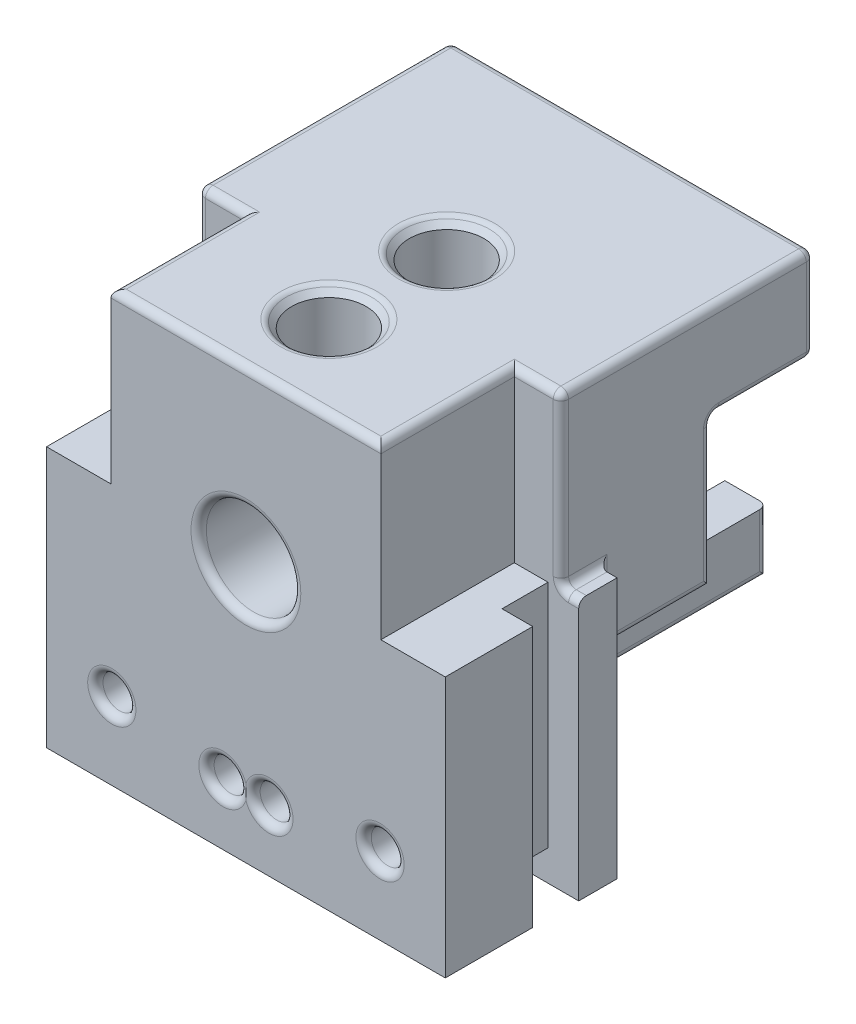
ISO-10303-21;
HEADER;
FILE_DESCRIPTION(('STEP AP214'),'2;1');
FILE_NAME('part.step','',(''),(''),'','','');
FILE_SCHEMA(('AUTOMOTIVE_DESIGN { 1 0 10303 214 1 1 1 1 }'));
ENDSEC;
DATA;
#1=APPLICATION_CONTEXT('core data for automotive mechanical design processes');
#2=APPLICATION_PROTOCOL_DEFINITION('international standard','automotive_design',2000,#1);
#3=PRODUCT_CONTEXT('',#1,'mechanical');
#4=PRODUCT('Part','Part','',(#3));
#5=PRODUCT_RELATED_PRODUCT_CATEGORY('part','',(#4));
#6=PRODUCT_DEFINITION_FORMATION('','',#4);
#7=PRODUCT_DEFINITION_CONTEXT('part definition',#1,'design');
#8=PRODUCT_DEFINITION('design','',#6,#7);
#9=PRODUCT_DEFINITION_SHAPE('','',#8);
#10=(LENGTH_UNIT() NAMED_UNIT(*) SI_UNIT(.MILLI.,.METRE.));
#11=(NAMED_UNIT(*) PLANE_ANGLE_UNIT() SI_UNIT($,.RADIAN.));
#12=(NAMED_UNIT(*) SI_UNIT($,.STERADIAN.) SOLID_ANGLE_UNIT());
#13=UNCERTAINTY_MEASURE_WITH_UNIT(LENGTH_MEASURE(1.E-05),#10,'distance_accuracy_value','');
#14=(GEOMETRIC_REPRESENTATION_CONTEXT(3) GLOBAL_UNCERTAINTY_ASSIGNED_CONTEXT((#13)) GLOBAL_UNIT_ASSIGNED_CONTEXT((#10,
#11,#12)) REPRESENTATION_CONTEXT('',''));
#15=CARTESIAN_POINT('',(0.,0.,0.));
#16=DIRECTION('',(0.,0.,1.));
#17=DIRECTION('',(1.,0.,0.));
#18=AXIS2_PLACEMENT_3D('',#15,#16,#17);
#19=CARTESIAN_POINT('',(0.,13.49375,0.));
#20=DIRECTION('',(0.,-1.,0.));
#21=DIRECTION('',(0.,0.,-1.));
#22=AXIS2_PLACEMENT_3D('',#19,#20,#21);
#23=PLANE('',#22);
#24=DIRECTION('',(0.,0.,1.));
#25=VECTOR('',#24,1.);
#26=CARTESIAN_POINT('',(-6.98500000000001,13.49375,-3.175));
#27=LINE('',#26,#25);
#28=CARTESIAN_POINT('',(-6.98500000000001,13.49375,-1.190625));
#29=VERTEX_POINT('',#28);
#30=CARTESIAN_POINT('',(-6.98500000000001,13.49375,5.715));
#31=VERTEX_POINT('',#30);
#32=EDGE_CURVE('E617',#29,#31,#27,.T.);
#33=ORIENTED_EDGE('',*,*,#32,.F.);
#34=DIRECTION('',(-1.,0.,0.));
#35=VECTOR('',#34,1.);
#36=CARTESIAN_POINT('',(-6.98500000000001,13.49375,-1.190625));
#37=LINE('',#36,#35);
#38=CARTESIAN_POINT('',(-8.73124999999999,13.49375,-1.190625));
#39=VERTEX_POINT('',#38);
#40=EDGE_CURVE('E1393',#29,#39,#37,.T.);
#41=ORIENTED_EDGE('',*,*,#40,.T.);
#42=DIRECTION('',(0.,0.,-1.));
#43=VECTOR('',#42,1.);
#44=CARTESIAN_POINT('',(-8.73124999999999,13.49375,-1.190625));
#45=LINE('',#44,#43);
#46=CARTESIAN_POINT('',(-8.73124999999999,13.49375,1.190625));
#47=VERTEX_POINT('',#46);
#48=EDGE_CURVE('E1417',#47,#39,#45,.T.);
#49=ORIENTED_EDGE('',*,*,#48,.F.);
#50=DIRECTION('',(1.,0.,0.));
#51=VECTOR('',#50,1.);
#52=CARTESIAN_POINT('',(10.31875,13.49375,1.190625));
#53=LINE('',#52,#51);
#54=CARTESIAN_POINT('',(-10.31875,13.49375,1.19062500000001));
#55=VERTEX_POINT('',#54);
#56=EDGE_CURVE('E786',#55,#47,#53,.T.);
#57=ORIENTED_EDGE('',*,*,#56,.F.);
#58=DIRECTION('',(0.,0.,-1.));
#59=VECTOR('',#58,1.);
#60=CARTESIAN_POINT('',(-10.31875,13.49375,-3.175));
#61=LINE('',#60,#59);
#62=CARTESIAN_POINT('',(-10.31875,13.49375,5.715));
#63=VERTEX_POINT('',#62);
#64=EDGE_CURVE('E1121',#63,#55,#61,.T.);
#65=ORIENTED_EDGE('',*,*,#64,.F.);
#66=DIRECTION('',(-1.,0.,0.));
#67=VECTOR('',#66,1.);
#68=CARTESIAN_POINT('',(-10.31875,13.49375,5.715));
#69=LINE('',#68,#67);
#70=EDGE_CURVE('E1122',#31,#63,#69,.T.);
#71=ORIENTED_EDGE('',*,*,#70,.F.);
#72=EDGE_LOOP('',(#33,#41,#49,#57,#65,#71));
#73=FACE_BOUND('',#72,.T.);
#74=ADVANCED_FACE('F36',(#73),#23,.F.);
#75=CARTESIAN_POINT('',(6.985,13.49375,-14.2875));
#76=DIRECTION('',(1.,0.,0.));
#77=DIRECTION('',(0.,1.,0.));
#78=AXIS2_PLACEMENT_3D('',#75,#76,#77);
#79=PLANE('',#78);
#80=DIRECTION('',(0.,-1.,0.));
#81=VECTOR('',#80,1.);
#82=CARTESIAN_POINT('',(6.985,25.3491499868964,-1.190625));
#83=LINE('',#82,#81);
#84=CARTESIAN_POINT('',(6.985,21.828125,-1.190625));
#85=VERTEX_POINT('',#84);
#86=CARTESIAN_POINT('',(6.985,13.49375,-1.190625));
#87=VERTEX_POINT('',#86);
#88=EDGE_CURVE('E585',#85,#87,#83,.T.);
#89=ORIENTED_EDGE('',*,*,#88,.F.);
#90=DIRECTION('',(0.,0.,-1.));
#91=VECTOR('',#90,1.);
#92=CARTESIAN_POINT('',(6.985,21.828125,-14.2875));
#93=LINE('',#92,#91);
#94=CARTESIAN_POINT('',(6.985,21.828125,5.715));
#95=VERTEX_POINT('',#94);
#96=EDGE_CURVE('E1517',#85,#95,#93,.F.);
#97=ORIENTED_EDGE('',*,*,#96,.T.);
#98=DIRECTION('',(0.,1.,0.));
#99=VECTOR('',#98,1.);
#100=CARTESIAN_POINT('',(6.985,3.99922583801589,5.715));
#101=LINE('',#100,#99);
#102=CARTESIAN_POINT('',(6.985,13.49375,5.715));
#103=VERTEX_POINT('',#102);
#104=EDGE_CURVE('E610',#103,#95,#101,.T.);
#105=ORIENTED_EDGE('',*,*,#104,.F.);
#106=DIRECTION('',(0.,0.,1.));
#107=VECTOR('',#106,1.);
#108=CARTESIAN_POINT('',(6.985,13.49375,-3.175));
#109=LINE('',#108,#107);
#110=EDGE_CURVE('E601',#87,#103,#109,.T.);
#111=ORIENTED_EDGE('',*,*,#110,.F.);
#112=EDGE_LOOP('',(#89,#97,#105,#111));
#113=FACE_BOUND('',#112,.T.);
#114=ADVANCED_FACE('F608',(#113),#79,.T.);
#115=CARTESIAN_POINT('',(0.,13.49375,0.));
#116=DIRECTION('',(0.,-1.,0.));
#117=DIRECTION('',(0.,0.,-1.));
#118=AXIS2_PLACEMENT_3D('',#115,#116,#117);
#119=PLANE('',#118);
#120=DIRECTION('',(1.,0.,0.));
#121=VECTOR('',#120,1.);
#122=CARTESIAN_POINT('',(6.985,13.49375,-1.190625));
#123=LINE('',#122,#121);
#124=CARTESIAN_POINT('',(8.73124999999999,13.49375,-1.190625));
#125=VERTEX_POINT('',#124);
#126=EDGE_CURVE('E590',#87,#125,#123,.T.);
#127=ORIENTED_EDGE('',*,*,#126,.F.);
#128=ORIENTED_EDGE('',*,*,#110,.T.);
#129=DIRECTION('',(1.,0.,0.));
#130=VECTOR('',#129,1.);
#131=CARTESIAN_POINT('',(10.31875,13.49375,5.715));
#132=LINE('',#131,#130);
#133=CARTESIAN_POINT('',(10.31875,13.49375,5.715));
#134=VERTEX_POINT('',#133);
#135=EDGE_CURVE('E614',#103,#134,#132,.T.);
#136=ORIENTED_EDGE('',*,*,#135,.T.);
#137=DIRECTION('',(0.,0.,-1.));
#138=VECTOR('',#137,1.);
#139=CARTESIAN_POINT('',(10.31875,13.49375,-3.175));
#140=LINE('',#139,#138);
#141=CARTESIAN_POINT('',(10.31875,13.49375,1.190625));
#142=VERTEX_POINT('',#141);
#143=EDGE_CURVE('E625',#134,#142,#140,.T.);
#144=ORIENTED_EDGE('',*,*,#143,.T.);
#145=CARTESIAN_POINT('',(8.73124999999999,13.49375,1.190625));
#146=VERTEX_POINT('',#145);
#147=EDGE_CURVE('E781',#146,#142,#53,.T.);
#148=ORIENTED_EDGE('',*,*,#147,.F.);
#149=DIRECTION('',(0.,0.,-1.));
#150=VECTOR('',#149,1.);
#151=CARTESIAN_POINT('',(8.73124999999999,13.49375,-1.190625));
#152=LINE('',#151,#150);
#153=EDGE_CURVE('E604',#146,#125,#152,.T.);
#154=ORIENTED_EDGE('',*,*,#153,.T.);
#155=EDGE_LOOP('',(#127,#128,#136,#144,#148,#154));
#156=FACE_BOUND('',#155,.T.);
#157=ADVANCED_FACE('F600',(#156),#119,.F.);
#158=DIRECTION('',(0.,0.,-1.));
#159=VECTOR('',#158,1.);
#160=CARTESIAN_POINT('',(9.794875,13.49375,-1.190625));
#161=LINE('',#160,#159);
#162=CARTESIAN_POINT('',(9.794875,13.49375,-3.175));
#163=VERTEX_POINT('',#162);
#164=CARTESIAN_POINT('',(9.794875,13.49375,-1.5875));
#165=VERTEX_POINT('',#164);
#166=EDGE_CURVE('E1866',#163,#165,#161,.F.);
#167=ORIENTED_EDGE('',*,*,#166,.T.);
#168=DIRECTION('',(1.,0.,0.));
#169=VECTOR('',#168,1.);
#170=CARTESIAN_POINT('',(0.,13.49375,-1.5875));
#171=LINE('',#170,#169);
#172=CARTESIAN_POINT('',(10.31875,13.49375,-1.5875));
#173=VERTEX_POINT('',#172);
#174=EDGE_CURVE('E1868',#165,#173,#171,.T.);
#175=ORIENTED_EDGE('',*,*,#174,.T.);
#176=CARTESIAN_POINT('',(10.31875,13.49375,-3.175));
#177=VERTEX_POINT('',#176);
#178=EDGE_CURVE('E1660',#173,#177,#140,.T.);
#179=ORIENTED_EDGE('',*,*,#178,.T.);
#180=DIRECTION('',(-1.,0.,0.));
#181=VECTOR('',#180,1.);
#182=CARTESIAN_POINT('',(10.31875,13.49375,-3.175));
#183=LINE('',#182,#181);
#184=EDGE_CURVE('E612',#177,#163,#183,.T.);
#185=ORIENTED_EDGE('',*,*,#184,.T.);
#186=EDGE_LOOP('',(#167,#175,#179,#185));
#187=FACE_BOUND('',#186,.T.);
#188=ADVANCED_FACE('F967',(#187),#119,.F.);
#189=CARTESIAN_POINT('',(10.31875,22.225,-8.969375));
#190=DIRECTION('',(0.,0.,1.));
#191=DIRECTION('',(1.,0.,0.));
#192=AXIS2_PLACEMENT_3D('',#189,#190,#191);
#193=PLANE('',#192);
#194=CARTESIAN_POINT('',(0.,13.49375,-8.969375));
#195=DIRECTION('',(0.,0.,1.));
#196=DIRECTION('',(1.,0.,0.));
#197=AXIS2_PLACEMENT_3D('',#194,#195,#196);
#198=CIRCLE('',#197,2.841625);
#199=CARTESIAN_POINT('',(2.841625,13.49375,-8.969375));
#200=VERTEX_POINT('',#199);
#201=EDGE_CURVE('E837',#200,#200,#198,.T.);
#202=ORIENTED_EDGE('',*,*,#201,.T.);
#203=EDGE_LOOP('',(#202));
#204=FACE_BOUND('',#203,.T.);
#205=DIRECTION('',(-1.,0.,0.));
#206=VECTOR('',#205,1.);
#207=CARTESIAN_POINT('',(9.398,17.002125,-8.969375));
#208=LINE('',#207,#206);
#209=CARTESIAN_POINT('',(7.94579695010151,17.002125,-8.969375));
#210=VERTEX_POINT('',#209);
#211=CARTESIAN_POINT('',(9.001125,17.002125,-8.969375));
#212=VERTEX_POINT('',#211);
#213=EDGE_CURVE('E1180',#210,#212,#208,.F.);
#214=ORIENTED_EDGE('',*,*,#213,.T.);
#215=DIRECTION('',(0.,1.,0.));
#216=VECTOR('',#215,1.);
#217=CARTESIAN_POINT('',(9.001125,22.225,-8.969375));
#218=LINE('',#217,#216);
#219=CARTESIAN_POINT('',(9.001125,9.779,-8.969375));
#220=VERTEX_POINT('',#219);
#221=EDGE_CURVE('E1182',#212,#220,#218,.F.);
#222=ORIENTED_EDGE('',*,*,#221,.T.);
#223=DIRECTION('',(-1.,0.,0.));
#224=VECTOR('',#223,1.);
#225=CARTESIAN_POINT('',(9.398,9.779,-8.969375));
#226=LINE('',#225,#224);
#227=CARTESIAN_POINT('',(6.985,9.779,-8.969375));
#228=VERTEX_POINT('',#227);
#229=EDGE_CURVE('E1647',#220,#228,#226,.T.);
#230=ORIENTED_EDGE('',*,*,#229,.T.);
#231=DIRECTION('',(0.,1.,0.));
#232=VECTOR('',#231,1.);
#233=CARTESIAN_POINT('',(6.985,9.525,-8.969375));
#234=LINE('',#233,#232);
#235=CARTESIAN_POINT('',(6.985,9.525,-8.969375));
#236=VERTEX_POINT('',#235);
#237=EDGE_CURVE('E778',#236,#228,#234,.T.);
#238=ORIENTED_EDGE('',*,*,#237,.F.);
#239=DIRECTION('',(1.,0.,0.));
#240=VECTOR('',#239,1.);
#241=CARTESIAN_POINT('',(-6.985,9.525,-8.969375));
#242=LINE('',#241,#240);
#243=CARTESIAN_POINT('',(-6.985,9.525,-8.969375));
#244=VERTEX_POINT('',#243);
#245=EDGE_CURVE('E766',#244,#236,#242,.T.);
#246=ORIENTED_EDGE('',*,*,#245,.F.);
#247=DIRECTION('',(0.,1.,0.));
#248=VECTOR('',#247,1.);
#249=CARTESIAN_POINT('',(-6.985,9.525,-8.969375));
#250=LINE('',#249,#248);
#251=CARTESIAN_POINT('',(-6.985,9.779,-8.969375));
#252=VERTEX_POINT('',#251);
#253=EDGE_CURVE('E775',#244,#252,#250,.T.);
#254=ORIENTED_EDGE('',*,*,#253,.T.);
#255=DIRECTION('',(1.,0.,0.));
#256=VECTOR('',#255,1.);
#257=CARTESIAN_POINT('',(-9.39800000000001,9.77899999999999,-8.969375));
#258=LINE('',#257,#256);
#259=CARTESIAN_POINT('',(-9.00112500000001,9.77899999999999,-8.969375));
#260=VERTEX_POINT('',#259);
#261=EDGE_CURVE('E1653',#260,#252,#258,.T.);
#262=ORIENTED_EDGE('',*,*,#261,.F.);
#263=DIRECTION('',(0.,1.,0.));
#264=VECTOR('',#263,1.);
#265=CARTESIAN_POINT('',(-9.00112500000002,22.225,-8.969375));
#266=LINE('',#265,#264);
#267=CARTESIAN_POINT('',(-9.00112500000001,17.002125,-8.969375));
#268=VERTEX_POINT('',#267);
#269=EDGE_CURVE('E1168',#260,#268,#266,.T.);
#270=ORIENTED_EDGE('',*,*,#269,.T.);
#271=DIRECTION('',(-1.,0.,0.));
#272=VECTOR('',#271,1.);
#273=CARTESIAN_POINT('',(-7.81050000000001,17.002125,-8.969375));
#274=LINE('',#273,#272);
#275=CARTESIAN_POINT('',(-7.94579695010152,17.002125,-8.969375));
#276=VERTEX_POINT('',#275);
#277=EDGE_CURVE('E1170',#268,#276,#274,.F.);
#278=ORIENTED_EDGE('',*,*,#277,.T.);
#279=CARTESIAN_POINT('',(-7.94579695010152,17.795875,-8.969375));
#280=DIRECTION('',(0.,0.,1.));
#281=DIRECTION('',(1.,0.,0.));
#282=AXIS2_PLACEMENT_3D('',#279,#280,#281);
#283=CIRCLE('',#282,0.79375);
#284=CARTESIAN_POINT('',(-7.46423349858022,17.1648950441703,-8.969375));
#285=VERTEX_POINT('',#284);
#286=EDGE_CURVE('E1172',#285,#276,#283,.F.);
#287=ORIENTED_EDGE('',*,*,#286,.F.);
#288=CARTESIAN_POINT('',(0.,7.38470572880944,-8.969375));
#289=DIRECTION('',(0.,0.,1.));
#290=DIRECTION('',(1.,0.,0.));
#291=AXIS2_PLACEMENT_3D('',#288,#289,#290);
#292=CIRCLE('',#291,12.303125);
#293=CARTESIAN_POINT('',(7.46423349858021,17.1648950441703,-8.969375));
#294=VERTEX_POINT('',#293);
#295=EDGE_CURVE('E1175',#285,#294,#292,.F.);
#296=ORIENTED_EDGE('',*,*,#295,.T.);
#297=CARTESIAN_POINT('',(7.94579695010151,17.795875,-8.969375));
#298=DIRECTION('',(0.,0.,1.));
#299=DIRECTION('',(1.,0.,0.));
#300=AXIS2_PLACEMENT_3D('',#297,#298,#299);
#301=CIRCLE('',#300,0.79375);
#302=EDGE_CURVE('E1177',#210,#294,#301,.F.);
#303=ORIENTED_EDGE('',*,*,#302,.F.);
#304=EDGE_LOOP('',(#214,#222,#230,#238,#246,#254,#262,#270,#278,#287,#296,#303));
#305=FACE_BOUND('',#304,.T.);
#306=ADVANCED_FACE('F963',(#204,#305),#193,.F.);
#307=CARTESIAN_POINT('',(-6.985,13.49375,-14.2875));
#308=DIRECTION('',(-1.,0.,0.));
#309=DIRECTION('',(0.,-1.,0.));
#310=AXIS2_PLACEMENT_3D('',#307,#308,#309);
#311=PLANE('',#310);
#312=DIRECTION('',(0.,-1.,0.));
#313=VECTOR('',#312,1.);
#314=CARTESIAN_POINT('',(-6.985,13.49375,-3.175));
#315=LINE('',#314,#313);
#316=CARTESIAN_POINT('',(-6.985,9.382125,-3.175));
#317=VERTEX_POINT('',#316);
#318=CARTESIAN_POINT('',(-6.985,6.746875,-3.175));
#319=VERTEX_POINT('',#318);
#320=EDGE_CURVE('E799',#317,#319,#315,.T.);
#321=ORIENTED_EDGE('',*,*,#320,.F.);
#322=CARTESIAN_POINT('',(-6.985,9.382125,-3.571875));
#323=DIRECTION('',(-1.,0.,0.));
#324=DIRECTION('',(0.,-1.,0.));
#325=AXIS2_PLACEMENT_3D('',#322,#323,#324);
#326=CIRCLE('',#325,0.396875);
#327=CARTESIAN_POINT('',(-6.98500000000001,9.779,-3.571875));
#328=VERTEX_POINT('',#327);
#329=EDGE_CURVE('E1132',#317,#328,#326,.T.);
#330=ORIENTED_EDGE('',*,*,#329,.T.);
#331=DIRECTION('',(0.,0.,-1.));
#332=VECTOR('',#331,1.);
#333=CARTESIAN_POINT('',(-6.98500000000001,9.779,-8.969375));
#334=LINE('',#333,#332);
#335=EDGE_CURVE('E1055',#328,#252,#334,.T.);
#336=ORIENTED_EDGE('',*,*,#335,.T.);
#337=ORIENTED_EDGE('',*,*,#253,.F.);
#338=DIRECTION('',(0.,0.,1.));
#339=VECTOR('',#338,1.);
#340=CARTESIAN_POINT('',(-6.985,9.525,-14.2875));
#341=LINE('',#340,#339);
#342=CARTESIAN_POINT('',(-6.985,9.525,-13.890625));
#343=VERTEX_POINT('',#342);
#344=EDGE_CURVE('E764',#343,#244,#341,.T.);
#345=ORIENTED_EDGE('',*,*,#344,.F.);
#346=DIRECTION('',(0.,-1.,0.));
#347=VECTOR('',#346,1.);
#348=CARTESIAN_POINT('',(-6.985,6.35,-13.890625));
#349=LINE('',#348,#347);
#350=CARTESIAN_POINT('',(-6.985,6.746875,-13.890625));
#351=VERTEX_POINT('',#350);
#352=EDGE_CURVE('E840',#343,#351,#349,.T.);
#353=ORIENTED_EDGE('',*,*,#352,.T.);
#354=DIRECTION('',(0.,0.,1.));
#355=VECTOR('',#354,1.);
#356=CARTESIAN_POINT('',(-6.985,6.746875,-14.2875));
#357=LINE('',#356,#355);
#358=EDGE_CURVE('E842',#351,#319,#357,.T.);
#359=ORIENTED_EDGE('',*,*,#358,.T.);
#360=EDGE_LOOP('',(#321,#330,#336,#337,#345,#353,#359));
#361=FACE_BOUND('',#360,.T.);
#362=ADVANCED_FACE('F966',(#361),#311,.T.);
#363=CARTESIAN_POINT('',(-10.31875,13.49375,-3.175));
#364=DIRECTION('',(0.,0.,1.));
#365=DIRECTION('',(1.,0.,0.));
#366=AXIS2_PLACEMENT_3D('',#363,#364,#365);
#367=PLANE('',#366);
#368=CARTESIAN_POINT('',(-6.94107576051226,4.00037901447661,-3.175));
#369=DIRECTION('',(0.,0.,1.));
#370=DIRECTION('',(1.,0.,0.));
#371=AXIS2_PLACEMENT_3D('',#368,#369,#370);
#372=CIRCLE('',#371,1.247775);
#373=CARTESIAN_POINT('',(-5.69330076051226,4.00037901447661,-3.175));
#374=VERTEX_POINT('',#373);
#375=EDGE_CURVE('E828',#374,#374,#372,.T.);
#376=ORIENTED_EDGE('',*,*,#375,.T.);
#377=EDGE_LOOP('',(#376));
#378=FACE_BOUND('',#377,.T.);
#379=CARTESIAN_POINT('',(1.190625,3.175,-3.175));
#380=DIRECTION('',(0.,0.,1.));
#381=DIRECTION('',(1.,0.,0.));
#382=AXIS2_PLACEMENT_3D('',#379,#380,#381);
#383=CIRCLE('',#382,1.247775);
#384=CARTESIAN_POINT('',(2.4384,3.175,-3.175));
#385=VERTEX_POINT('',#384);
#386=CARTESIAN_POINT('',(0.,3.54830223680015,-3.175));
#387=VERTEX_POINT('',#386);
#388=EDGE_CURVE('E821',#385,#387,#383,.T.);
#389=ORIENTED_EDGE('',*,*,#388,.T.);
#390=CARTESIAN_POINT('',(-1.190625,3.175,-3.175));
#391=DIRECTION('',(0.,0.,1.));
#392=DIRECTION('',(1.,0.,0.));
#393=AXIS2_PLACEMENT_3D('',#390,#391,#392);
#394=CIRCLE('',#393,1.247775);
#395=CARTESIAN_POINT('',(0.,2.80169776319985,-3.175));
#396=VERTEX_POINT('',#395);
#397=EDGE_CURVE('E825',#387,#396,#394,.T.);
#398=ORIENTED_EDGE('',*,*,#397,.T.);
#399=CARTESIAN_POINT('',(1.190625,3.175,-3.175));
#400=DIRECTION('',(0.,0.,1.));
#401=DIRECTION('',(1.,0.,0.));
#402=AXIS2_PLACEMENT_3D('',#399,#400,#401);
#403=CIRCLE('',#402,1.247775);
#404=EDGE_CURVE('E823',#396,#385,#403,.T.);
#405=ORIENTED_EDGE('',*,*,#404,.T.);
#406=EDGE_LOOP('',(#389,#398,#405));
#407=FACE_BOUND('',#406,.T.);
#408=CARTESIAN_POINT('',(6.94107576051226,4.00037901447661,-3.175));
#409=DIRECTION('',(0.,0.,1.));
#410=DIRECTION('',(1.,0.,0.));
#411=AXIS2_PLACEMENT_3D('',#408,#409,#410);
#412=CIRCLE('',#411,1.247775);
#413=CARTESIAN_POINT('',(8.18885076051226,4.00037901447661,-3.175));
#414=VERTEX_POINT('',#413);
#415=EDGE_CURVE('E818',#414,#414,#412,.T.);
#416=ORIENTED_EDGE('',*,*,#415,.T.);
#417=EDGE_LOOP('',(#416));
#418=FACE_BOUND('',#417,.T.);
#419=DIRECTION('',(0.,1.,0.));
#420=VECTOR('',#419,1.);
#421=CARTESIAN_POINT('',(6.985,13.49375,-3.175));
#422=LINE('',#421,#420);
#423=CARTESIAN_POINT('',(6.985,6.746875,-3.175));
#424=VERTEX_POINT('',#423);
#425=CARTESIAN_POINT('',(6.985,9.382125,-3.175));
#426=VERTEX_POINT('',#425);
#427=EDGE_CURVE('E808',#424,#426,#422,.T.);
#428=ORIENTED_EDGE('',*,*,#427,.T.);
#429=DIRECTION('',(-1.,0.,0.));
#430=VECTOR('',#429,1.);
#431=CARTESIAN_POINT('',(9.398,9.382125,-3.175));
#432=LINE('',#431,#430);
#433=CARTESIAN_POINT('',(9.001125,9.382125,-3.175));
#434=VERTEX_POINT('',#433);
#435=EDGE_CURVE('E1864',#426,#434,#432,.F.);
#436=ORIENTED_EDGE('',*,*,#435,.T.);
#437=CARTESIAN_POINT('',(9.001125,10.175875,-3.175));
#438=DIRECTION('',(0.,0.,1.));
#439=DIRECTION('',(1.,0.,0.));
#440=AXIS2_PLACEMENT_3D('',#437,#438,#439);
#441=CIRCLE('',#440,0.79375);
#442=CARTESIAN_POINT('',(9.794875,10.175875,-3.175));
#443=VERTEX_POINT('',#442);
#444=EDGE_CURVE('E1861',#443,#434,#441,.F.);
#445=ORIENTED_EDGE('',*,*,#444,.F.);
#446=DIRECTION('',(0.,-1.,0.));
#447=VECTOR('',#446,1.);
#448=CARTESIAN_POINT('',(9.794875,13.49375,-3.175));
#449=LINE('',#448,#447);
#450=EDGE_CURVE('E1857',#443,#163,#449,.F.);
#451=ORIENTED_EDGE('',*,*,#450,.T.);
#452=ORIENTED_EDGE('',*,*,#184,.F.);
#453=DIRECTION('',(0.,-1.,0.));
#454=VECTOR('',#453,1.);
#455=CARTESIAN_POINT('',(10.31875,13.49375,-3.175));
#456=LINE('',#455,#454);
#457=CARTESIAN_POINT('',(10.31875,0.,-3.175));
#458=VERTEX_POINT('',#457);
#459=EDGE_CURVE('E1408',#177,#458,#456,.T.);
#460=ORIENTED_EDGE('',*,*,#459,.T.);
#461=DIRECTION('',(-1.,0.,0.));
#462=VECTOR('',#461,1.);
#463=CARTESIAN_POINT('',(-10.31875,0.,-3.175));
#464=LINE('',#463,#462);
#465=CARTESIAN_POINT('',(-10.31875,0.,-3.175));
#466=VERTEX_POINT('',#465);
#467=EDGE_CURVE('E1677',#458,#466,#464,.T.);
#468=ORIENTED_EDGE('',*,*,#467,.T.);
#469=DIRECTION('',(0.,-1.,0.));
#470=VECTOR('',#469,1.);
#471=CARTESIAN_POINT('',(-10.31875,13.49375,-3.175));
#472=LINE('',#471,#470);
#473=CARTESIAN_POINT('',(-10.31875,13.49375,-3.175));
#474=VERTEX_POINT('',#473);
#475=EDGE_CURVE('E1688',#474,#466,#472,.T.);
#476=ORIENTED_EDGE('',*,*,#475,.F.);
#477=DIRECTION('',(1.,0.,0.));
#478=VECTOR('',#477,1.);
#479=CARTESIAN_POINT('',(-10.31875,13.49375,-3.175));
#480=LINE('',#479,#478);
#481=CARTESIAN_POINT('',(-9.79487500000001,13.49375,-3.175));
#482=VERTEX_POINT('',#481);
#483=EDGE_CURVE('E1119',#474,#482,#480,.T.);
#484=ORIENTED_EDGE('',*,*,#483,.T.);
#485=DIRECTION('',(0.,-1.,0.));
#486=VECTOR('',#485,1.);
#487=CARTESIAN_POINT('',(-9.79487500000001,9.77899999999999,-3.175));
#488=LINE('',#487,#486);
#489=CARTESIAN_POINT('',(-9.79487500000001,10.175875,-3.175));
#490=VERTEX_POINT('',#489);
#491=EDGE_CURVE('E1855',#482,#490,#488,.T.);
#492=ORIENTED_EDGE('',*,*,#491,.T.);
#493=CARTESIAN_POINT('',(-9.00112500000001,10.175875,-3.175));
#494=DIRECTION('',(0.,0.,1.));
#495=DIRECTION('',(1.,0.,0.));
#496=AXIS2_PLACEMENT_3D('',#493,#494,#495);
#497=CIRCLE('',#496,0.79375);
#498=CARTESIAN_POINT('',(-9.00112500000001,9.382125,-3.175));
#499=VERTEX_POINT('',#498);
#500=EDGE_CURVE('E1401',#499,#490,#497,.F.);
#501=ORIENTED_EDGE('',*,*,#500,.F.);
#502=DIRECTION('',(1.,0.,0.));
#503=VECTOR('',#502,1.);
#504=CARTESIAN_POINT('',(-10.31875,9.38212499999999,-3.175));
#505=LINE('',#504,#503);
#506=EDGE_CURVE('E1856',#499,#317,#505,.T.);
#507=ORIENTED_EDGE('',*,*,#506,.T.);
#508=ORIENTED_EDGE('',*,*,#320,.T.);
#509=CARTESIAN_POINT('',(-6.588125,6.746875,-3.175));
#510=DIRECTION('',(0.,0.,1.));
#511=DIRECTION('',(1.,0.,0.));
#512=AXIS2_PLACEMENT_3D('',#509,#510,#511);
#513=CIRCLE('',#512,0.396875);
#514=CARTESIAN_POINT('',(-6.588125,6.35,-3.175));
#515=VERTEX_POINT('',#514);
#516=EDGE_CURVE('E894',#319,#515,#513,.T.);
#517=ORIENTED_EDGE('',*,*,#516,.T.);
#518=DIRECTION('',(1.,0.,0.));
#519=VECTOR('',#518,1.);
#520=CARTESIAN_POINT('',(-6.985,6.35,-3.175));
#521=LINE('',#520,#519);
#522=CARTESIAN_POINT('',(6.588125,6.35,-3.175));
#523=VERTEX_POINT('',#522);
#524=EDGE_CURVE('E805',#515,#523,#521,.T.);
#525=ORIENTED_EDGE('',*,*,#524,.T.);
#526=CARTESIAN_POINT('',(6.588125,6.746875,-3.175));
#527=DIRECTION('',(0.,0.,1.));
#528=DIRECTION('',(1.,0.,0.));
#529=AXIS2_PLACEMENT_3D('',#526,#527,#528);
#530=CIRCLE('',#529,0.396875);
#531=EDGE_CURVE('E1057',#523,#424,#530,.T.);
#532=ORIENTED_EDGE('',*,*,#531,.T.);
#533=EDGE_LOOP('',(#428,#436,#445,#451,#452,#460,#468,#476,#484,#492,#501,#507,#508,#517,#525,#532));
#534=FACE_BOUND('',#533,.T.);
#535=ADVANCED_FACE('F1029',(#378,#407,#418,#534),#367,.F.);
#536=DIRECTION('',(0.,0.,-1.));
#537=VECTOR('',#536,1.);
#538=CARTESIAN_POINT('',(6.985,9.779,-8.969375));
#539=LINE('',#538,#537);
#540=CARTESIAN_POINT('',(6.985,9.779,-3.571875));
#541=VERTEX_POINT('',#540);
#542=EDGE_CURVE('E1648',#541,#228,#539,.T.);
#543=ORIENTED_EDGE('',*,*,#542,.F.);
#544=CARTESIAN_POINT('',(6.985,9.382125,-3.571875));
#545=DIRECTION('',(1.,0.,0.));
#546=DIRECTION('',(0.,1.,0.));
#547=AXIS2_PLACEMENT_3D('',#544,#545,#546);
#548=CIRCLE('',#547,0.396875);
#549=EDGE_CURVE('E1399',#541,#426,#548,.T.);
#550=ORIENTED_EDGE('',*,*,#549,.T.);
#551=ORIENTED_EDGE('',*,*,#427,.F.);
#552=DIRECTION('',(0.,0.,1.));
#553=VECTOR('',#552,1.);
#554=CARTESIAN_POINT('',(6.985,6.746875,-14.2875));
#555=LINE('',#554,#553);
#556=CARTESIAN_POINT('',(6.985,6.746875,-13.890625));
#557=VERTEX_POINT('',#556);
#558=EDGE_CURVE('E1927',#424,#557,#555,.F.);
#559=ORIENTED_EDGE('',*,*,#558,.T.);
#560=DIRECTION('',(0.,1.,0.));
#561=VECTOR('',#560,1.);
#562=CARTESIAN_POINT('',(6.985,9.525,-13.890625));
#563=LINE('',#562,#561);
#564=CARTESIAN_POINT('',(6.985,9.525,-13.890625));
#565=VERTEX_POINT('',#564);
#566=EDGE_CURVE('E1931',#557,#565,#563,.T.);
#567=ORIENTED_EDGE('',*,*,#566,.T.);
#568=DIRECTION('',(0.,0.,-1.));
#569=VECTOR('',#568,1.);
#570=CARTESIAN_POINT('',(6.985,9.525,-14.2875));
#571=LINE('',#570,#569);
#572=EDGE_CURVE('E768',#236,#565,#571,.T.);
#573=ORIENTED_EDGE('',*,*,#572,.F.);
#574=ORIENTED_EDGE('',*,*,#237,.T.);
#575=EDGE_LOOP('',(#543,#550,#551,#559,#567,#573,#574));
#576=FACE_BOUND('',#575,.T.);
#577=ADVANCED_FACE('F987',(#576),#79,.T.);
#578=CARTESIAN_POINT('',(-10.31875,13.49375,-3.175));
#579=DIRECTION('',(1.,0.,0.));
#580=DIRECTION('',(0.,0.,-1.));
#581=AXIS2_PLACEMENT_3D('',#578,#579,#580);
#582=PLANE('',#581);
#583=DIRECTION('',(0.,-1.,0.));
#584=VECTOR('',#583,1.);
#585=CARTESIAN_POINT('',(-10.31875,0.,5.715));
#586=LINE('',#585,#584);
#587=CARTESIAN_POINT('',(-10.31875,0.,5.715));
#588=VERTEX_POINT('',#587);
#589=EDGE_CURVE('E791',#63,#588,#586,.T.);
#590=ORIENTED_EDGE('',*,*,#589,.F.);
#591=ORIENTED_EDGE('',*,*,#64,.T.);
#592=DIRECTION('',(0.,1.,0.));
#593=VECTOR('',#592,1.);
#594=CARTESIAN_POINT('',(-10.31875,0.,1.190625));
#595=LINE('',#594,#593);
#596=CARTESIAN_POINT('',(-10.31875,0.,1.190625));
#597=VERTEX_POINT('',#596);
#598=EDGE_CURVE('E1414',#597,#55,#595,.T.);
#599=ORIENTED_EDGE('',*,*,#598,.F.);
#600=DIRECTION('',(0.,0.,1.));
#601=VECTOR('',#600,1.);
#602=CARTESIAN_POINT('',(-10.31875,0.,-3.175));
#603=LINE('',#602,#601);
#604=EDGE_CURVE('E1674',#597,#588,#603,.T.);
#605=ORIENTED_EDGE('',*,*,#604,.T.);
#606=EDGE_LOOP('',(#590,#591,#599,#605));
#607=FACE_BOUND('',#606,.T.);
#608=ADVANCED_FACE('F977',(#607),#582,.F.);
#609=CARTESIAN_POINT('',(0.,0.,5.715));
#610=DIRECTION('',(0.,0.,1.));
#611=DIRECTION('',(1.,0.,0.));
#612=AXIS2_PLACEMENT_3D('',#609,#610,#611);
#613=PLANE('',#612);
#614=CARTESIAN_POINT('',(6.94107576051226,4.00037901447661,5.715));
#615=DIRECTION('',(0.,0.,1.));
#616=DIRECTION('',(1.,0.,0.));
#617=AXIS2_PLACEMENT_3D('',#614,#615,#616);
#618=CIRCLE('',#617,1.247775);
#619=CARTESIAN_POINT('',(8.18885076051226,4.00037901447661,5.715));
#620=VERTEX_POINT('',#619);
#621=EDGE_CURVE('E1471',#620,#620,#618,.F.);
#622=ORIENTED_EDGE('',*,*,#621,.T.);
#623=EDGE_LOOP('',(#622));
#624=FACE_BOUND('',#623,.T.);
#625=CARTESIAN_POINT('',(-1.190625,3.175,5.715));
#626=DIRECTION('',(0.,0.,1.));
#627=DIRECTION('',(1.,0.,0.));
#628=AXIS2_PLACEMENT_3D('',#625,#626,#627);
#629=CIRCLE('',#628,1.247775);
#630=CARTESIAN_POINT('',(0.,2.80169776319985,5.715));
#631=VERTEX_POINT('',#630);
#632=CARTESIAN_POINT('',(0.,3.54830223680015,5.715));
#633=VERTEX_POINT('',#632);
#634=EDGE_CURVE('E1464',#631,#633,#629,.F.);
#635=ORIENTED_EDGE('',*,*,#634,.T.);
#636=CARTESIAN_POINT('',(1.190625,3.175,5.715));
#637=DIRECTION('',(0.,0.,1.));
#638=DIRECTION('',(1.,0.,0.));
#639=AXIS2_PLACEMENT_3D('',#636,#637,#638);
#640=CIRCLE('',#639,1.247775);
#641=CARTESIAN_POINT('',(2.4384,3.175,5.715));
#642=VERTEX_POINT('',#641);
#643=EDGE_CURVE('E1468',#633,#642,#640,.F.);
#644=ORIENTED_EDGE('',*,*,#643,.T.);
#645=CARTESIAN_POINT('',(1.190625,3.175,5.715));
#646=DIRECTION('',(0.,0.,1.));
#647=DIRECTION('',(1.,0.,0.));
#648=AXIS2_PLACEMENT_3D('',#645,#646,#647);
#649=CIRCLE('',#648,1.247775);
#650=EDGE_CURVE('E1466',#642,#631,#649,.F.);
#651=ORIENTED_EDGE('',*,*,#650,.T.);
#652=EDGE_LOOP('',(#635,#644,#651));
#653=FACE_BOUND('',#652,.T.);
#654=CARTESIAN_POINT('',(-6.94107576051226,4.00037901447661,5.715));
#655=DIRECTION('',(0.,0.,1.));
#656=DIRECTION('',(1.,0.,0.));
#657=AXIS2_PLACEMENT_3D('',#654,#655,#656);
#658=CIRCLE('',#657,1.247775);
#659=CARTESIAN_POINT('',(-5.69330076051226,4.00037901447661,5.715));
#660=VERTEX_POINT('',#659);
#661=EDGE_CURVE('E1461',#660,#660,#658,.F.);
#662=ORIENTED_EDGE('',*,*,#661,.T.);
#663=EDGE_LOOP('',(#662));
#664=FACE_BOUND('',#663,.T.);
#665=CARTESIAN_POINT('',(0.,13.49375,5.715));
#666=DIRECTION('',(0.,0.,1.));
#667=DIRECTION('',(1.,0.,0.));
#668=AXIS2_PLACEMENT_3D('',#665,#666,#667);
#669=CIRCLE('',#668,2.841625);
#670=CARTESIAN_POINT('',(2.841625,13.49375,5.715));
#671=VERTEX_POINT('',#670);
#672=EDGE_CURVE('E1458',#671,#671,#669,.F.);
#673=ORIENTED_EDGE('',*,*,#672,.T.);
#674=EDGE_LOOP('',(#673));
#675=FACE_BOUND('',#674,.T.);
#676=ORIENTED_EDGE('',*,*,#104,.T.);
#677=DIRECTION('',(1.,0.,0.));
#678=VECTOR('',#677,1.);
#679=CARTESIAN_POINT('',(0.,21.828125,5.715));
#680=LINE('',#679,#678);
#681=CARTESIAN_POINT('',(-6.98500000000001,21.828125,5.715));
#682=VERTEX_POINT('',#681);
#683=EDGE_CURVE('E1511',#95,#682,#680,.F.);
#684=ORIENTED_EDGE('',*,*,#683,.T.);
#685=DIRECTION('',(0.,1.,0.));
#686=VECTOR('',#685,1.);
#687=CARTESIAN_POINT('',(-6.985,3.99922583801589,5.715));
#688=LINE('',#687,#686);
#689=EDGE_CURVE('E1650',#31,#682,#688,.T.);
#690=ORIENTED_EDGE('',*,*,#689,.F.);
#691=ORIENTED_EDGE('',*,*,#70,.T.);
#692=ORIENTED_EDGE('',*,*,#589,.T.);
#693=DIRECTION('',(1.,0.,0.));
#694=VECTOR('',#693,1.);
#695=CARTESIAN_POINT('',(0.,0.,5.715));
#696=LINE('',#695,#694);
#697=CARTESIAN_POINT('',(10.31875,0.,5.715));
#698=VERTEX_POINT('',#697);
#699=EDGE_CURVE('E793',#588,#698,#696,.T.);
#700=ORIENTED_EDGE('',*,*,#699,.T.);
#701=DIRECTION('',(0.,1.,0.));
#702=VECTOR('',#701,1.);
#703=CARTESIAN_POINT('',(10.31875,0.,5.715));
#704=LINE('',#703,#702);
#705=EDGE_CURVE('E796',#698,#134,#704,.T.);
#706=ORIENTED_EDGE('',*,*,#705,.T.);
#707=ORIENTED_EDGE('',*,*,#135,.F.);
#708=EDGE_LOOP('',(#676,#684,#690,#691,#692,#700,#706,#707));
#709=FACE_BOUND('',#708,.T.);
#710=ADVANCED_FACE('F973',(#624,#653,#664,#675,#709),#613,.T.);
#711=CARTESIAN_POINT('',(0.,22.225,0.));
#712=DIRECTION('',(0.,1.,0.));
#713=DIRECTION('',(0.,0.,1.));
#714=AXIS2_PLACEMENT_3D('',#711,#712,#713);
#715=PLANE('',#714);
#716=CARTESIAN_POINT('',(0.,22.225,-4.6751875));
#717=DIRECTION('',(0.,1.,0.));
#718=DIRECTION('',(0.,0.,1.));
#719=AXIS2_PLACEMENT_3D('',#716,#717,#718);
#720=CIRCLE('',#719,2.49166600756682);
#721=CARTESIAN_POINT('',(0.,22.225,-2.18352149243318));
#722=VERTEX_POINT('',#721);
#723=EDGE_CURVE('E1544',#722,#722,#720,.F.);
#724=ORIENTED_EDGE('',*,*,#723,.T.);
#725=EDGE_LOOP('',(#724));
#726=FACE_BOUND('',#725,.T.);
#727=CARTESIAN_POINT('',(0.,22.225,1.4208125));
#728=DIRECTION('',(0.,1.,0.));
#729=DIRECTION('',(0.,0.,1.));
#730=AXIS2_PLACEMENT_3D('',#727,#728,#729);
#731=CIRCLE('',#730,2.49166600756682);
#732=CARTESIAN_POINT('',(0.,22.225,3.91247850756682));
#733=VERTEX_POINT('',#732);
#734=EDGE_CURVE('E1547',#733,#733,#731,.F.);
#735=ORIENTED_EDGE('',*,*,#734,.T.);
#736=EDGE_LOOP('',(#735));
#737=FACE_BOUND('',#736,.T.);
#738=DIRECTION('',(-1.,0.,0.));
#739=VECTOR('',#738,1.);
#740=CARTESIAN_POINT('',(-9.39800000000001,22.225,-13.890625));
#741=LINE('',#740,#739);
#742=CARTESIAN_POINT('',(9.001125,22.225,-13.890625));
#743=VERTEX_POINT('',#742);
#744=CARTESIAN_POINT('',(-9.00112500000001,22.225,-13.890625));
#745=VERTEX_POINT('',#744);
#746=EDGE_CURVE('E1553',#743,#745,#741,.T.);
#747=ORIENTED_EDGE('',*,*,#746,.T.);
#748=DIRECTION('',(0.,0.,1.));
#749=VECTOR('',#748,1.);
#750=CARTESIAN_POINT('',(-9.00112500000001,22.225,-1.190625));
#751=LINE('',#750,#749);
#752=CARTESIAN_POINT('',(-9.00112500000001,22.225,-1.5875));
#753=VERTEX_POINT('',#752);
#754=EDGE_CURVE('E1550',#745,#753,#751,.T.);
#755=ORIENTED_EDGE('',*,*,#754,.T.);
#756=DIRECTION('',(-1.,0.,0.));
#757=VECTOR('',#756,1.);
#758=CARTESIAN_POINT('',(-6.985,22.225,-1.5875));
#759=LINE('',#758,#757);
#760=CARTESIAN_POINT('',(-6.588125,22.225,-1.5875));
#761=VERTEX_POINT('',#760);
#762=EDGE_CURVE('E1567',#753,#761,#759,.F.);
#763=ORIENTED_EDGE('',*,*,#762,.T.);
#764=DIRECTION('',(0.,0.,-1.));
#765=VECTOR('',#764,1.);
#766=CARTESIAN_POINT('',(-6.588125,22.225,0.));
#767=LINE('',#766,#765);
#768=CARTESIAN_POINT('',(-6.588125,22.225,5.318125));
#769=VERTEX_POINT('',#768);
#770=EDGE_CURVE('E1565',#761,#769,#767,.F.);
#771=ORIENTED_EDGE('',*,*,#770,.T.);
#772=DIRECTION('',(1.,0.,0.));
#773=VECTOR('',#772,1.);
#774=CARTESIAN_POINT('',(0.,22.225,5.318125));
#775=LINE('',#774,#773);
#776=CARTESIAN_POINT('',(6.588125,22.225,5.318125));
#777=VERTEX_POINT('',#776);
#778=EDGE_CURVE('E1563',#769,#777,#775,.T.);
#779=ORIENTED_EDGE('',*,*,#778,.T.);
#780=DIRECTION('',(0.,0.,-1.));
#781=VECTOR('',#780,1.);
#782=CARTESIAN_POINT('',(6.588125,22.225,0.));
#783=LINE('',#782,#781);
#784=CARTESIAN_POINT('',(6.588125,22.225,-1.5875));
#785=VERTEX_POINT('',#784);
#786=EDGE_CURVE('E1518',#777,#785,#783,.T.);
#787=ORIENTED_EDGE('',*,*,#786,.T.);
#788=DIRECTION('',(1.,0.,0.));
#789=VECTOR('',#788,1.);
#790=CARTESIAN_POINT('',(9.398,22.225,-1.5875));
#791=LINE('',#790,#789);
#792=CARTESIAN_POINT('',(9.001125,22.225,-1.5875));
#793=VERTEX_POINT('',#792);
#794=EDGE_CURVE('E1559',#785,#793,#791,.T.);
#795=ORIENTED_EDGE('',*,*,#794,.T.);
#796=DIRECTION('',(0.,0.,1.));
#797=VECTOR('',#796,1.);
#798=CARTESIAN_POINT('',(9.001125,22.225,-14.2875));
#799=LINE('',#798,#797);
#800=EDGE_CURVE('E1556',#793,#743,#799,.F.);
#801=ORIENTED_EDGE('',*,*,#800,.T.);
#802=EDGE_LOOP('',(#747,#755,#763,#771,#779,#787,#795,#801));
#803=FACE_BOUND('',#802,.T.);
#804=ADVANCED_FACE('F969',(#726,#737,#803),#715,.T.);
#805=CARTESIAN_POINT('',(10.31875,13.49375,-3.175));
#806=DIRECTION('',(-1.,0.,0.));
#807=DIRECTION('',(0.,0.,1.));
#808=AXIS2_PLACEMENT_3D('',#805,#806,#807);
#809=PLANE('',#808);
#810=ORIENTED_EDGE('',*,*,#178,.F.);
#811=CARTESIAN_POINT('',(10.31875,13.096875,-1.58749999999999));
#812=DIRECTION('',(-1.,0.,0.));
#813=DIRECTION('',(0.,0.,1.));
#814=AXIS2_PLACEMENT_3D('',#811,#812,#813);
#815=CIRCLE('',#814,0.396875);
#816=CARTESIAN_POINT('',(10.31875,13.096875,-1.190625));
#817=VERTEX_POINT('',#816);
#818=EDGE_CURVE('E1870',#173,#817,#815,.F.);
#819=ORIENTED_EDGE('',*,*,#818,.T.);
#820=DIRECTION('',(0.,1.,0.));
#821=VECTOR('',#820,1.);
#822=CARTESIAN_POINT('',(10.31875,0.,-1.190625));
#823=LINE('',#822,#821);
#824=CARTESIAN_POINT('',(10.31875,0.,-1.190625));
#825=VERTEX_POINT('',#824);
#826=EDGE_CURVE('E1696',#825,#817,#823,.T.);
#827=ORIENTED_EDGE('',*,*,#826,.F.);
#828=DIRECTION('',(0.,0.,-1.));
#829=VECTOR('',#828,1.);
#830=CARTESIAN_POINT('',(10.31875,0.,-3.175));
#831=LINE('',#830,#829);
#832=EDGE_CURVE('E1413',#825,#458,#831,.T.);
#833=ORIENTED_EDGE('',*,*,#832,.T.);
#834=ORIENTED_EDGE('',*,*,#459,.F.);
#835=EDGE_LOOP('',(#810,#819,#827,#833,#834));
#836=FACE_BOUND('',#835,.T.);
#837=ADVANCED_FACE('F972',(#836),#809,.F.);
#838=DIRECTION('',(0.,1.,0.));
#839=VECTOR('',#838,1.);
#840=CARTESIAN_POINT('',(10.31875,0.,1.190625));
#841=LINE('',#840,#839);
#842=CARTESIAN_POINT('',(10.31875,0.,1.190625));
#843=VERTEX_POINT('',#842);
#844=EDGE_CURVE('E1427',#843,#142,#841,.T.);
#845=ORIENTED_EDGE('',*,*,#844,.T.);
#846=ORIENTED_EDGE('',*,*,#143,.F.);
#847=ORIENTED_EDGE('',*,*,#705,.F.);
#848=EDGE_CURVE('E1675',#698,#843,#831,.T.);
#849=ORIENTED_EDGE('',*,*,#848,.T.);
#850=EDGE_LOOP('',(#845,#846,#847,#849));
#851=FACE_BOUND('',#850,.T.);
#852=ADVANCED_FACE('F1033',(#851),#809,.F.);
#853=CARTESIAN_POINT('',(-2.97232576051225,10.8744556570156,-11.71575));
#854=DIRECTION('',(-0.500000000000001,-0.866025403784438,0.));
#855=DIRECTION('',(0.866025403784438,-0.500000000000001,0.));
#856=AXIS2_PLACEMENT_3D('',#853,#854,#855);
#857=CYLINDRICAL_SURFACE('',#856,0.895349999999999);
#858=DIRECTION('',(-0.500000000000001,-0.866025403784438,0.));
#859=VECTOR('',#858,1.);
#860=CARTESIAN_POINT('',(-3.74772160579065,11.3221306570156,-11.71575));
#861=LINE('',#860,#859);
#862=CARTESIAN_POINT('',(-5.33522160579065,8.57249999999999,-11.71575));
#863=VERTEX_POINT('',#862);
#864=CARTESIAN_POINT('',(-4.78529547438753,9.525,-11.71575));
#865=VERTEX_POINT('',#864);
#866=EDGE_CURVE('E1449',#863,#865,#861,.F.);
#867=ORIENTED_EDGE('',*,*,#866,.T.);
#868=CARTESIAN_POINT('',(-3.75143434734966,9.525,-11.71575));
#869=DIRECTION('',(0.,1.,0.));
#870=DIRECTION('',(-1.,0.,0.));
#871=AXIS2_PLACEMENT_3D('',#868,#869,#870);
#872=ELLIPSE('',#871,1.03386112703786,0.895349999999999);
#873=CARTESIAN_POINT('',(-2.7175732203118,9.525,-11.71575));
#874=VERTEX_POINT('',#873);
#875=EDGE_CURVE('E622',#865,#874,#872,.T.);
#876=ORIENTED_EDGE('',*,*,#875,.T.);
#877=DIRECTION('',(-0.500000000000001,-0.866025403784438,0.));
#878=VECTOR('',#877,1.);
#879=CARTESIAN_POINT('',(-2.19692991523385,10.4267806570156,-11.71575));
#880=LINE('',#879,#878);
#881=CARTESIAN_POINT('',(-3.78442991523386,7.67714999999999,-11.71575));
#882=VERTEX_POINT('',#881);
#883=EDGE_CURVE('E637',#874,#882,#880,.T.);
#884=ORIENTED_EDGE('',*,*,#883,.T.);
#885=CARTESIAN_POINT('',(-4.55982576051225,8.12482499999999,-11.71575));
#886=DIRECTION('',(0.500000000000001,0.866025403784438,0.));
#887=DIRECTION('',(-0.866025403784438,0.500000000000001,0.));
#888=AXIS2_PLACEMENT_3D('',#885,#886,#887);
#889=CIRCLE('',#888,0.895349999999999);
#890=EDGE_CURVE('E631',#863,#882,#889,.T.);
#891=ORIENTED_EDGE('',*,*,#890,.F.);
#892=EDGE_LOOP('',(#867,#876,#884,#891));
#893=FACE_BOUND('',#892,.T.);
#894=ADVANCED_FACE('F1036',(#893),#857,.F.);
#895=CARTESIAN_POINT('',(-8.74231965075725,-0.910166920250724,-10.06475));
#896=DIRECTION('',(-0.866025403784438,0.500000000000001,0.));
#897=DIRECTION('',(-0.500000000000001,-0.866025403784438,0.));
#898=AXIS2_PLACEMENT_3D('',#895,#896,#897);
#899=PLANE('',#898);
#900=DIRECTION('',(0.,0.,1.));
#901=VECTOR('',#900,1.);
#902=CARTESIAN_POINT('',(-3.78442991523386,7.67714999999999,-10.06475));
#903=LINE('',#902,#901);
#904=CARTESIAN_POINT('',(-3.78442991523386,7.67714999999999,-10.06475));
#905=VERTEX_POINT('',#904);
#906=EDGE_CURVE('E628',#882,#905,#903,.T.);
#907=ORIENTED_EDGE('',*,*,#906,.F.);
#908=ORIENTED_EDGE('',*,*,#883,.F.);
#909=DIRECTION('',(0.,0.,1.));
#910=VECTOR('',#909,1.);
#911=CARTESIAN_POINT('',(-2.7175732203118,9.525,0.));
#912=LINE('',#911,#910);
#913=CARTESIAN_POINT('',(-2.7175732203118,9.525,-14.2875));
#914=VERTEX_POINT('',#913);
#915=EDGE_CURVE('E1446',#914,#874,#912,.T.);
#916=ORIENTED_EDGE('',*,*,#915,.F.);
#917=DIRECTION('',(0.500000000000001,0.866025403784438,0.));
#918=VECTOR('',#917,1.);
#919=CARTESIAN_POINT('',(-8.74231965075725,-0.910166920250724,-14.2875));
#920=LINE('',#919,#918);
#921=CARTESIAN_POINT('',(-4.55066032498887,6.35,-14.2875));
#922=VERTEX_POINT('',#921);
#923=EDGE_CURVE('E641',#922,#914,#920,.T.);
#924=ORIENTED_EDGE('',*,*,#923,.F.);
#925=DIRECTION('',(0.,0.,-1.));
#926=VECTOR('',#925,1.);
#927=CARTESIAN_POINT('',(-4.55066032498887,6.35,-14.2875));
#928=LINE('',#927,#926);
#929=CARTESIAN_POINT('',(-4.55066032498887,6.35,-10.06475));
#930=VERTEX_POINT('',#929);
#931=EDGE_CURVE('E652',#930,#922,#928,.T.);
#932=ORIENTED_EDGE('',*,*,#931,.F.);
#933=DIRECTION('',(0.500000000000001,0.866025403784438,0.));
#934=VECTOR('',#933,1.);
#935=CARTESIAN_POINT('',(-8.74231965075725,-0.910166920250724,-10.06475));
#936=LINE('',#935,#934);
#937=EDGE_CURVE('E645',#930,#905,#936,.T.);
#938=ORIENTED_EDGE('',*,*,#937,.T.);
#939=EDGE_LOOP('',(#907,#908,#916,#924,#932,#938));
#940=FACE_BOUND('',#939,.T.);
#941=ADVANCED_FACE('F1969',(#940),#899,.T.);
#942=CARTESIAN_POINT('',(0.,0.,-14.2875));
#943=DIRECTION('',(0.,0.,1.));
#944=DIRECTION('',(1.,0.,0.));
#945=AXIS2_PLACEMENT_3D('',#942,#943,#944);
#946=PLANE('',#945);
#947=ORIENTED_EDGE('',*,*,#923,.T.);
#948=DIRECTION('',(-1.,0.,0.));
#949=VECTOR('',#948,1.);
#950=CARTESIAN_POINT('',(-6.985,9.525,-14.2875));
#951=LINE('',#950,#949);
#952=CARTESIAN_POINT('',(-2.08597500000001,9.525,-14.2875));
#953=VERTEX_POINT('',#952);
#954=EDGE_CURVE('E777',#953,#914,#951,.T.);
#955=ORIENTED_EDGE('',*,*,#954,.F.);
#956=DIRECTION('',(0.,1.,0.));
#957=VECTOR('',#956,1.);
#958=CARTESIAN_POINT('',(-2.08597500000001,0.,-14.2875));
#959=LINE('',#958,#957);
#960=CARTESIAN_POINT('',(-2.08597500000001,6.35,-14.2875));
#961=VERTEX_POINT('',#960);
#962=EDGE_CURVE('E752',#961,#953,#959,.T.);
#963=ORIENTED_EDGE('',*,*,#962,.F.);
#964=DIRECTION('',(1.,0.,0.));
#965=VECTOR('',#964,1.);
#966=CARTESIAN_POINT('',(-6.985,6.35,-14.2875));
#967=LINE('',#966,#965);
#968=EDGE_CURVE('E800',#922,#961,#967,.T.);
#969=ORIENTED_EDGE('',*,*,#968,.F.);
#970=EDGE_LOOP('',(#947,#955,#963,#969));
#971=FACE_BOUND('',#970,.T.);
#972=ADVANCED_FACE('F984',(#971),#946,.F.);
#973=DIRECTION('',(0.500000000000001,0.866025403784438,0.));
#974=VECTOR('',#973,1.);
#975=CARTESIAN_POINT('',(-10.293111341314,-0.0148169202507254,-14.2875));
#976=LINE('',#975,#974);
#977=CARTESIAN_POINT('',(-6.588125,6.40240766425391,-14.2875));
#978=VERTEX_POINT('',#977);
#979=CARTESIAN_POINT('',(-4.78529547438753,9.525,-14.2875));
#980=VERTEX_POINT('',#979);
#981=EDGE_CURVE('E640',#978,#980,#976,.T.);
#982=ORIENTED_EDGE('',*,*,#981,.F.);
#983=DIRECTION('',(0.,-1.,0.));
#984=VECTOR('',#983,1.);
#985=CARTESIAN_POINT('',(-6.588125,9.525,-14.2875));
#986=LINE('',#985,#984);
#987=CARTESIAN_POINT('',(-6.588125,9.525,-14.2875));
#988=VERTEX_POINT('',#987);
#989=EDGE_CURVE('E1985',#978,#988,#986,.F.);
#990=ORIENTED_EDGE('',*,*,#989,.T.);
#991=EDGE_CURVE('E771',#980,#988,#951,.T.);
#992=ORIENTED_EDGE('',*,*,#991,.F.);
#993=EDGE_LOOP('',(#982,#990,#992));
#994=FACE_BOUND('',#993,.T.);
#995=ADVANCED_FACE('F990',(#994),#946,.F.);
#996=CARTESIAN_POINT('',(-6.985,6.35,-14.2875));
#997=DIRECTION('',(0.,-1.,0.));
#998=DIRECTION('',(1.,0.,0.));
#999=AXIS2_PLACEMENT_3D('',#996,#997,#998);
#1000=PLANE('',#999);
#1001=ORIENTED_EDGE('',*,*,#524,.F.);
#1002=DIRECTION('',(0.,0.,1.));
#1003=VECTOR('',#1002,1.);
#1004=CARTESIAN_POINT('',(-6.588125,6.35,-14.2875));
#1005=LINE('',#1004,#1003);
#1006=CARTESIAN_POINT('',(-6.588125,6.35,-9.84972311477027));
#1007=VERTEX_POINT('',#1006);
#1008=EDGE_CURVE('E847',#515,#1007,#1005,.F.);
#1009=ORIENTED_EDGE('',*,*,#1008,.T.);
#1010=CARTESIAN_POINT('',(-5.58452145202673,6.35,-10.06475));
#1011=DIRECTION('',(0.,-1.,0.));
#1012=DIRECTION('',(1.,0.,0.));
#1013=AXIS2_PLACEMENT_3D('',#1010,#1011,#1012);
#1014=ELLIPSE('',#1013,1.03386112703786,0.895349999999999);
#1015=EDGE_CURVE('E644',#1007,#930,#1014,.F.);
#1016=ORIENTED_EDGE('',*,*,#1015,.T.);
#1017=ORIENTED_EDGE('',*,*,#931,.T.);
#1018=ORIENTED_EDGE('',*,*,#968,.T.);
#1019=DIRECTION('',(0.,0.,-1.));
#1020=VECTOR('',#1019,1.);
#1021=CARTESIAN_POINT('',(-2.08597500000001,6.35,-14.2875));
#1022=LINE('',#1021,#1020);
#1023=CARTESIAN_POINT('',(-2.08597500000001,6.35,-10.31875));
#1024=VERTEX_POINT('',#1023);
#1025=EDGE_CURVE('E759',#1024,#961,#1022,.T.);
#1026=ORIENTED_EDGE('',*,*,#1025,.F.);
#1027=CARTESIAN_POINT('',(-1.19062500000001,6.35,-10.31875));
#1028=DIRECTION('',(0.,-1.,0.));
#1029=DIRECTION('',(1.,0.,0.));
#1030=AXIS2_PLACEMENT_3D('',#1027,#1028,#1029);
#1031=CIRCLE('',#1030,0.89535);
#1032=CARTESIAN_POINT('',(-0.295275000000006,6.35,-10.31875));
#1033=VERTEX_POINT('',#1032);
#1034=EDGE_CURVE('E762',#1033,#1024,#1031,.T.);
#1035=ORIENTED_EDGE('',*,*,#1034,.F.);
#1036=DIRECTION('',(0.,0.,1.));
#1037=VECTOR('',#1036,1.);
#1038=CARTESIAN_POINT('',(-0.295275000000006,6.35,-14.2875));
#1039=LINE('',#1038,#1037);
#1040=CARTESIAN_POINT('',(-0.295275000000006,6.35,-14.2875));
#1041=VERTEX_POINT('',#1040);
#1042=EDGE_CURVE('E751',#1041,#1033,#1039,.T.);
#1043=ORIENTED_EDGE('',*,*,#1042,.F.);
#1044=CARTESIAN_POINT('',(0.295274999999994,6.35,-14.2875));
#1045=VERTEX_POINT('',#1044);
#1046=EDGE_CURVE('E803',#1041,#1045,#967,.T.);
#1047=ORIENTED_EDGE('',*,*,#1046,.T.);
#1048=DIRECTION('',(0.,0.,-1.));
#1049=VECTOR('',#1048,1.);
#1050=CARTESIAN_POINT('',(0.295274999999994,6.35,-14.2875));
#1051=LINE('',#1050,#1049);
#1052=CARTESIAN_POINT('',(0.295274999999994,6.35,-10.31875));
#1053=VERTEX_POINT('',#1052);
#1054=EDGE_CURVE('E738',#1053,#1045,#1051,.T.);
#1055=ORIENTED_EDGE('',*,*,#1054,.F.);
#1056=CARTESIAN_POINT('',(1.19062499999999,6.35,-10.31875));
#1057=DIRECTION('',(0.,-1.,0.));
#1058=DIRECTION('',(1.,0.,0.));
#1059=AXIS2_PLACEMENT_3D('',#1056,#1057,#1058);
#1060=CIRCLE('',#1059,0.89535);
#1061=CARTESIAN_POINT('',(2.08597499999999,6.35,-10.31875));
#1062=VERTEX_POINT('',#1061);
#1063=EDGE_CURVE('E740',#1062,#1053,#1060,.T.);
#1064=ORIENTED_EDGE('',*,*,#1063,.F.);
#1065=DIRECTION('',(0.,0.,1.));
#1066=VECTOR('',#1065,1.);
#1067=CARTESIAN_POINT('',(2.08597499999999,6.35,-14.2875));
#1068=LINE('',#1067,#1066);
#1069=CARTESIAN_POINT('',(2.08597499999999,6.35,-14.2875));
#1070=VERTEX_POINT('',#1069);
#1071=EDGE_CURVE('E729',#1070,#1062,#1068,.T.);
#1072=ORIENTED_EDGE('',*,*,#1071,.F.);
#1073=CARTESIAN_POINT('',(4.55066032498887,6.35,-14.2875));
#1074=VERTEX_POINT('',#1073);
#1075=EDGE_CURVE('E804',#1070,#1074,#967,.T.);
#1076=ORIENTED_EDGE('',*,*,#1075,.T.);
#1077=DIRECTION('',(0.,0.,-1.));
#1078=VECTOR('',#1077,1.);
#1079=CARTESIAN_POINT('',(4.55066032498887,6.35,-14.2875));
#1080=LINE('',#1079,#1078);
#1081=CARTESIAN_POINT('',(4.55066032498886,6.35,-10.06475));
#1082=VERTEX_POINT('',#1081);
#1083=EDGE_CURVE('E673',#1082,#1074,#1080,.T.);
#1084=ORIENTED_EDGE('',*,*,#1083,.F.);
#1085=CARTESIAN_POINT('',(5.58452145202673,6.35,-10.06475));
#1086=DIRECTION('',(0.,-1.,0.));
#1087=DIRECTION('',(-1.,0.,0.));
#1088=AXIS2_PLACEMENT_3D('',#1085,#1086,#1087);
#1089=ELLIPSE('',#1088,1.03386112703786,0.895349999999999);
#1090=CARTESIAN_POINT('',(6.588125,6.35,-9.84972311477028));
#1091=VERTEX_POINT('',#1090);
#1092=EDGE_CURVE('E681',#1091,#1082,#1089,.T.);
#1093=ORIENTED_EDGE('',*,*,#1092,.F.);
#1094=DIRECTION('',(0.,0.,1.));
#1095=VECTOR('',#1094,1.);
#1096=CARTESIAN_POINT('',(6.588125,6.35,-14.2875));
#1097=LINE('',#1096,#1095);
#1098=EDGE_CURVE('E845',#1091,#523,#1097,.T.);
#1099=ORIENTED_EDGE('',*,*,#1098,.T.);
#1100=EDGE_LOOP('',(#1001,#1009,#1016,#1017,#1018,#1026,#1035,#1043,#1047,#1055,#1064,#1072,
#1076,#1084,#1093,#1099));
#1101=FACE_BOUND('',#1100,.T.);
#1102=ADVANCED_FACE('F957',(#1101),#1000,.T.);
#1103=CARTESIAN_POINT('',(0.,9.525,0.));
#1104=DIRECTION('',(0.,1.,0.));
#1105=DIRECTION('',(-1.,0.,0.));
#1106=AXIS2_PLACEMENT_3D('',#1103,#1104,#1105);
#1107=PLANE('',#1106);
#1108=ORIENTED_EDGE('',*,*,#991,.T.);
#1109=CARTESIAN_POINT('',(-6.588125,9.525,-13.890625));
#1110=DIRECTION('',(0.,1.,0.));
#1111=DIRECTION('',(-1.,0.,0.));
#1112=AXIS2_PLACEMENT_3D('',#1109,#1110,#1111);
#1113=CIRCLE('',#1112,0.396875);
#1114=EDGE_CURVE('E1932',#988,#343,#1113,.T.);
#1115=ORIENTED_EDGE('',*,*,#1114,.T.);
#1116=ORIENTED_EDGE('',*,*,#344,.T.);
#1117=ORIENTED_EDGE('',*,*,#245,.T.);
#1118=ORIENTED_EDGE('',*,*,#572,.T.);
#1119=CARTESIAN_POINT('',(6.588125,9.525,-13.890625));
#1120=DIRECTION('',(0.,1.,0.));
#1121=DIRECTION('',(-1.,0.,0.));
#1122=AXIS2_PLACEMENT_3D('',#1119,#1120,#1121);
#1123=CIRCLE('',#1122,0.396875);
#1124=CARTESIAN_POINT('',(6.588125,9.525,-14.2875));
#1125=VERTEX_POINT('',#1124);
#1126=EDGE_CURVE('E1936',#565,#1125,#1123,.T.);
#1127=ORIENTED_EDGE('',*,*,#1126,.T.);
#1128=CARTESIAN_POINT('',(4.78529547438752,9.525,-14.2875));
#1129=VERTEX_POINT('',#1128);
#1130=EDGE_CURVE('E772',#1125,#1129,#951,.T.);
#1131=ORIENTED_EDGE('',*,*,#1130,.T.);
#1132=DIRECTION('',(0.,0.,-1.));
#1133=VECTOR('',#1132,1.);
#1134=CARTESIAN_POINT('',(4.78529547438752,9.525,0.));
#1135=LINE('',#1134,#1133);
#1136=CARTESIAN_POINT('',(4.78529547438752,9.525,-11.71575));
#1137=VERTEX_POINT('',#1136);
#1138=EDGE_CURVE('E1437',#1137,#1129,#1135,.T.);
#1139=ORIENTED_EDGE('',*,*,#1138,.F.);
#1140=CARTESIAN_POINT('',(3.75143434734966,9.525,-11.71575));
#1141=DIRECTION('',(0.,-1.,0.));
#1142=DIRECTION('',(1.,0.,0.));
#1143=AXIS2_PLACEMENT_3D('',#1140,#1141,#1142);
#1144=ELLIPSE('',#1143,1.03386112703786,0.895349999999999);
#1145=CARTESIAN_POINT('',(2.7175732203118,9.525,-11.71575));
#1146=VERTEX_POINT('',#1145);
#1147=EDGE_CURVE('E655',#1146,#1137,#1144,.F.);
#1148=ORIENTED_EDGE('',*,*,#1147,.F.);
#1149=DIRECTION('',(0.,0.,1.));
#1150=VECTOR('',#1149,1.);
#1151=CARTESIAN_POINT('',(2.7175732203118,9.525,0.));
#1152=LINE('',#1151,#1150);
#1153=CARTESIAN_POINT('',(2.7175732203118,9.525,-14.2875));
#1154=VERTEX_POINT('',#1153);
#1155=EDGE_CURVE('E1434',#1154,#1146,#1152,.T.);
#1156=ORIENTED_EDGE('',*,*,#1155,.F.);
#1157=CARTESIAN_POINT('',(2.08597499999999,9.525,-14.2875));
#1158=VERTEX_POINT('',#1157);
#1159=EDGE_CURVE('E776',#1154,#1158,#951,.T.);
#1160=ORIENTED_EDGE('',*,*,#1159,.T.);
#1161=DIRECTION('',(0.,0.,-1.));
#1162=VECTOR('',#1161,1.);
#1163=CARTESIAN_POINT('',(2.08597499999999,9.525,-10.31875));
#1164=LINE('',#1163,#1162);
#1165=CARTESIAN_POINT('',(2.08597499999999,9.525,-11.71575));
#1166=VERTEX_POINT('',#1165);
#1167=EDGE_CURVE('E719',#1166,#1158,#1164,.T.);
#1168=ORIENTED_EDGE('',*,*,#1167,.F.);
#1169=CARTESIAN_POINT('',(1.19062499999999,9.525,-11.71575));
#1170=DIRECTION('',(0.,-1.,0.));
#1171=DIRECTION('',(1.,0.,0.));
#1172=AXIS2_PLACEMENT_3D('',#1169,#1170,#1171);
#1173=CIRCLE('',#1172,0.89535);
#1174=CARTESIAN_POINT('',(0.295274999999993,9.525,-11.71575));
#1175=VERTEX_POINT('',#1174);
#1176=EDGE_CURVE('E684',#1166,#1175,#1173,.T.);
#1177=ORIENTED_EDGE('',*,*,#1176,.T.);
#1178=DIRECTION('',(0.,0.,1.));
#1179=VECTOR('',#1178,1.);
#1180=CARTESIAN_POINT('',(0.295274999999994,9.525,-10.31875));
#1181=LINE('',#1180,#1179);
#1182=CARTESIAN_POINT('',(0.295274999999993,9.525,-14.2875));
#1183=VERTEX_POINT('',#1182);
#1184=EDGE_CURVE('E722',#1183,#1175,#1181,.T.);
#1185=ORIENTED_EDGE('',*,*,#1184,.F.);
#1186=CARTESIAN_POINT('',(-0.295275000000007,9.525,-14.2875));
#1187=VERTEX_POINT('',#1186);
#1188=EDGE_CURVE('E1956',#1183,#1187,#951,.T.);
#1189=ORIENTED_EDGE('',*,*,#1188,.T.);
#1190=DIRECTION('',(0.,0.,-1.));
#1191=VECTOR('',#1190,1.);
#1192=CARTESIAN_POINT('',(-0.295275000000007,9.525,-10.31875));
#1193=LINE('',#1192,#1191);
#1194=CARTESIAN_POINT('',(-0.295275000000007,9.525,-11.71575));
#1195=VERTEX_POINT('',#1194);
#1196=EDGE_CURVE('E742',#1195,#1187,#1193,.T.);
#1197=ORIENTED_EDGE('',*,*,#1196,.F.);
#1198=CARTESIAN_POINT('',(-1.19062500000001,9.525,-11.71575));
#1199=DIRECTION('',(0.,-1.,0.));
#1200=DIRECTION('',(-1.,0.,0.));
#1201=AXIS2_PLACEMENT_3D('',#1198,#1199,#1200);
#1202=CIRCLE('',#1201,0.89535);
#1203=CARTESIAN_POINT('',(-2.08597500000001,9.525,-11.71575));
#1204=VERTEX_POINT('',#1203);
#1205=EDGE_CURVE('E703',#1195,#1204,#1202,.T.);
#1206=ORIENTED_EDGE('',*,*,#1205,.T.);
#1207=DIRECTION('',(0.,0.,1.));
#1208=VECTOR('',#1207,1.);
#1209=CARTESIAN_POINT('',(-2.08597500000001,9.525,-10.31875));
#1210=LINE('',#1209,#1208);
#1211=EDGE_CURVE('E744',#953,#1204,#1210,.T.);
#1212=ORIENTED_EDGE('',*,*,#1211,.F.);
#1213=ORIENTED_EDGE('',*,*,#954,.T.);
#1214=ORIENTED_EDGE('',*,*,#915,.T.);
#1215=ORIENTED_EDGE('',*,*,#875,.F.);
#1216=DIRECTION('',(0.,0.,-1.));
#1217=VECTOR('',#1216,1.);
#1218=CARTESIAN_POINT('',(-4.78529547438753,9.525,0.));
#1219=LINE('',#1218,#1217);
#1220=EDGE_CURVE('E1443',#865,#980,#1219,.T.);
#1221=ORIENTED_EDGE('',*,*,#1220,.T.);
#1222=EDGE_LOOP('',(#1108,#1115,#1116,#1117,#1118,#1127,#1131,#1139,#1148,#1156,#1160,#1168,
#1177,#1185,#1189,#1197,#1206,#1212,#1213,#1214,#1215,#1221));
#1223=FACE_BOUND('',#1222,.T.);
#1224=ADVANCED_FACE('F954',(#1223),#1107,.T.);
#1225=CARTESIAN_POINT('',(10.293111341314,-0.0148169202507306,-14.2875));
#1226=DIRECTION('',(0.866025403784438,0.500000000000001,0.));
#1227=DIRECTION('',(-0.500000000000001,0.866025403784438,0.));
#1228=AXIS2_PLACEMENT_3D('',#1225,#1226,#1227);
#1229=PLANE('',#1228);
#1230=DIRECTION('',(-0.500000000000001,0.866025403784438,0.));
#1231=VECTOR('',#1230,1.);
#1232=CARTESIAN_POINT('',(10.293111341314,-0.0148169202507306,-14.2875));
#1233=LINE('',#1232,#1231);
#1234=CARTESIAN_POINT('',(6.588125,6.4024076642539,-14.2875));
#1235=VERTEX_POINT('',#1234);
#1236=EDGE_CURVE('E671',#1235,#1129,#1233,.T.);
#1237=ORIENTED_EDGE('',*,*,#1236,.F.);
#1238=CARTESIAN_POINT('',(6.588125,6.4024076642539,-13.890625));
#1239=DIRECTION('',(0.866025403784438,0.500000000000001,0.));
#1240=DIRECTION('',(0.500000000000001,-0.866025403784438,0.));
#1241=AXIS2_PLACEMENT_3D('',#1238,#1239,#1240);
#1242=ELLIPSE('',#1241,0.793749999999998,0.396875);
#1243=CARTESIAN_POINT('',(6.61774359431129,6.35110675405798,-14.286393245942));
#1244=VERTEX_POINT('',#1243);
#1245=EDGE_CURVE('E895',#1235,#1244,#1242,.F.);
#1246=ORIENTED_EDGE('',*,*,#1245,.T.);
#1247=DIRECTION('',(0.,0.,1.));
#1248=VECTOR('',#1247,1.);
#1249=CARTESIAN_POINT('',(6.61774359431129,6.35110675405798,-14.286393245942));
#1250=LINE('',#1249,#1248);
#1251=CARTESIAN_POINT('',(6.61774359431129,6.35110675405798,-10.06475));
#1252=VERTEX_POINT('',#1251);
#1253=EDGE_CURVE('E1940',#1244,#1252,#1250,.T.);
#1254=ORIENTED_EDGE('',*,*,#1253,.T.);
#1255=DIRECTION('',(-0.500000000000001,0.866025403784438,0.));
#1256=VECTOR('',#1255,1.);
#1257=CARTESIAN_POINT('',(10.293111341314,-0.0148169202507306,-10.06475));
#1258=LINE('',#1257,#1256);
#1259=CARTESIAN_POINT('',(5.33522160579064,8.57249999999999,-10.06475));
#1260=VERTEX_POINT('',#1259);
#1261=EDGE_CURVE('E674',#1252,#1260,#1258,.T.);
#1262=ORIENTED_EDGE('',*,*,#1261,.T.);
#1263=DIRECTION('',(0.,0.,-1.));
#1264=VECTOR('',#1263,1.);
#1265=CARTESIAN_POINT('',(5.33522160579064,8.57249999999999,-10.06475));
#1266=LINE('',#1265,#1264);
#1267=CARTESIAN_POINT('',(5.33522160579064,8.57249999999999,-11.71575));
#1268=VERTEX_POINT('',#1267);
#1269=EDGE_CURVE('E660',#1260,#1268,#1266,.T.);
#1270=ORIENTED_EDGE('',*,*,#1269,.T.);
#1271=DIRECTION('',(0.500000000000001,-0.866025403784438,0.));
#1272=VECTOR('',#1271,1.);
#1273=CARTESIAN_POINT('',(3.74772160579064,11.3221306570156,-11.71575));
#1274=LINE('',#1273,#1272);
#1275=EDGE_CURVE('E668',#1137,#1268,#1274,.T.);
#1276=ORIENTED_EDGE('',*,*,#1275,.F.);
#1277=ORIENTED_EDGE('',*,*,#1138,.T.);
#1278=EDGE_LOOP('',(#1237,#1246,#1254,#1262,#1270,#1276,#1277));
#1279=FACE_BOUND('',#1278,.T.);
#1280=ADVANCED_FACE('F906',(#1279),#1229,.F.);
#1281=ORIENTED_EDGE('',*,*,#1130,.F.);
#1282=DIRECTION('',(0.,1.,0.));
#1283=VECTOR('',#1282,1.);
#1284=CARTESIAN_POINT('',(6.588125,6.35,-14.2875));
#1285=LINE('',#1284,#1283);
#1286=EDGE_CURVE('E1934',#1125,#1235,#1285,.F.);
#1287=ORIENTED_EDGE('',*,*,#1286,.T.);
#1288=ORIENTED_EDGE('',*,*,#1236,.T.);
#1289=EDGE_LOOP('',(#1281,#1287,#1288));
#1290=FACE_BOUND('',#1289,.T.);
#1291=ADVANCED_FACE('F936',(#1290),#946,.F.);
#1292=CARTESIAN_POINT('',(2.08597499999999,0.,-10.31875));
#1293=DIRECTION('',(1.,0.,0.));
#1294=DIRECTION('',(0.,1.,0.));
#1295=AXIS2_PLACEMENT_3D('',#1292,#1293,#1294);
#1296=PLANE('',#1295);
#1297=DIRECTION('',(0.,-1.,0.));
#1298=VECTOR('',#1297,1.);
#1299=CARTESIAN_POINT('',(2.08597499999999,9.525,-11.71575));
#1300=LINE('',#1299,#1298);
#1301=CARTESIAN_POINT('',(2.08597499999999,7.9375,-11.71575));
#1302=VERTEX_POINT('',#1301);
#1303=EDGE_CURVE('E699',#1166,#1302,#1300,.T.);
#1304=ORIENTED_EDGE('',*,*,#1303,.F.);
#1305=ORIENTED_EDGE('',*,*,#1167,.T.);
#1306=DIRECTION('',(0.,1.,0.));
#1307=VECTOR('',#1306,1.);
#1308=CARTESIAN_POINT('',(2.08597499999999,0.,-14.2875));
#1309=LINE('',#1308,#1307);
#1310=EDGE_CURVE('E732',#1070,#1158,#1309,.T.);
#1311=ORIENTED_EDGE('',*,*,#1310,.F.);
#1312=ORIENTED_EDGE('',*,*,#1071,.T.);
#1313=DIRECTION('',(0.,1.,0.));
#1314=VECTOR('',#1313,1.);
#1315=CARTESIAN_POINT('',(2.08597499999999,0.,-10.31875));
#1316=LINE('',#1315,#1314);
#1317=CARTESIAN_POINT('',(2.08597499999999,7.9375,-10.31875));
#1318=VERTEX_POINT('',#1317);
#1319=EDGE_CURVE('E725',#1062,#1318,#1316,.T.);
#1320=ORIENTED_EDGE('',*,*,#1319,.T.);
#1321=DIRECTION('',(0.,0.,-1.));
#1322=VECTOR('',#1321,1.);
#1323=CARTESIAN_POINT('',(2.08597499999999,7.9375,-10.31875));
#1324=LINE('',#1323,#1322);
#1325=EDGE_CURVE('E690',#1318,#1302,#1324,.T.);
#1326=ORIENTED_EDGE('',*,*,#1325,.T.);
#1327=EDGE_LOOP('',(#1304,#1305,#1311,#1312,#1320,#1326));
#1328=FACE_BOUND('',#1327,.T.);
#1329=ADVANCED_FACE('F932',(#1328),#1296,.F.);
#1330=CARTESIAN_POINT('',(-1.19062500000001,0.,-10.31875));
#1331=DIRECTION('',(0.,1.,0.));
#1332=DIRECTION('',(-1.,0.,0.));
#1333=AXIS2_PLACEMENT_3D('',#1330,#1331,#1332);
#1334=CYLINDRICAL_SURFACE('',#1333,0.89535);
#1335=CARTESIAN_POINT('',(-1.19062500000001,7.9375,-10.31875));
#1336=DIRECTION('',(0.,1.,0.));
#1337=DIRECTION('',(1.,0.,0.));
#1338=AXIS2_PLACEMENT_3D('',#1335,#1336,#1337);
#1339=CIRCLE('',#1338,0.89535);
#1340=CARTESIAN_POINT('',(-2.08597500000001,7.93749999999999,-10.31875));
#1341=VERTEX_POINT('',#1340);
#1342=CARTESIAN_POINT('',(-0.295275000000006,7.9375,-10.31875));
#1343=VERTEX_POINT('',#1342);
#1344=EDGE_CURVE('E711',#1341,#1343,#1339,.T.);
#1345=ORIENTED_EDGE('',*,*,#1344,.T.);
#1346=DIRECTION('',(0.,1.,0.));
#1347=VECTOR('',#1346,1.);
#1348=CARTESIAN_POINT('',(-0.295275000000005,0.,-10.31875));
#1349=LINE('',#1348,#1347);
#1350=EDGE_CURVE('E747',#1033,#1343,#1349,.T.);
#1351=ORIENTED_EDGE('',*,*,#1350,.F.);
#1352=ORIENTED_EDGE('',*,*,#1034,.T.);
#1353=DIRECTION('',(0.,1.,0.));
#1354=VECTOR('',#1353,1.);
#1355=CARTESIAN_POINT('',(-2.08597500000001,0.,-10.31875));
#1356=LINE('',#1355,#1354);
#1357=EDGE_CURVE('E748',#1024,#1341,#1356,.T.);
#1358=ORIENTED_EDGE('',*,*,#1357,.T.);
#1359=EDGE_LOOP('',(#1345,#1351,#1352,#1358));
#1360=FACE_BOUND('',#1359,.T.);
#1361=ADVANCED_FACE('F935',(#1360),#1334,.F.);
#1362=CARTESIAN_POINT('',(-0.295275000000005,0.,-10.31875));
#1363=DIRECTION('',(1.,0.,0.));
#1364=DIRECTION('',(0.,1.,0.));
#1365=AXIS2_PLACEMENT_3D('',#1362,#1363,#1364);
#1366=PLANE('',#1365);
#1367=DIRECTION('',(0.,-1.,0.));
#1368=VECTOR('',#1367,1.);
#1369=CARTESIAN_POINT('',(-0.295275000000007,9.525,-11.71575));
#1370=LINE('',#1369,#1368);
#1371=CARTESIAN_POINT('',(-0.295275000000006,7.9375,-11.71575));
#1372=VERTEX_POINT('',#1371);
#1373=EDGE_CURVE('E705',#1195,#1372,#1370,.T.);
#1374=ORIENTED_EDGE('',*,*,#1373,.F.);
#1375=ORIENTED_EDGE('',*,*,#1196,.T.);
#1376=DIRECTION('',(0.,1.,0.));
#1377=VECTOR('',#1376,1.);
#1378=CARTESIAN_POINT('',(-0.295275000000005,0.,-14.2875));
#1379=LINE('',#1378,#1377);
#1380=EDGE_CURVE('E754',#1041,#1187,#1379,.T.);
#1381=ORIENTED_EDGE('',*,*,#1380,.F.);
#1382=ORIENTED_EDGE('',*,*,#1042,.T.);
#1383=ORIENTED_EDGE('',*,*,#1350,.T.);
#1384=DIRECTION('',(0.,0.,-1.));
#1385=VECTOR('',#1384,1.);
#1386=CARTESIAN_POINT('',(-0.295275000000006,7.9375,-11.71575));
#1387=LINE('',#1386,#1385);
#1388=EDGE_CURVE('E706',#1343,#1372,#1387,.T.);
#1389=ORIENTED_EDGE('',*,*,#1388,.T.);
#1390=EDGE_LOOP('',(#1374,#1375,#1381,#1382,#1383,#1389));
#1391=FACE_BOUND('',#1390,.T.);
#1392=ADVANCED_FACE('F946',(#1391),#1366,.F.);
#1393=ORIENTED_EDGE('',*,*,#1188,.F.);
#1394=DIRECTION('',(0.,1.,0.));
#1395=VECTOR('',#1394,1.);
#1396=CARTESIAN_POINT('',(0.295274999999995,0.,-14.2875));
#1397=LINE('',#1396,#1395);
#1398=EDGE_CURVE('E730',#1045,#1183,#1397,.T.);
#1399=ORIENTED_EDGE('',*,*,#1398,.F.);
#1400=ORIENTED_EDGE('',*,*,#1046,.F.);
#1401=ORIENTED_EDGE('',*,*,#1380,.T.);
#1402=EDGE_LOOP('',(#1393,#1399,#1400,#1401));
#1403=FACE_BOUND('',#1402,.T.);
#1404=ADVANCED_FACE('F949',(#1403),#946,.F.);
#1405=ORIENTED_EDGE('',*,*,#1159,.F.);
#1406=DIRECTION('',(-0.500000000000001,0.866025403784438,0.));
#1407=VECTOR('',#1406,1.);
#1408=CARTESIAN_POINT('',(8.74231965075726,-0.910166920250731,-14.2875));
#1409=LINE('',#1408,#1407);
#1410=EDGE_CURVE('E670',#1074,#1154,#1409,.T.);
#1411=ORIENTED_EDGE('',*,*,#1410,.F.);
#1412=ORIENTED_EDGE('',*,*,#1075,.F.);
#1413=ORIENTED_EDGE('',*,*,#1310,.T.);
#1414=EDGE_LOOP('',(#1405,#1411,#1412,#1413));
#1415=FACE_BOUND('',#1414,.T.);
#1416=ADVANCED_FACE('F979',(#1415),#946,.F.);
#1417=CARTESIAN_POINT('',(0.,0.,0.));
#1418=DIRECTION('',(0.,1.,0.));
#1419=DIRECTION('',(0.,0.,1.));
#1420=AXIS2_PLACEMENT_3D('',#1417,#1418,#1419);
#1421=PLANE('',#1420);
#1422=DIRECTION('',(1.,0.,0.));
#1423=VECTOR('',#1422,1.);
#1424=CARTESIAN_POINT('',(-8.73124999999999,0.,1.190625));
#1425=LINE('',#1424,#1423);
#1426=EDGE_CURVE('E1676',#597,#843,#1425,.T.);
#1427=ORIENTED_EDGE('',*,*,#1426,.T.);
#1428=ORIENTED_EDGE('',*,*,#848,.F.);
#1429=ORIENTED_EDGE('',*,*,#699,.F.);
#1430=ORIENTED_EDGE('',*,*,#604,.F.);
#1431=EDGE_LOOP('',(#1427,#1428,#1429,#1430));
#1432=FACE_BOUND('',#1431,.T.);
#1433=ADVANCED_FACE('F982',(#1432),#1421,.F.);
#1434=ORIENTED_EDGE('',*,*,#832,.F.);
#1435=DIRECTION('',(-1.,0.,0.));
#1436=VECTOR('',#1435,1.);
#1437=CARTESIAN_POINT('',(-8.73124999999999,0.,-1.190625));
#1438=LINE('',#1437,#1436);
#1439=CARTESIAN_POINT('',(-10.31875,0.,-1.190625));
#1440=VERTEX_POINT('',#1439);
#1441=EDGE_CURVE('E1420',#825,#1440,#1438,.T.);
#1442=ORIENTED_EDGE('',*,*,#1441,.T.);
#1443=EDGE_CURVE('E1686',#466,#1440,#603,.T.);
#1444=ORIENTED_EDGE('',*,*,#1443,.F.);
#1445=ORIENTED_EDGE('',*,*,#467,.F.);
#1446=EDGE_LOOP('',(#1434,#1442,#1444,#1445));
#1447=FACE_BOUND('',#1446,.T.);
#1448=ADVANCED_FACE('F1022',(#1447),#1421,.F.);
#1449=DIRECTION('',(0.,1.,0.));
#1450=VECTOR('',#1449,1.);
#1451=CARTESIAN_POINT('',(-10.31875,0.,-1.190625));
#1452=LINE('',#1451,#1450);
#1453=CARTESIAN_POINT('',(-10.31875,13.096875,-1.190625));
#1454=VERTEX_POINT('',#1453);
#1455=EDGE_CURVE('E1699',#1440,#1454,#1452,.T.);
#1456=ORIENTED_EDGE('',*,*,#1455,.T.);
#1457=CARTESIAN_POINT('',(-10.31875,13.096875,-1.5875));
#1458=DIRECTION('',(1.,0.,0.));
#1459=DIRECTION('',(0.,0.,-1.));
#1460=AXIS2_PLACEMENT_3D('',#1457,#1458,#1459);
#1461=CIRCLE('',#1460,0.396875);
#1462=CARTESIAN_POINT('',(-10.31875,13.49375,-1.5875));
#1463=VERTEX_POINT('',#1462);
#1464=EDGE_CURVE('E1128',#1454,#1463,#1461,.F.);
#1465=ORIENTED_EDGE('',*,*,#1464,.T.);
#1466=EDGE_CURVE('E1114',#1463,#474,#61,.T.);
#1467=ORIENTED_EDGE('',*,*,#1466,.T.);
#1468=ORIENTED_EDGE('',*,*,#475,.T.);
#1469=ORIENTED_EDGE('',*,*,#1443,.T.);
#1470=EDGE_LOOP('',(#1456,#1465,#1467,#1468,#1469));
#1471=FACE_BOUND('',#1470,.T.);
#1472=ADVANCED_FACE('F1020',(#1471),#582,.F.);
#1473=CARTESIAN_POINT('',(-1.190625,3.175,3.175));
#1474=DIRECTION('',(0.,0.,1.));
#1475=DIRECTION('',(1.,0.,0.));
#1476=AXIS2_PLACEMENT_3D('',#1473,#1474,#1475);
#1477=CYLINDRICAL_SURFACE('',#1476,0.850899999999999);
#1478=CARTESIAN_POINT('',(-1.190625,3.175,5.318125));
#1479=DIRECTION('',(0.,0.,1.));
#1480=DIRECTION('',(1.,0.,0.));
#1481=AXIS2_PLACEMENT_3D('',#1478,#1479,#1480);
#1482=CIRCLE('',#1481,0.850899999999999);
#1483=CARTESIAN_POINT('',(-0.339725,3.175,5.318125));
#1484=VERTEX_POINT('',#1483);
#1485=EDGE_CURVE('E1483',#1484,#1484,#1482,.T.);
#1486=ORIENTED_EDGE('',*,*,#1485,.T.);
#1487=EDGE_LOOP('',(#1486));
#1488=FACE_BOUND('',#1487,.T.);
#1489=CARTESIAN_POINT('',(-1.190625,3.175,-2.778125));
#1490=DIRECTION('',(0.,0.,1.));
#1491=DIRECTION('',(1.,0.,0.));
#1492=AXIS2_PLACEMENT_3D('',#1489,#1490,#1491);
#1493=CIRCLE('',#1492,0.850899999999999);
#1494=CARTESIAN_POINT('',(-0.339725,3.175,-2.778125));
#1495=VERTEX_POINT('',#1494);
#1496=EDGE_CURVE('E1480',#1495,#1495,#1493,.F.);
#1497=ORIENTED_EDGE('',*,*,#1496,.T.);
#1498=EDGE_LOOP('',(#1497));
#1499=FACE_BOUND('',#1498,.T.);
#1500=ADVANCED_FACE('F1016',(#1488,#1499),#1477,.F.);
#1501=CARTESIAN_POINT('',(1.190625,3.175,3.175));
#1502=DIRECTION('',(0.,0.,1.));
#1503=DIRECTION('',(1.,0.,0.));
#1504=AXIS2_PLACEMENT_3D('',#1501,#1502,#1503);
#1505=CYLINDRICAL_SURFACE('',#1504,0.850899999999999);
#1506=CARTESIAN_POINT('',(1.190625,3.175,5.318125));
#1507=DIRECTION('',(0.,0.,1.));
#1508=DIRECTION('',(1.,0.,0.));
#1509=AXIS2_PLACEMENT_3D('',#1506,#1507,#1508);
#1510=CIRCLE('',#1509,0.850899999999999);
#1511=CARTESIAN_POINT('',(2.041525,3.175,5.318125));
#1512=VERTEX_POINT('',#1511);
#1513=EDGE_CURVE('E1477',#1512,#1512,#1510,.T.);
#1514=ORIENTED_EDGE('',*,*,#1513,.T.);
#1515=EDGE_LOOP('',(#1514));
#1516=FACE_BOUND('',#1515,.T.);
#1517=CARTESIAN_POINT('',(1.190625,3.175,-2.778125));
#1518=DIRECTION('',(0.,0.,1.));
#1519=DIRECTION('',(1.,0.,0.));
#1520=AXIS2_PLACEMENT_3D('',#1517,#1518,#1519);
#1521=CIRCLE('',#1520,0.850899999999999);
#1522=CARTESIAN_POINT('',(2.041525,3.175,-2.778125));
#1523=VERTEX_POINT('',#1522);
#1524=EDGE_CURVE('E1474',#1523,#1523,#1521,.F.);
#1525=ORIENTED_EDGE('',*,*,#1524,.T.);
#1526=EDGE_LOOP('',(#1525));
#1527=FACE_BOUND('',#1526,.T.);
#1528=ADVANCED_FACE('F1012',(#1516,#1527),#1505,.F.);
#1529=CARTESIAN_POINT('',(-8.73124999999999,0.,-1.190625));
#1530=DIRECTION('',(1.,0.,0.));
#1531=DIRECTION('',(0.,0.,-1.));
#1532=AXIS2_PLACEMENT_3D('',#1529,#1530,#1531);
#1533=PLANE('',#1532);
#1534=DIRECTION('',(0.,1.,0.));
#1535=VECTOR('',#1534,1.);
#1536=CARTESIAN_POINT('',(-8.73124999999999,0.,-1.190625));
#1537=LINE('',#1536,#1535);
#1538=CARTESIAN_POINT('',(-8.73124999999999,1.5875,-1.190625));
#1539=VERTEX_POINT('',#1538);
#1540=EDGE_CURVE('E1683',#1539,#39,#1537,.T.);
#1541=ORIENTED_EDGE('',*,*,#1540,.F.);
#1542=DIRECTION('',(0.,0.,-1.));
#1543=VECTOR('',#1542,1.);
#1544=CARTESIAN_POINT('',(-8.73124999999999,1.5875,-1.190625));
#1545=LINE('',#1544,#1543);
#1546=CARTESIAN_POINT('',(-8.73124999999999,1.5875,1.190625));
#1547=VERTEX_POINT('',#1546);
#1548=EDGE_CURVE('E802',#1547,#1539,#1545,.T.);
#1549=ORIENTED_EDGE('',*,*,#1548,.F.);
#1550=DIRECTION('',(0.,1.,0.));
#1551=VECTOR('',#1550,1.);
#1552=CARTESIAN_POINT('',(-8.73124999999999,0.,1.190625));
#1553=LINE('',#1552,#1551);
#1554=EDGE_CURVE('E1410',#1547,#47,#1553,.T.);
#1555=ORIENTED_EDGE('',*,*,#1554,.T.);
#1556=ORIENTED_EDGE('',*,*,#48,.T.);
#1557=EDGE_LOOP('',(#1541,#1549,#1555,#1556));
#1558=FACE_BOUND('',#1557,.T.);
#1559=ADVANCED_FACE('F1006',(#1558),#1533,.F.);
#1560=CARTESIAN_POINT('',(-8.73124999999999,0.,1.190625));
#1561=DIRECTION('',(0.,0.,1.));
#1562=DIRECTION('',(1.,0.,0.));
#1563=AXIS2_PLACEMENT_3D('',#1560,#1561,#1562);
#1564=PLANE('',#1563);
#1565=ORIENTED_EDGE('',*,*,#598,.T.);
#1566=ORIENTED_EDGE('',*,*,#56,.T.);
#1567=ORIENTED_EDGE('',*,*,#1554,.F.);
#1568=DIRECTION('',(-1.,0.,0.));
#1569=VECTOR('',#1568,1.);
#1570=CARTESIAN_POINT('',(-8.73124999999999,1.5875,1.190625));
#1571=LINE('',#1570,#1569);
#1572=CARTESIAN_POINT('',(8.73124999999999,1.5875,1.190625));
#1573=VERTEX_POINT('',#1572);
#1574=EDGE_CURVE('E1431',#1573,#1547,#1571,.T.);
#1575=ORIENTED_EDGE('',*,*,#1574,.F.);
#1576=DIRECTION('',(0.,1.,0.));
#1577=VECTOR('',#1576,1.);
#1578=CARTESIAN_POINT('',(8.73124999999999,0.,1.190625));
#1579=LINE('',#1578,#1577);
#1580=EDGE_CURVE('E1424',#1573,#146,#1579,.T.);
#1581=ORIENTED_EDGE('',*,*,#1580,.T.);
#1582=ORIENTED_EDGE('',*,*,#147,.T.);
#1583=ORIENTED_EDGE('',*,*,#844,.F.);
#1584=ORIENTED_EDGE('',*,*,#1426,.F.);
#1585=EDGE_LOOP('',(#1565,#1566,#1567,#1575,#1581,#1582,#1583,#1584));
#1586=FACE_BOUND('',#1585,.T.);
#1587=ADVANCED_FACE('F1003',(#1586),#1564,.F.);
#1588=CARTESIAN_POINT('',(-8.73124999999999,0.,-1.190625));
#1589=DIRECTION('',(0.,0.,-1.));
#1590=DIRECTION('',(-1.,0.,0.));
#1591=AXIS2_PLACEMENT_3D('',#1588,#1589,#1590);
#1592=PLANE('',#1591);
#1593=ORIENTED_EDGE('',*,*,#826,.T.);
#1594=DIRECTION('',(1.,0.,0.));
#1595=VECTOR('',#1594,1.);
#1596=CARTESIAN_POINT('',(-8.73124999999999,13.096875,-1.190625));
#1597=LINE('',#1596,#1595);
#1598=CARTESIAN_POINT('',(9.794875,13.096875,-1.19062499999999));
#1599=VERTEX_POINT('',#1598);
#1600=EDGE_CURVE('E1883',#817,#1599,#1597,.F.);
#1601=ORIENTED_EDGE('',*,*,#1600,.T.);
#1602=CARTESIAN_POINT('',(9.794875,13.890625,-1.19062499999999));
#1603=DIRECTION('',(0.,0.,-1.));
#1604=DIRECTION('',(-1.,0.,0.));
#1605=AXIS2_PLACEMENT_3D('',#1602,#1603,#1604);
#1606=CIRCLE('',#1605,0.79375);
#1607=CARTESIAN_POINT('',(9.001125,13.890625,-1.19062499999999));
#1608=VERTEX_POINT('',#1607);
#1609=EDGE_CURVE('E1880',#1608,#1599,#1606,.F.);
#1610=ORIENTED_EDGE('',*,*,#1609,.F.);
#1611=DIRECTION('',(0.,-1.,0.));
#1612=VECTOR('',#1611,1.);
#1613=CARTESIAN_POINT('',(9.001125,0.,-1.19062499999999));
#1614=LINE('',#1613,#1612);
#1615=CARTESIAN_POINT('',(9.001125,21.828125,-1.19062499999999));
#1616=VERTEX_POINT('',#1615);
#1617=EDGE_CURVE('E1878',#1608,#1616,#1614,.F.);
#1618=ORIENTED_EDGE('',*,*,#1617,.T.);
#1619=DIRECTION('',(1.,0.,0.));
#1620=VECTOR('',#1619,1.);
#1621=CARTESIAN_POINT('',(6.985,21.828125,-1.190625));
#1622=LINE('',#1621,#1620);
#1623=EDGE_CURVE('E593',#1616,#85,#1622,.F.);
#1624=ORIENTED_EDGE('',*,*,#1623,.T.);
#1625=ORIENTED_EDGE('',*,*,#88,.T.);
#1626=ORIENTED_EDGE('',*,*,#126,.T.);
#1627=DIRECTION('',(0.,1.,0.));
#1628=VECTOR('',#1627,1.);
#1629=CARTESIAN_POINT('',(8.73124999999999,0.,-1.190625));
#1630=LINE('',#1629,#1628);
#1631=CARTESIAN_POINT('',(8.73124999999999,1.5875,-1.190625));
#1632=VERTEX_POINT('',#1631);
#1633=EDGE_CURVE('E1421',#1632,#125,#1630,.T.);
#1634=ORIENTED_EDGE('',*,*,#1633,.F.);
#1635=DIRECTION('',(1.,0.,0.));
#1636=VECTOR('',#1635,1.);
#1637=CARTESIAN_POINT('',(8.73124999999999,1.5875,-1.190625));
#1638=LINE('',#1637,#1636);
#1639=EDGE_CURVE('E1712',#1539,#1632,#1638,.T.);
#1640=ORIENTED_EDGE('',*,*,#1639,.F.);
#1641=ORIENTED_EDGE('',*,*,#1540,.T.);
#1642=ORIENTED_EDGE('',*,*,#40,.F.);
#1643=DIRECTION('',(0.,-1.,0.));
#1644=VECTOR('',#1643,1.);
#1645=CARTESIAN_POINT('',(-6.98500000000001,25.3491499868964,-1.190625));
#1646=LINE('',#1645,#1644);
#1647=CARTESIAN_POINT('',(-6.98500000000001,21.828125,-1.190625));
#1648=VERTEX_POINT('',#1647);
#1649=EDGE_CURVE('E597',#1648,#29,#1646,.T.);
#1650=ORIENTED_EDGE('',*,*,#1649,.F.);
#1651=DIRECTION('',(-1.,0.,0.));
#1652=VECTOR('',#1651,1.);
#1653=CARTESIAN_POINT('',(-9.39800000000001,21.828125,-1.190625));
#1654=LINE('',#1653,#1652);
#1655=CARTESIAN_POINT('',(-9.00112500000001,21.828125,-1.190625));
#1656=VERTEX_POINT('',#1655);
#1657=EDGE_CURVE('E1527',#1648,#1656,#1654,.T.);
#1658=ORIENTED_EDGE('',*,*,#1657,.T.);
#1659=DIRECTION('',(0.,-1.,0.));
#1660=VECTOR('',#1659,1.);
#1661=CARTESIAN_POINT('',(-9.001125,0.,-1.190625));
#1662=LINE('',#1661,#1660);
#1663=CARTESIAN_POINT('',(-9.00112500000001,13.890625,-1.190625));
#1664=VERTEX_POINT('',#1663);
#1665=EDGE_CURVE('E1874',#1656,#1664,#1662,.T.);
#1666=ORIENTED_EDGE('',*,*,#1665,.T.);
#1667=CARTESIAN_POINT('',(-9.79487500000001,13.890625,-1.190625));
#1668=DIRECTION('',(0.,0.,-1.));
#1669=DIRECTION('',(-1.,0.,0.));
#1670=AXIS2_PLACEMENT_3D('',#1667,#1668,#1669);
#1671=CIRCLE('',#1670,0.79375);
#1672=CARTESIAN_POINT('',(-9.79487500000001,13.096875,-1.190625));
#1673=VERTEX_POINT('',#1672);
#1674=EDGE_CURVE('E1872',#1673,#1664,#1671,.F.);
#1675=ORIENTED_EDGE('',*,*,#1674,.F.);
#1676=DIRECTION('',(-1.,0.,0.));
#1677=VECTOR('',#1676,1.);
#1678=CARTESIAN_POINT('',(-8.73124999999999,13.096875,-1.190625));
#1679=LINE('',#1678,#1677);
#1680=EDGE_CURVE('E1876',#1673,#1454,#1679,.T.);
#1681=ORIENTED_EDGE('',*,*,#1680,.T.);
#1682=ORIENTED_EDGE('',*,*,#1455,.F.);
#1683=ORIENTED_EDGE('',*,*,#1441,.F.);
#1684=EDGE_LOOP('',(#1593,#1601,#1610,#1618,#1624,#1625,#1626,#1634,#1640,#1641,#1642,#1650,
#1658,#1666,#1675,#1681,#1682,#1683));
#1685=FACE_BOUND('',#1684,.T.);
#1686=ADVANCED_FACE('F588',(#1685),#1592,.F.);
#1687=CARTESIAN_POINT('',(8.73124999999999,0.,-1.190625));
#1688=DIRECTION('',(1.,0.,0.));
#1689=DIRECTION('',(0.,1.,0.));
#1690=AXIS2_PLACEMENT_3D('',#1687,#1688,#1689);
#1691=PLANE('',#1690);
#1692=DIRECTION('',(0.,0.,1.));
#1693=VECTOR('',#1692,1.);
#1694=CARTESIAN_POINT('',(8.73124999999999,1.5875,1.190625));
#1695=LINE('',#1694,#1693);
#1696=EDGE_CURVE('E1710',#1632,#1573,#1695,.T.);
#1697=ORIENTED_EDGE('',*,*,#1696,.F.);
#1698=ORIENTED_EDGE('',*,*,#1633,.T.);
#1699=ORIENTED_EDGE('',*,*,#153,.F.);
#1700=ORIENTED_EDGE('',*,*,#1580,.F.);
#1701=EDGE_LOOP('',(#1697,#1698,#1699,#1700));
#1702=FACE_BOUND('',#1701,.T.);
#1703=ADVANCED_FACE('F998',(#1702),#1691,.T.);
#1704=CARTESIAN_POINT('',(0.,1.5875,0.));
#1705=DIRECTION('',(0.,1.,0.));
#1706=DIRECTION('',(0.,0.,1.));
#1707=AXIS2_PLACEMENT_3D('',#1704,#1705,#1706);
#1708=PLANE('',#1707);
#1709=ORIENTED_EDGE('',*,*,#1548,.T.);
#1710=ORIENTED_EDGE('',*,*,#1639,.T.);
#1711=ORIENTED_EDGE('',*,*,#1696,.T.);
#1712=ORIENTED_EDGE('',*,*,#1574,.T.);
#1713=EDGE_LOOP('',(#1709,#1710,#1711,#1712));
#1714=FACE_BOUND('',#1713,.T.);
#1715=ADVANCED_FACE('F994',(#1714),#1708,.F.);
#1716=ORIENTED_EDGE('',*,*,#689,.T.);
#1717=DIRECTION('',(0.,0.,-1.));
#1718=VECTOR('',#1717,1.);
#1719=CARTESIAN_POINT('',(-6.985,21.828125,-14.2875));
#1720=LINE('',#1719,#1718);
#1721=EDGE_CURVE('E1385',#682,#1648,#1720,.T.);
#1722=ORIENTED_EDGE('',*,*,#1721,.T.);
#1723=ORIENTED_EDGE('',*,*,#1649,.T.);
#1724=ORIENTED_EDGE('',*,*,#32,.T.);
#1725=EDGE_LOOP('',(#1716,#1722,#1723,#1724));
#1726=FACE_BOUND('',#1725,.T.);
#1727=ADVANCED_FACE('F961',(#1726),#311,.T.);
#1728=CARTESIAN_POINT('',(0.,13.49375,-14.2875));
#1729=DIRECTION('',(0.,0.,1.));
#1730=DIRECTION('',(1.,0.,0.));
#1731=AXIS2_PLACEMENT_3D('',#1728,#1729,#1730);
#1732=CYLINDRICAL_SURFACE('',#1731,2.44475);
#1733=CARTESIAN_POINT('',(0.,15.9385,3.3512125));
#1734=CARTESIAN_POINT('',(0.093013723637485,15.9384925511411,3.351204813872));
#1735=CARTESIAN_POINT('',(0.18614502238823,15.933137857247,3.34443545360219));
#1736=CARTESIAN_POINT('',(0.369410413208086,15.912197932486,3.31780925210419));
#1737=CARTESIAN_POINT('',(0.459538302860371,15.896592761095,3.29792690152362));
#1738=CARTESIAN_POINT('',(0.633664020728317,15.8566306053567,3.24649239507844));
#1739=CARTESIAN_POINT('',(0.717696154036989,15.83232805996,3.21501279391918));
#1740=CARTESIAN_POINT('',(0.878651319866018,15.77673931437,3.14192888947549));
#1741=CARTESIAN_POINT('',(0.955573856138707,15.7454526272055,3.100323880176));
#1742=CARTESIAN_POINT('',(1.12649140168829,15.6661815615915,2.99270880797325));
#1743=CARTESIAN_POINT('',(1.21734226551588,15.6161441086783,2.92321688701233));
#1744=CARTESIAN_POINT('',(1.38427570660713,15.5112585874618,2.77101408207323));
#1745=CARTESIAN_POINT('',(1.4603147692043,15.4563970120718,2.68826551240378));
#1746=CARTESIAN_POINT('',(1.59810131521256,15.3459820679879,2.5096004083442));
#1747=CARTESIAN_POINT('',(1.6596196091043,15.2904305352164,2.41350645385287));
#1748=CARTESIAN_POINT('',(1.76582356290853,15.1861308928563,2.20916208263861));
#1749=CARTESIAN_POINT('',(1.8105669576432,15.1373598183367,2.10095505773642));
#1750=CARTESIAN_POINT('',(1.8660381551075,15.0735296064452,1.92001059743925));
#1751=CARTESIAN_POINT('',(1.8831736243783,15.0528858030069,1.85123870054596));
#1752=CARTESIAN_POINT('',(1.90990224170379,15.0200291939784,1.71035310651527));
#1753=CARTESIAN_POINT('',(1.91951351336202,15.0077961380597,1.63824788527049));
#1754=CARTESIAN_POINT('',(1.93050030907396,14.9937715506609,1.49176975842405));
#1755=CARTESIAN_POINT('',(1.93181089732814,14.9920623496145,1.41738353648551));
#1756=CARTESIAN_POINT('',(1.92588664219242,14.9996646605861,1.26949535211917));
#1757=CARTESIAN_POINT('',(1.9186433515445,15.0089870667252,1.19599433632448));
#1758=CARTESIAN_POINT('',(1.89431931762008,15.0393185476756,1.03961453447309));
#1759=CARTESIAN_POINT('',(1.87574943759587,15.062075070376,0.957322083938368));
#1760=CARTESIAN_POINT('',(1.82918280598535,15.1161438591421,0.798368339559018));
#1761=CARTESIAN_POINT('',(1.80115904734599,15.1474805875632,0.721723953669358));
#1762=CARTESIAN_POINT('',(1.72198142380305,15.2304664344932,0.540459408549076));
#1763=CARTESIAN_POINT('',(1.66611558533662,15.2848347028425,0.439156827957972));
#1764=CARTESIAN_POINT('',(1.53816067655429,15.3958785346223,0.248775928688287));
#1765=CARTESIAN_POINT('',(1.46604973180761,15.4525571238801,0.159714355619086));
#1766=CARTESIAN_POINT('',(1.30431117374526,15.5638776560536,-0.00711940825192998));
#1767=CARTESIAN_POINT('',(1.21434453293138,15.6184509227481,-0.0846121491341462));
#1768=CARTESIAN_POINT('',(1.01855797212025,15.7189176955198,-0.223353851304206));
#1769=CARTESIAN_POINT('',(0.912783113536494,15.7648350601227,-0.284647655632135));
#1770=CARTESIAN_POINT('',(0.72034453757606,15.831493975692,-0.372294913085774));
#1771=CARTESIAN_POINT('',(0.63713043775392,15.8556713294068,-0.403624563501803));
#1772=CARTESIAN_POINT('',(0.465274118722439,15.8954317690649,-0.45481541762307));
#1773=CARTESIAN_POINT('',(0.376636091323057,15.9110214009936,-0.47468535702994));
#1774=CARTESIAN_POINT('',(0.195834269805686,15.9323501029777,-0.501811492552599));
#1775=CARTESIAN_POINT('',(0.103656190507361,15.9380437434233,-0.509009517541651));
#1776=CARTESIAN_POINT('',(-0.0808296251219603,15.9389029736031,-0.510098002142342));
#1777=CARTESIAN_POINT('',(-0.173137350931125,15.9340693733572,-0.503989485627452));
#1778=CARTESIAN_POINT('',(-0.348366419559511,15.9150439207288,-0.479807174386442));
#1779=CARTESIAN_POINT('',(-0.431488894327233,15.9015408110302,-0.462613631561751));
#1780=CARTESIAN_POINT('',(-0.593266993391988,15.8668676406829,-0.418079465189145));
#1781=CARTESIAN_POINT('',(-0.671921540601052,15.8456957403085,-0.390736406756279));
#1782=CARTESIAN_POINT('',(-0.828916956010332,15.7952683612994,-0.324785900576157));
#1783=CARTESIAN_POINT('',(-0.906817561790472,15.765536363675,-0.285502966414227));
#1784=CARTESIAN_POINT('',(-1.05497892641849,15.7006425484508,-0.19809852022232));
#1785=CARTESIAN_POINT('',(-1.12523645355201,15.6654784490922,-0.149973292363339));
#1786=CARTESIAN_POINT('',(-1.27051303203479,15.5843926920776,-0.0360126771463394));
#1787=CARTESIAN_POINT('',(-1.3438266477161,15.5377055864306,0.0314478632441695));
#1788=CARTESIAN_POINT('',(-1.4787990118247,15.4422867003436,0.1760622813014));
#1789=CARTESIAN_POINT('',(-1.54044051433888,15.3935520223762,0.253230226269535));
#1790=CARTESIAN_POINT('',(-1.65143259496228,15.2978859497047,0.416362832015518));
#1791=CARTESIAN_POINT('',(-1.70083548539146,15.2509476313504,0.502287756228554));
#1792=CARTESIAN_POINT('',(-1.78678712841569,15.1634604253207,0.683358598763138));
#1793=CARTESIAN_POINT('',(-1.82336262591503,15.1228983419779,0.778484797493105));
#1794=CARTESIAN_POINT('',(-1.87214873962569,15.066258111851,0.945042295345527));
#1795=CARTESIAN_POINT('',(-1.8884161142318,15.046513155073,1.01400982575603));
#1796=CARTESIAN_POINT('',(-1.91336402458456,15.0156702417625,1.15512390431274));
#1797=CARTESIAN_POINT('',(-1.92206209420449,15.004552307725,1.22726269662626));
#1798=CARTESIAN_POINT('',(-1.93121565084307,14.9928415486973,1.37347363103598));
#1799=CARTESIAN_POINT('',(-1.93161328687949,14.9923225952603,1.4475557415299));
#1800=CARTESIAN_POINT('',(-1.9239760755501,15.0021095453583,1.59458694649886));
#1801=CARTESIAN_POINT('',(-1.91593145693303,15.0124279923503,1.66753462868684));
#1802=CARTESIAN_POINT('',(-1.88971355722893,15.0449719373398,1.82451879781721));
#1803=CARTESIAN_POINT('',(-1.86983163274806,15.0691713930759,1.90784280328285));
#1804=CARTESIAN_POINT('',(-1.82042658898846,15.1260075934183,2.06858222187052));
#1805=CARTESIAN_POINT('',(-1.79087574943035,15.1586685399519,2.14597984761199));
#1806=CARTESIAN_POINT('',(-1.70803554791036,15.2442799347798,2.32805199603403));
#1807=CARTESIAN_POINT('',(-1.65004395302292,15.2997595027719,2.42938729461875));
#1808=CARTESIAN_POINT('',(-1.51754050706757,15.4124712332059,2.61954043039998));
#1809=CARTESIAN_POINT('',(-1.44300847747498,15.4697054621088,2.70834275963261));
#1810=CARTESIAN_POINT('',(-1.27638595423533,15.5813038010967,2.87384317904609));
#1811=CARTESIAN_POINT('',(-1.18401732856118,15.6356022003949,2.95030864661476));
#1812=CARTESIAN_POINT('',(-0.983281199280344,15.7348223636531,3.08640542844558));
#1813=CARTESIAN_POINT('',(-0.874957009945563,15.7797687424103,3.1460810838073));
#1814=CARTESIAN_POINT('',(-0.679681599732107,15.8436386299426,3.22970669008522));
#1815=CARTESIAN_POINT('',(-0.596230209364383,15.8663197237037,3.2590024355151));
#1816=CARTESIAN_POINT('',(-0.424400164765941,15.9029711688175,3.30607398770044));
#1817=CARTESIAN_POINT('',(-0.336034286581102,15.9169630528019,3.32387827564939));
#1818=CARTESIAN_POINT('',(-0.205734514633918,15.9301744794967,3.3406598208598));
#1819=CARTESIAN_POINT('',(-0.164761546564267,15.9332888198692,3.34460926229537));
#1820=CARTESIAN_POINT('',(-0.0825334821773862,15.937453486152,3.34988762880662));
#1821=CARTESIAN_POINT('',(-0.0412783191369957,15.9385033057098,3.35121591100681));
#1822=CARTESIAN_POINT('',(0.,15.9385,3.3512125));
#1823=B_SPLINE_CURVE_WITH_KNOTS('',3,(#1733,#1734,#1735,#1736,#1737,#1738,#1739,#1740,#1741,
#1742,#1743,#1744,#1745,#1746,#1747,#1748,#1749,#1750,#1751,#1752,#1753,#1754,#1755,#1756,#1757,
#1758,#1759,#1760,#1761,#1762,#1763,#1764,#1765,#1766,#1767,#1768,#1769,#1770,#1771,#1772,#1773,
#1774,#1775,#1776,#1777,#1778,#1779,#1780,#1781,#1782,#1783,#1784,#1785,#1786,#1787,#1788,#1789,
#1790,#1791,#1792,#1793,#1794,#1795,#1796,#1797,#1798,#1799,#1800,#1801,#1802,#1803,#1804,#1805,
#1806,#1807,#1808,#1809,#1810,#1811,#1812,#1813,#1814,#1815,#1816,#1817,#1818,#1819,#1820,#1821,
#1822),.UNSPECIFIED.,.T.,.F.,(4,2,2,2,2,2,2,2,2,2,2,2,2,2,2,2,2,2,2,2,2,2,2,2,2,2,2,2,2,2,2,2,2,
2,2,2,2,2,2,2,2,2,2,2,4),(0.,0.278862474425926,0.558269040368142,0.835956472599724,
1.11366327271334,1.48623446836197,1.85988423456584,2.23908701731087,2.61697243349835,
2.83769206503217,3.05787839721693,3.27978512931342,3.50191118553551,3.76258757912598,
4.02401504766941,4.40550518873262,4.78751211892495,5.17761980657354,5.566635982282,
5.84195661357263,6.11706709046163,6.39343721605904,6.66978607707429,6.92651580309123,
7.18330715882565,7.45880536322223,7.73441960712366,8.0633183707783,8.39269936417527,
8.72064718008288,9.04790710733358,9.26781192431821,9.48720597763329,9.70812862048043,
9.92930724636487,10.1948719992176,10.4612048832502,10.8470146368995,11.233297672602,
11.6261778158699,12.0180104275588,12.2908464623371,12.5630036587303,12.68672897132,
12.8104846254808),.UNSPECIFIED.);
#1824=CARTESIAN_POINT('',(0.,15.9385,3.3512125));
#1825=VERTEX_POINT('',#1824);
#1826=EDGE_CURVE('E606',#1825,#1825,#1823,.T.);
#1827=ORIENTED_EDGE('',*,*,#1826,.T.);
#1828=EDGE_LOOP('',(#1827));
#1829=FACE_BOUND('',#1828,.T.);
#1830=CARTESIAN_POINT('',(0.,15.9385,-2.7447875));
#1831=CARTESIAN_POINT('',(0.093013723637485,15.9384925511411,-2.744795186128));
#1832=CARTESIAN_POINT('',(0.18614502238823,15.933137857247,-2.75156454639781));
#1833=CARTESIAN_POINT('',(0.369410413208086,15.912197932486,-2.77819074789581));
#1834=CARTESIAN_POINT('',(0.459538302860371,15.896592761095,-2.79807309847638));
#1835=CARTESIAN_POINT('',(0.633664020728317,15.8566306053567,-2.84950760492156));
#1836=CARTESIAN_POINT('',(0.717696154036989,15.83232805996,-2.88098720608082));
#1837=CARTESIAN_POINT('',(0.878651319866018,15.77673931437,-2.95407111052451));
#1838=CARTESIAN_POINT('',(0.955573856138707,15.7454526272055,-2.995676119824));
#1839=CARTESIAN_POINT('',(1.12649140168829,15.6661815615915,-3.10329119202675));
#1840=CARTESIAN_POINT('',(1.21734226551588,15.6161441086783,-3.17278311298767));
#1841=CARTESIAN_POINT('',(1.38427570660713,15.5112585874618,-3.32498591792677));
#1842=CARTESIAN_POINT('',(1.4603147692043,15.4563970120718,-3.40773448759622));
#1843=CARTESIAN_POINT('',(1.59810131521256,15.3459820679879,-3.5863995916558));
#1844=CARTESIAN_POINT('',(1.6596196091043,15.2904305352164,-3.68249354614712));
#1845=CARTESIAN_POINT('',(1.76582356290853,15.1861308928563,-3.88683791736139));
#1846=CARTESIAN_POINT('',(1.8105669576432,15.1373598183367,-3.99504494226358));
#1847=CARTESIAN_POINT('',(1.8660381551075,15.0735296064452,-4.17598940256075));
#1848=CARTESIAN_POINT('',(1.8831736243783,15.0528858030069,-4.24476129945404));
#1849=CARTESIAN_POINT('',(1.90990224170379,15.0200291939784,-4.38564689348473));
#1850=CARTESIAN_POINT('',(1.91951351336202,15.0077961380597,-4.45775211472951));
#1851=CARTESIAN_POINT('',(1.93050030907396,14.9937715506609,-4.60423024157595));
#1852=CARTESIAN_POINT('',(1.93181089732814,14.9920623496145,-4.67861646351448));
#1853=CARTESIAN_POINT('',(1.92588664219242,14.9996646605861,-4.82650464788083));
#1854=CARTESIAN_POINT('',(1.9186433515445,15.0089870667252,-4.90000566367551));
#1855=CARTESIAN_POINT('',(1.89431931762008,15.0393185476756,-5.05638546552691));
#1856=CARTESIAN_POINT('',(1.87574943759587,15.062075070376,-5.13867791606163));
#1857=CARTESIAN_POINT('',(1.82918280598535,15.1161438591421,-5.29763166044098));
#1858=CARTESIAN_POINT('',(1.80115904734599,15.1474805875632,-5.37427604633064));
#1859=CARTESIAN_POINT('',(1.72198142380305,15.2304664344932,-5.55554059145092));
#1860=CARTESIAN_POINT('',(1.66611558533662,15.2848347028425,-5.65684317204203));
#1861=CARTESIAN_POINT('',(1.53816067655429,15.3958785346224,-5.84722407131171));
#1862=CARTESIAN_POINT('',(1.46604973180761,15.4525571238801,-5.93628564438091));
#1863=CARTESIAN_POINT('',(1.30431117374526,15.5638776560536,-6.10311940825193));
#1864=CARTESIAN_POINT('',(1.21434453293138,15.6184509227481,-6.18061214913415));
#1865=CARTESIAN_POINT('',(1.01855797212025,15.7189176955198,-6.31935385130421));
#1866=CARTESIAN_POINT('',(0.912783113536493,15.7648350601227,-6.38064765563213));
#1867=CARTESIAN_POINT('',(0.72034453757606,15.831493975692,-6.46829491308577));
#1868=CARTESIAN_POINT('',(0.637130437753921,15.8556713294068,-6.4996245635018));
#1869=CARTESIAN_POINT('',(0.46527411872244,15.8954317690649,-6.55081541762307));
#1870=CARTESIAN_POINT('',(0.376636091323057,15.9110214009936,-6.57068535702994));
#1871=CARTESIAN_POINT('',(0.195834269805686,15.9323501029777,-6.5978114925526));
#1872=CARTESIAN_POINT('',(0.10365619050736,15.9380437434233,-6.60500951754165));
#1873=CARTESIAN_POINT('',(-0.0808296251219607,15.9389029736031,-6.60609800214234));
#1874=CARTESIAN_POINT('',(-0.173137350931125,15.9340693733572,-6.59998948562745));
#1875=CARTESIAN_POINT('',(-0.348366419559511,15.9150439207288,-6.57580717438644));
#1876=CARTESIAN_POINT('',(-0.431488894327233,15.9015408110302,-6.55861363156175));
#1877=CARTESIAN_POINT('',(-0.593266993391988,15.8668676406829,-6.51407946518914));
#1878=CARTESIAN_POINT('',(-0.671921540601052,15.8456957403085,-6.48673640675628));
#1879=CARTESIAN_POINT('',(-0.828916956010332,15.7952683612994,-6.42078590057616));
#1880=CARTESIAN_POINT('',(-0.906817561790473,15.765536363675,-6.38150296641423));
#1881=CARTESIAN_POINT('',(-1.05497892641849,15.7006425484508,-6.29409852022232));
#1882=CARTESIAN_POINT('',(-1.12523645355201,15.6654784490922,-6.24597329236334));
#1883=CARTESIAN_POINT('',(-1.27051303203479,15.5843926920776,-6.13201267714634));
#1884=CARTESIAN_POINT('',(-1.3438266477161,15.5377055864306,-6.06455213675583));
#1885=CARTESIAN_POINT('',(-1.4787990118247,15.4422867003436,-5.9199377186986));
#1886=CARTESIAN_POINT('',(-1.54044051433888,15.3935520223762,-5.84276977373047));
#1887=CARTESIAN_POINT('',(-1.65143259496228,15.2978859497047,-5.67963716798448));
#1888=CARTESIAN_POINT('',(-1.70083548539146,15.2509476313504,-5.59371224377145));
#1889=CARTESIAN_POINT('',(-1.78678712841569,15.1634604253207,-5.41264140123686));
#1890=CARTESIAN_POINT('',(-1.82336262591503,15.1228983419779,-5.3175152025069));
#1891=CARTESIAN_POINT('',(-1.87214873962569,15.066258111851,-5.15095770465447));
#1892=CARTESIAN_POINT('',(-1.8884161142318,15.046513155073,-5.08199017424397));
#1893=CARTESIAN_POINT('',(-1.91336402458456,15.0156702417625,-4.94087609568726));
#1894=CARTESIAN_POINT('',(-1.92206209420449,15.004552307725,-4.86873730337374));
#1895=CARTESIAN_POINT('',(-1.93121565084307,14.9928415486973,-4.72252636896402));
#1896=CARTESIAN_POINT('',(-1.93161328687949,14.9923225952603,-4.6484442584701));
#1897=CARTESIAN_POINT('',(-1.9239760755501,15.0021095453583,-4.50141305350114));
#1898=CARTESIAN_POINT('',(-1.91593145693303,15.0124279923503,-4.42846537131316));
#1899=CARTESIAN_POINT('',(-1.88971355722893,15.0449719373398,-4.27148120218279));
#1900=CARTESIAN_POINT('',(-1.86983163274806,15.0691713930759,-4.18815719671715));
#1901=CARTESIAN_POINT('',(-1.82042658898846,15.1260075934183,-4.02741777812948));
#1902=CARTESIAN_POINT('',(-1.79087574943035,15.1586685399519,-3.95002015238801));
#1903=CARTESIAN_POINT('',(-1.70803554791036,15.2442799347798,-3.76794800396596));
#1904=CARTESIAN_POINT('',(-1.65004395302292,15.2997595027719,-3.66661270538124));
#1905=CARTESIAN_POINT('',(-1.51754050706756,15.4124712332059,-3.47645956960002));
#1906=CARTESIAN_POINT('',(-1.44300847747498,15.4697054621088,-3.38765724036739));
#1907=CARTESIAN_POINT('',(-1.27638595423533,15.5813038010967,-3.22215682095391));
#1908=CARTESIAN_POINT('',(-1.18401732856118,15.6356022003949,-3.14569135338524));
#1909=CARTESIAN_POINT('',(-0.983281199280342,15.7348223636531,-3.00959457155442));
#1910=CARTESIAN_POINT('',(-0.874957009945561,15.7797687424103,-2.9499189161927));
#1911=CARTESIAN_POINT('',(-0.679681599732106,15.8436386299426,-2.86629330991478));
#1912=CARTESIAN_POINT('',(-0.596230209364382,15.8663197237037,-2.8369975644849));
#1913=CARTESIAN_POINT('',(-0.42440016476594,15.9029711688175,-2.78992601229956));
#1914=CARTESIAN_POINT('',(-0.336034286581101,15.9169630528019,-2.77212172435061));
#1915=CARTESIAN_POINT('',(-0.205734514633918,15.9301744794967,-2.7553401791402));
#1916=CARTESIAN_POINT('',(-0.164761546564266,15.9332888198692,-2.75139073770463));
#1917=CARTESIAN_POINT('',(-0.0825334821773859,15.937453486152,-2.74611237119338));
#1918=CARTESIAN_POINT('',(-0.0412783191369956,15.9385033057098,-2.74478408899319));
#1919=CARTESIAN_POINT('',(0.,15.9385,-2.7447875));
#1920=B_SPLINE_CURVE_WITH_KNOTS('',3,(#1830,#1831,#1832,#1833,#1834,#1835,#1836,#1837,#1838,
#1839,#1840,#1841,#1842,#1843,#1844,#1845,#1846,#1847,#1848,#1849,#1850,#1851,#1852,#1853,#1854,
#1855,#1856,#1857,#1858,#1859,#1860,#1861,#1862,#1863,#1864,#1865,#1866,#1867,#1868,#1869,#1870,
#1871,#1872,#1873,#1874,#1875,#1876,#1877,#1878,#1879,#1880,#1881,#1882,#1883,#1884,#1885,#1886,
#1887,#1888,#1889,#1890,#1891,#1892,#1893,#1894,#1895,#1896,#1897,#1898,#1899,#1900,#1901,#1902,
#1903,#1904,#1905,#1906,#1907,#1908,#1909,#1910,#1911,#1912,#1913,#1914,#1915,#1916,#1917,#1918,
#1919),.UNSPECIFIED.,.T.,.F.,(4,2,2,2,2,2,2,2,2,2,2,2,2,2,2,2,2,2,2,2,2,2,2,2,2,2,2,2,2,2,2,2,2,
2,2,2,2,2,2,2,2,2,2,2,4),(0.,0.278862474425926,0.558269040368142,0.835956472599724,
1.11366327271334,1.48623446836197,1.85988423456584,2.23908701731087,2.61697243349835,
2.83769206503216,3.05787839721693,3.27978512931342,3.50191118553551,3.76258757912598,
4.02401504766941,4.40550518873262,4.78751211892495,5.17761980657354,5.566635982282,
5.84195661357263,6.11706709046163,6.39343721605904,6.66978607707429,6.92651580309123,
7.18330715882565,7.45880536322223,7.73441960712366,8.0633183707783,8.39269936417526,
8.72064718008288,9.04790710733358,9.26781192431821,9.48720597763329,9.70812862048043,
9.92930724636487,10.1948719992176,10.4612048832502,10.8470146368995,11.233297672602,
11.6261778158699,12.0180104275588,12.2908464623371,12.5630036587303,12.68672897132,
12.8104846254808),.UNSPECIFIED.);
#1921=CARTESIAN_POINT('',(0.,15.9385,-2.7447875));
#1922=VERTEX_POINT('',#1921);
#1923=EDGE_CURVE('E1576',#1922,#1922,#1920,.T.);
#1924=ORIENTED_EDGE('',*,*,#1923,.T.);
#1925=EDGE_LOOP('',(#1924));
#1926=FACE_BOUND('',#1925,.T.);
#1927=CARTESIAN_POINT('',(0.,13.49375,5.318125));
#1928=DIRECTION('',(0.,0.,1.));
#1929=DIRECTION('',(1.,0.,0.));
#1930=AXIS2_PLACEMENT_3D('',#1927,#1928,#1929);
#1931=CIRCLE('',#1930,2.44475);
#1932=CARTESIAN_POINT('',(2.44475,13.49375,5.318125));
#1933=VERTEX_POINT('',#1932);
#1934=EDGE_CURVE('E834',#1933,#1933,#1931,.T.);
#1935=ORIENTED_EDGE('',*,*,#1934,.T.);
#1936=EDGE_LOOP('',(#1935));
#1937=FACE_BOUND('',#1936,.T.);
#1938=CARTESIAN_POINT('',(0.,13.49375,-8.5725));
#1939=DIRECTION('',(0.,0.,1.));
#1940=DIRECTION('',(1.,0.,0.));
#1941=AXIS2_PLACEMENT_3D('',#1938,#1939,#1940);
#1942=CIRCLE('',#1941,2.44475);
#1943=CARTESIAN_POINT('',(2.44475,13.49375,-8.5725));
#1944=VERTEX_POINT('',#1943);
#1945=EDGE_CURVE('E831',#1944,#1944,#1942,.F.);
#1946=ORIENTED_EDGE('',*,*,#1945,.T.);
#1947=EDGE_LOOP('',(#1946));
#1948=FACE_BOUND('',#1947,.T.);
#1949=ADVANCED_FACE('F944',(#1829,#1926,#1937,#1948),#1732,.F.);
#1950=CARTESIAN_POINT('',(-2.08597500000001,0.,-10.31875));
#1951=DIRECTION('',(-1.,0.,0.));
#1952=DIRECTION('',(0.,-1.,0.));
#1953=AXIS2_PLACEMENT_3D('',#1950,#1951,#1952);
#1954=PLANE('',#1953);
#1955=ORIENTED_EDGE('',*,*,#1211,.T.);
#1956=DIRECTION('',(0.,-1.,0.));
#1957=VECTOR('',#1956,1.);
#1958=CARTESIAN_POINT('',(-2.08597500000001,9.525,-11.71575));
#1959=LINE('',#1958,#1957);
#1960=CARTESIAN_POINT('',(-2.08597500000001,7.9375,-11.71575));
#1961=VERTEX_POINT('',#1960);
#1962=EDGE_CURVE('E717',#1204,#1961,#1959,.T.);
#1963=ORIENTED_EDGE('',*,*,#1962,.T.);
#1964=DIRECTION('',(0.,0.,1.));
#1965=VECTOR('',#1964,1.);
#1966=CARTESIAN_POINT('',(-2.08597500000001,7.9375,-10.31875));
#1967=LINE('',#1966,#1965);
#1968=EDGE_CURVE('E709',#1961,#1341,#1967,.T.);
#1969=ORIENTED_EDGE('',*,*,#1968,.T.);
#1970=ORIENTED_EDGE('',*,*,#1357,.F.);
#1971=ORIENTED_EDGE('',*,*,#1025,.T.);
#1972=ORIENTED_EDGE('',*,*,#962,.T.);
#1973=EDGE_LOOP('',(#1955,#1963,#1969,#1970,#1971,#1972));
#1974=FACE_BOUND('',#1973,.T.);
#1975=ADVANCED_FACE('F940',(#1974),#1954,.F.);
#1976=CARTESIAN_POINT('',(1.19062499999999,0.,-10.31875));
#1977=DIRECTION('',(0.,1.,0.));
#1978=DIRECTION('',(-1.,0.,0.));
#1979=AXIS2_PLACEMENT_3D('',#1976,#1977,#1978);
#1980=CYLINDRICAL_SURFACE('',#1979,0.89535);
#1981=DIRECTION('',(0.,1.,0.));
#1982=VECTOR('',#1981,1.);
#1983=CARTESIAN_POINT('',(0.295274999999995,0.,-10.31875));
#1984=LINE('',#1983,#1982);
#1985=CARTESIAN_POINT('',(0.295274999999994,7.9375,-10.31875));
#1986=VERTEX_POINT('',#1985);
#1987=EDGE_CURVE('E726',#1053,#1986,#1984,.T.);
#1988=ORIENTED_EDGE('',*,*,#1987,.T.);
#1989=CARTESIAN_POINT('',(1.19062499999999,7.9375,-10.31875));
#1990=DIRECTION('',(0.,1.,0.));
#1991=DIRECTION('',(1.,0.,0.));
#1992=AXIS2_PLACEMENT_3D('',#1989,#1990,#1991);
#1993=CIRCLE('',#1992,0.89535);
#1994=EDGE_CURVE('E683',#1986,#1318,#1993,.T.);
#1995=ORIENTED_EDGE('',*,*,#1994,.T.);
#1996=ORIENTED_EDGE('',*,*,#1319,.F.);
#1997=ORIENTED_EDGE('',*,*,#1063,.T.);
#1998=EDGE_LOOP('',(#1988,#1995,#1996,#1997));
#1999=FACE_BOUND('',#1998,.T.);
#2000=ADVANCED_FACE('F930',(#1999),#1980,.F.);
#2001=CARTESIAN_POINT('',(0.295274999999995,0.,-10.31875));
#2002=DIRECTION('',(-1.,0.,0.));
#2003=DIRECTION('',(0.,-1.,0.));
#2004=AXIS2_PLACEMENT_3D('',#2001,#2002,#2003);
#2005=PLANE('',#2004);
#2006=ORIENTED_EDGE('',*,*,#1184,.T.);
#2007=DIRECTION('',(0.,-1.,0.));
#2008=VECTOR('',#2007,1.);
#2009=CARTESIAN_POINT('',(0.295274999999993,9.525,-11.71575));
#2010=LINE('',#2009,#2008);
#2011=CARTESIAN_POINT('',(0.295274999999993,7.9375,-11.71575));
#2012=VERTEX_POINT('',#2011);
#2013=EDGE_CURVE('E686',#1175,#2012,#2010,.T.);
#2014=ORIENTED_EDGE('',*,*,#2013,.T.);
#2015=DIRECTION('',(0.,0.,1.));
#2016=VECTOR('',#2015,1.);
#2017=CARTESIAN_POINT('',(0.295274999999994,7.9375,-10.31875));
#2018=LINE('',#2017,#2016);
#2019=EDGE_CURVE('E687',#2012,#1986,#2018,.T.);
#2020=ORIENTED_EDGE('',*,*,#2019,.T.);
#2021=ORIENTED_EDGE('',*,*,#1987,.F.);
#2022=ORIENTED_EDGE('',*,*,#1054,.T.);
#2023=ORIENTED_EDGE('',*,*,#1398,.T.);
#2024=EDGE_LOOP('',(#2006,#2014,#2020,#2021,#2022,#2023));
#2025=FACE_BOUND('',#2024,.T.);
#2026=ADVANCED_FACE('F926',(#2025),#2005,.F.);
#2027=CARTESIAN_POINT('',(-1.19062500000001,9.525,-11.71575));
#2028=DIRECTION('',(0.,-1.,0.));
#2029=DIRECTION('',(1.,0.,0.));
#2030=AXIS2_PLACEMENT_3D('',#2027,#2028,#2029);
#2031=CYLINDRICAL_SURFACE('',#2030,0.89535);
#2032=CARTESIAN_POINT('',(-1.19062500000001,7.9375,-11.71575));
#2033=DIRECTION('',(0.,-1.,0.));
#2034=DIRECTION('',(-1.,0.,0.));
#2035=AXIS2_PLACEMENT_3D('',#2032,#2033,#2034);
#2036=CIRCLE('',#2035,0.89535);
#2037=EDGE_CURVE('E702',#1372,#1961,#2036,.T.);
#2038=ORIENTED_EDGE('',*,*,#2037,.T.);
#2039=ORIENTED_EDGE('',*,*,#1962,.F.);
#2040=ORIENTED_EDGE('',*,*,#1205,.F.);
#2041=ORIENTED_EDGE('',*,*,#1373,.T.);
#2042=EDGE_LOOP('',(#2038,#2039,#2040,#2041));
#2043=FACE_BOUND('',#2042,.T.);
#2044=ADVANCED_FACE('F922',(#2043),#2031,.F.);
#2045=CARTESIAN_POINT('',(-1.19062500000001,7.9375,-11.71575));
#2046=DIRECTION('',(0.,1.,0.));
#2047=DIRECTION('',(-1.,0.,0.));
#2048=AXIS2_PLACEMENT_3D('',#2045,#2046,#2047);
#2049=PLANE('',#2048);
#2050=ORIENTED_EDGE('',*,*,#2037,.F.);
#2051=ORIENTED_EDGE('',*,*,#1388,.F.);
#2052=ORIENTED_EDGE('',*,*,#1344,.F.);
#2053=ORIENTED_EDGE('',*,*,#1968,.F.);
#2054=EDGE_LOOP('',(#2050,#2051,#2052,#2053));
#2055=FACE_BOUND('',#2054,.T.);
#2056=ADVANCED_FACE('F918',(#2055),#2049,.F.);
#2057=CARTESIAN_POINT('',(1.19062499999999,9.525,-11.71575));
#2058=DIRECTION('',(0.,-1.,0.));
#2059=DIRECTION('',(1.,0.,0.));
#2060=AXIS2_PLACEMENT_3D('',#2057,#2058,#2059);
#2061=CYLINDRICAL_SURFACE('',#2060,0.89535);
#2062=CARTESIAN_POINT('',(1.19062499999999,7.9375,-11.71575));
#2063=DIRECTION('',(0.,-1.,0.));
#2064=DIRECTION('',(1.,0.,0.));
#2065=AXIS2_PLACEMENT_3D('',#2062,#2063,#2064);
#2066=CIRCLE('',#2065,0.89535);
#2067=EDGE_CURVE('E693',#1302,#2012,#2066,.T.);
#2068=ORIENTED_EDGE('',*,*,#2067,.T.);
#2069=ORIENTED_EDGE('',*,*,#2013,.F.);
#2070=ORIENTED_EDGE('',*,*,#1176,.F.);
#2071=ORIENTED_EDGE('',*,*,#1303,.T.);
#2072=EDGE_LOOP('',(#2068,#2069,#2070,#2071));
#2073=FACE_BOUND('',#2072,.T.);
#2074=ADVANCED_FACE('F914',(#2073),#2061,.F.);
#2075=CARTESIAN_POINT('',(1.19062499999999,7.9375,-10.31875));
#2076=DIRECTION('',(0.,-1.,0.));
#2077=DIRECTION('',(1.,0.,0.));
#2078=AXIS2_PLACEMENT_3D('',#2075,#2076,#2077);
#2079=PLANE('',#2078);
#2080=ORIENTED_EDGE('',*,*,#1994,.F.);
#2081=ORIENTED_EDGE('',*,*,#2019,.F.);
#2082=ORIENTED_EDGE('',*,*,#2067,.F.);
#2083=ORIENTED_EDGE('',*,*,#1325,.F.);
#2084=EDGE_LOOP('',(#2080,#2081,#2082,#2083));
#2085=FACE_BOUND('',#2084,.T.);
#2086=ADVANCED_FACE('F904',(#2085),#2079,.T.);
#2087=CARTESIAN_POINT('',(9.51771549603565,-0.46249192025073,-10.06475));
#2088=DIRECTION('',(-0.500000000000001,0.866025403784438,0.));
#2089=DIRECTION('',(-0.866025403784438,-0.500000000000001,0.));
#2090=AXIS2_PLACEMENT_3D('',#2087,#2088,#2089);
#2091=CYLINDRICAL_SURFACE('',#2090,0.895349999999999);
#2092=ORIENTED_EDGE('',*,*,#1261,.F.);
#2093=CARTESIAN_POINT('',(6.61774359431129,6.35110675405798,-10.06475));
#2094=CARTESIAN_POINT('',(6.61774189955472,6.35111236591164,-10.0465611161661));
#2095=CARTESIAN_POINT('',(6.61713006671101,6.35106081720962,-10.0283714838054));
#2096=CARTESIAN_POINT('',(6.61467931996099,6.35088604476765,-9.99216295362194));
#2097=CARTESIAN_POINT('',(6.6128462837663,6.35076316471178,-9.97414365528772));
#2098=CARTESIAN_POINT('',(6.60794639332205,6.35048761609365,-9.93827161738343));
#2099=CARTESIAN_POINT('',(6.60487947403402,6.35033494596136,-9.92041888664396));
#2100=CARTESIAN_POINT('',(6.59746985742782,6.35009426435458,-9.8848907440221));
#2101=CARTESIAN_POINT('',(6.59312110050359,6.35000656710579,-9.86721659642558));
#2102=CARTESIAN_POINT('',(6.58812500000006,6.34999999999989,-9.84972311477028));
#2103=B_SPLINE_CURVE_WITH_KNOTS('',3,(#2093,#2094,#2095,#2096,#2097,#2098,#2099,#2100,#2101,
#2102),.UNSPECIFIED.,.F.,.F.,(4,2,2,2,4),(0.,0.0545574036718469,0.1088540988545,
0.163153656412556,0.217714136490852),.UNSPECIFIED.);
#2104=EDGE_CURVE('E887',#1252,#1091,#2103,.T.);
#2105=ORIENTED_EDGE('',*,*,#2104,.T.);
#2106=ORIENTED_EDGE('',*,*,#1092,.T.);
#2107=DIRECTION('',(-0.500000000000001,0.866025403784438,0.));
#2108=VECTOR('',#2107,1.);
#2109=CARTESIAN_POINT('',(8.74231965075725,-0.910166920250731,-10.06475));
#2110=LINE('',#2109,#2108);
#2111=CARTESIAN_POINT('',(3.78442991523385,7.67715,-10.06475));
#2112=VERTEX_POINT('',#2111);
#2113=EDGE_CURVE('E676',#1082,#2112,#2110,.T.);
#2114=ORIENTED_EDGE('',*,*,#2113,.T.);
#2115=CARTESIAN_POINT('',(4.55982576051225,8.124825,-10.06475));
#2116=DIRECTION('',(-0.500000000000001,0.866025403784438,0.));
#2117=DIRECTION('',(0.866025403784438,0.500000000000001,0.));
#2118=AXIS2_PLACEMENT_3D('',#2115,#2116,#2117);
#2119=CIRCLE('',#2118,0.895349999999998);
#2120=EDGE_CURVE('E657',#2112,#1260,#2119,.T.);
#2121=ORIENTED_EDGE('',*,*,#2120,.T.);
#2122=EDGE_LOOP('',(#2092,#2105,#2106,#2114,#2121));
#2123=FACE_BOUND('',#2122,.T.);
#2124=ADVANCED_FACE('F898',(#2123),#2091,.F.);
#2125=CARTESIAN_POINT('',(8.74231965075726,-0.910166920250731,-10.06475));
#2126=DIRECTION('',(-0.866025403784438,-0.500000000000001,0.));
#2127=DIRECTION('',(0.500000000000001,-0.866025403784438,0.));
#2128=AXIS2_PLACEMENT_3D('',#2125,#2126,#2127);
#2129=PLANE('',#2128);
#2130=ORIENTED_EDGE('',*,*,#1155,.T.);
#2131=DIRECTION('',(0.500000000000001,-0.866025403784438,0.));
#2132=VECTOR('',#2131,1.);
#2133=CARTESIAN_POINT('',(2.19692991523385,10.4267806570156,-11.71575));
#2134=LINE('',#2133,#2132);
#2135=CARTESIAN_POINT('',(3.78442991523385,7.67714999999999,-11.71575));
#2136=VERTEX_POINT('',#2135);
#2137=EDGE_CURVE('E1440',#1146,#2136,#2134,.T.);
#2138=ORIENTED_EDGE('',*,*,#2137,.T.);
#2139=DIRECTION('',(0.,0.,1.));
#2140=VECTOR('',#2139,1.);
#2141=CARTESIAN_POINT('',(3.78442991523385,7.67715,-10.06475));
#2142=LINE('',#2141,#2140);
#2143=EDGE_CURVE('E665',#2136,#2112,#2142,.T.);
#2144=ORIENTED_EDGE('',*,*,#2143,.T.);
#2145=ORIENTED_EDGE('',*,*,#2113,.F.);
#2146=ORIENTED_EDGE('',*,*,#1083,.T.);
#2147=ORIENTED_EDGE('',*,*,#1410,.T.);
#2148=EDGE_LOOP('',(#2130,#2138,#2144,#2145,#2146,#2147));
#2149=FACE_BOUND('',#2148,.T.);
#2150=ADVANCED_FACE('F903',(#2149),#2129,.F.);
#2151=CARTESIAN_POINT('',(2.97232576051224,10.8744556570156,-11.71575));
#2152=DIRECTION('',(0.500000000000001,-0.866025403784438,0.));
#2153=DIRECTION('',(0.866025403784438,0.500000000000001,0.));
#2154=AXIS2_PLACEMENT_3D('',#2151,#2152,#2153);
#2155=CYLINDRICAL_SURFACE('',#2154,0.895349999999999);
#2156=ORIENTED_EDGE('',*,*,#2137,.F.);
#2157=ORIENTED_EDGE('',*,*,#1147,.T.);
#2158=ORIENTED_EDGE('',*,*,#1275,.T.);
#2159=CARTESIAN_POINT('',(4.55982576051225,8.124825,-11.71575));
#2160=DIRECTION('',(0.500000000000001,-0.866025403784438,0.));
#2161=DIRECTION('',(0.866025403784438,0.500000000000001,0.));
#2162=AXIS2_PLACEMENT_3D('',#2159,#2160,#2161);
#2163=CIRCLE('',#2162,0.895349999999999);
#2164=EDGE_CURVE('E663',#1268,#2136,#2163,.T.);
#2165=ORIENTED_EDGE('',*,*,#2164,.T.);
#2166=EDGE_LOOP('',(#2156,#2157,#2158,#2165));
#2167=FACE_BOUND('',#2166,.T.);
#2168=ADVANCED_FACE('F910',(#2167),#2155,.F.);
#2169=CARTESIAN_POINT('',(4.55982576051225,8.124825,-10.06475));
#2170=DIRECTION('',(0.500000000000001,-0.866025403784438,0.));
#2171=DIRECTION('',(0.866025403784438,0.500000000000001,0.));
#2172=AXIS2_PLACEMENT_3D('',#2169,#2170,#2171);
#2173=PLANE('',#2172);
#2174=ORIENTED_EDGE('',*,*,#2120,.F.);
#2175=ORIENTED_EDGE('',*,*,#2143,.F.);
#2176=ORIENTED_EDGE('',*,*,#2164,.F.);
#2177=ORIENTED_EDGE('',*,*,#1269,.F.);
#2178=EDGE_LOOP('',(#2174,#2175,#2176,#2177));
#2179=FACE_BOUND('',#2178,.T.);
#2180=ADVANCED_FACE('F2871',(#2179),#2173,.T.);
#2181=CARTESIAN_POINT('',(-9.51771549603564,-0.462491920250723,-10.06475));
#2182=DIRECTION('',(0.500000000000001,0.866025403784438,0.));
#2183=DIRECTION('',(-0.866025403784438,0.500000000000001,0.));
#2184=AXIS2_PLACEMENT_3D('',#2181,#2182,#2183);
#2185=CYLINDRICAL_SURFACE('',#2184,0.895349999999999);
#2186=ORIENTED_EDGE('',*,*,#1015,.F.);
#2187=CARTESIAN_POINT('',(-6.588125,6.35,-9.84972311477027));
#2188=CARTESIAN_POINT('',(-6.59312110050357,6.35000656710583,-9.86721659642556));
#2189=CARTESIAN_POINT('',(-6.59746985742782,6.35009426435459,-9.88489074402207));
#2190=CARTESIAN_POINT('',(-6.60487947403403,6.35033494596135,-9.92041888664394));
#2191=CARTESIAN_POINT('',(-6.60794639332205,6.35048761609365,-9.93827161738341));
#2192=CARTESIAN_POINT('',(-6.6128462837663,6.35076316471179,-9.97414365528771));
#2193=CARTESIAN_POINT('',(-6.61467931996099,6.35088604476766,-9.99216295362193));
#2194=CARTESIAN_POINT('',(-6.61713006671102,6.35106081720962,-10.0283714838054));
#2195=CARTESIAN_POINT('',(-6.61774189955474,6.35111236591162,-10.0465611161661));
#2196=CARTESIAN_POINT('',(-6.61774359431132,6.35110675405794,-10.06475));
#2197=B_SPLINE_CURVE_WITH_KNOTS('',3,(#2187,#2188,#2189,#2190,#2191,#2192,#2193,#2194,#2195,
#2196),.UNSPECIFIED.,.F.,.F.,(4,2,2,2,4),(0.,0.0545604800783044,0.108860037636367,
0.163156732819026,0.217714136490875),.UNSPECIFIED.);
#2198=CARTESIAN_POINT('',(-6.61774359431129,6.35110675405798,-10.06475));
#2199=VERTEX_POINT('',#2198);
#2200=EDGE_CURVE('E849',#1007,#2199,#2197,.T.);
#2201=ORIENTED_EDGE('',*,*,#2200,.T.);
#2202=DIRECTION('',(0.500000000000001,0.866025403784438,0.));
#2203=VECTOR('',#2202,1.);
#2204=CARTESIAN_POINT('',(-10.293111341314,-0.0148169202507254,-10.06475));
#2205=LINE('',#2204,#2203);
#2206=CARTESIAN_POINT('',(-5.33522160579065,8.5725,-10.06475));
#2207=VERTEX_POINT('',#2206);
#2208=EDGE_CURVE('E648',#2199,#2207,#2205,.T.);
#2209=ORIENTED_EDGE('',*,*,#2208,.T.);
#2210=CARTESIAN_POINT('',(-4.55982576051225,8.12482499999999,-10.06475));
#2211=DIRECTION('',(-0.500000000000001,-0.866025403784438,0.));
#2212=DIRECTION('',(-0.866025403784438,0.500000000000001,0.));
#2213=AXIS2_PLACEMENT_3D('',#2210,#2211,#2212);
#2214=CIRCLE('',#2213,0.895349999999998);
#2215=EDGE_CURVE('E624',#905,#2207,#2214,.T.);
#2216=ORIENTED_EDGE('',*,*,#2215,.F.);
#2217=ORIENTED_EDGE('',*,*,#937,.F.);
#2218=EDGE_LOOP('',(#2186,#2201,#2209,#2216,#2217));
#2219=FACE_BOUND('',#2218,.T.);
#2220=ADVANCED_FACE('F858',(#2219),#2185,.F.);
#2221=CARTESIAN_POINT('',(-10.293111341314,-0.0148169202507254,-14.2875));
#2222=DIRECTION('',(0.866025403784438,-0.500000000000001,0.));
#2223=DIRECTION('',(0.500000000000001,0.866025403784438,0.));
#2224=AXIS2_PLACEMENT_3D('',#2221,#2222,#2223);
#2225=PLANE('',#2224);
#2226=ORIENTED_EDGE('',*,*,#2208,.F.);
#2227=DIRECTION('',(0.,0.,1.));
#2228=VECTOR('',#2227,1.);
#2229=CARTESIAN_POINT('',(-6.61774359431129,6.35110675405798,-10.06475));
#2230=LINE('',#2229,#2228);
#2231=CARTESIAN_POINT('',(-6.61774359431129,6.35110675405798,-14.286393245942));
#2232=VERTEX_POINT('',#2231);
#2233=EDGE_CURVE('E1980',#2199,#2232,#2230,.F.);
#2234=ORIENTED_EDGE('',*,*,#2233,.T.);
#2235=CARTESIAN_POINT('',(-6.588125,6.40240766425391,-13.890625));
#2236=DIRECTION('',(0.866025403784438,-0.500000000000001,0.));
#2237=DIRECTION('',(0.500000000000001,0.866025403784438,0.));
#2238=AXIS2_PLACEMENT_3D('',#2235,#2236,#2237);
#2239=ELLIPSE('',#2238,0.793749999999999,0.396875);
#2240=EDGE_CURVE('E856',#2232,#978,#2239,.T.);
#2241=ORIENTED_EDGE('',*,*,#2240,.T.);
#2242=ORIENTED_EDGE('',*,*,#981,.T.);
#2243=ORIENTED_EDGE('',*,*,#1220,.F.);
#2244=ORIENTED_EDGE('',*,*,#866,.F.);
#2245=DIRECTION('',(0.,0.,-1.));
#2246=VECTOR('',#2245,1.);
#2247=CARTESIAN_POINT('',(-5.33522160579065,8.57249999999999,-10.06475));
#2248=LINE('',#2247,#2246);
#2249=EDGE_CURVE('E634',#2207,#863,#2248,.T.);
#2250=ORIENTED_EDGE('',*,*,#2249,.F.);
#2251=EDGE_LOOP('',(#2226,#2234,#2241,#2242,#2243,#2244,#2250));
#2252=FACE_BOUND('',#2251,.T.);
#2253=ADVANCED_FACE('F2885',(#2252),#2225,.T.);
#2254=CARTESIAN_POINT('',(-4.55982576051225,8.12482499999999,-10.06475));
#2255=DIRECTION('',(-0.500000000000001,-0.866025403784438,0.));
#2256=DIRECTION('',(-0.866025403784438,0.500000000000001,0.));
#2257=AXIS2_PLACEMENT_3D('',#2254,#2255,#2256);
#2258=PLANE('',#2257);
#2259=ORIENTED_EDGE('',*,*,#2215,.T.);
#2260=ORIENTED_EDGE('',*,*,#2249,.T.);
#2261=ORIENTED_EDGE('',*,*,#890,.T.);
#2262=ORIENTED_EDGE('',*,*,#906,.T.);
#2263=EDGE_LOOP('',(#2259,#2260,#2261,#2262));
#2264=FACE_BOUND('',#2263,.T.);
#2265=ADVANCED_FACE('F2891',(#2264),#2258,.T.);
#2266=CARTESIAN_POINT('',(-6.94107576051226,4.00037901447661,-14.2875));
#2267=DIRECTION('',(0.,0.,1.));
#2268=DIRECTION('',(1.,0.,0.));
#2269=AXIS2_PLACEMENT_3D('',#2266,#2267,#2268);
#2270=CYLINDRICAL_SURFACE('',#2269,0.850899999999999);
#2271=CARTESIAN_POINT('',(-6.94107576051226,4.00037901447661,5.318125));
#2272=DIRECTION('',(0.,0.,1.));
#2273=DIRECTION('',(1.,0.,0.));
#2274=AXIS2_PLACEMENT_3D('',#2271,#2272,#2273);
#2275=CIRCLE('',#2274,0.850899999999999);
#2276=CARTESIAN_POINT('',(-6.09017576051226,4.00037901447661,5.318125));
#2277=VERTEX_POINT('',#2276);
#2278=EDGE_CURVE('E816',#2277,#2277,#2275,.T.);
#2279=ORIENTED_EDGE('',*,*,#2278,.T.);
#2280=EDGE_LOOP('',(#2279));
#2281=FACE_BOUND('',#2280,.T.);
#2282=CARTESIAN_POINT('',(-6.94107576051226,4.00037901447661,-2.778125));
#2283=DIRECTION('',(0.,0.,1.));
#2284=DIRECTION('',(1.,0.,0.));
#2285=AXIS2_PLACEMENT_3D('',#2282,#2283,#2284);
#2286=CIRCLE('',#2285,0.850899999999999);
#2287=CARTESIAN_POINT('',(-6.09017576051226,4.00037901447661,-2.778125));
#2288=VERTEX_POINT('',#2287);
#2289=EDGE_CURVE('E1485',#2288,#2288,#2286,.F.);
#2290=ORIENTED_EDGE('',*,*,#2289,.T.);
#2291=EDGE_LOOP('',(#2290));
#2292=FACE_BOUND('',#2291,.T.);
#2293=ADVANCED_FACE('F1109',(#2281,#2292),#2270,.F.);
#2294=CARTESIAN_POINT('',(6.94107576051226,4.00037901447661,-14.2875));
#2295=DIRECTION('',(0.,0.,1.));
#2296=DIRECTION('',(1.,0.,0.));
#2297=AXIS2_PLACEMENT_3D('',#2294,#2295,#2296);
#2298=CYLINDRICAL_SURFACE('',#2297,0.850899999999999);
#2299=CARTESIAN_POINT('',(6.94107576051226,4.00037901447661,5.318125));
#2300=DIRECTION('',(0.,0.,1.));
#2301=DIRECTION('',(1.,0.,0.));
#2302=AXIS2_PLACEMENT_3D('',#2299,#2300,#2301);
#2303=CIRCLE('',#2302,0.850899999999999);
#2304=CARTESIAN_POINT('',(7.79197576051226,4.00037901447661,5.318125));
#2305=VERTEX_POINT('',#2304);
#2306=EDGE_CURVE('E1455',#2305,#2305,#2303,.T.);
#2307=ORIENTED_EDGE('',*,*,#2306,.T.);
#2308=EDGE_LOOP('',(#2307));
#2309=FACE_BOUND('',#2308,.T.);
#2310=CARTESIAN_POINT('',(6.94107576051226,4.00037901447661,-2.778125));
#2311=DIRECTION('',(0.,0.,1.));
#2312=DIRECTION('',(1.,0.,0.));
#2313=AXIS2_PLACEMENT_3D('',#2310,#2311,#2312);
#2314=CIRCLE('',#2313,0.850899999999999);
#2315=CARTESIAN_POINT('',(7.79197576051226,4.00037901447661,-2.778125));
#2316=VERTEX_POINT('',#2315);
#2317=EDGE_CURVE('E1452',#2316,#2316,#2314,.F.);
#2318=ORIENTED_EDGE('',*,*,#2317,.T.);
#2319=EDGE_LOOP('',(#2318));
#2320=FACE_BOUND('',#2319,.T.);
#2321=ADVANCED_FACE('F1101',(#2309,#2320),#2298,.F.);
#2322=ORIENTED_EDGE('',*,*,#1466,.F.);
#2323=DIRECTION('',(-1.,0.,0.));
#2324=VECTOR('',#2323,1.);
#2325=CARTESIAN_POINT('',(0.,13.49375,-1.5875));
#2326=LINE('',#2325,#2324);
#2327=CARTESIAN_POINT('',(-9.79487500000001,13.49375,-1.5875));
#2328=VERTEX_POINT('',#2327);
#2329=EDGE_CURVE('E1116',#1463,#2328,#2326,.F.);
#2330=ORIENTED_EDGE('',*,*,#2329,.T.);
#2331=DIRECTION('',(0.,0.,-1.));
#2332=VECTOR('',#2331,1.);
#2333=CARTESIAN_POINT('',(-9.79487500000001,13.49375,-3.175));
#2334=LINE('',#2333,#2332);
#2335=EDGE_CURVE('E1133',#2328,#482,#2334,.T.);
#2336=ORIENTED_EDGE('',*,*,#2335,.T.);
#2337=ORIENTED_EDGE('',*,*,#483,.F.);
#2338=EDGE_LOOP('',(#2322,#2330,#2336,#2337));
#2339=FACE_BOUND('',#2338,.T.);
#2340=ADVANCED_FACE('F1093',(#2339),#23,.F.);
#2341=CARTESIAN_POINT('',(9.398,9.779,-8.969375));
#2342=DIRECTION('',(0.,1.,0.));
#2343=DIRECTION('',(-1.,0.,0.));
#2344=AXIS2_PLACEMENT_3D('',#2341,#2342,#2343);
#2345=PLANE('',#2344);
#2346=DIRECTION('',(0.,0.,-1.));
#2347=VECTOR('',#2346,1.);
#2348=CARTESIAN_POINT('',(9.001125,9.779,-8.969375));
#2349=LINE('',#2348,#2347);
#2350=CARTESIAN_POINT('',(9.001125,9.779,-3.571875));
#2351=VERTEX_POINT('',#2350);
#2352=EDGE_CURVE('E1394',#220,#2351,#2349,.F.);
#2353=ORIENTED_EDGE('',*,*,#2352,.T.);
#2354=DIRECTION('',(-1.,0.,0.));
#2355=VECTOR('',#2354,1.);
#2356=CARTESIAN_POINT('',(6.985,9.779,-3.571875));
#2357=LINE('',#2356,#2355);
#2358=EDGE_CURVE('E1396',#2351,#541,#2357,.T.);
#2359=ORIENTED_EDGE('',*,*,#2358,.T.);
#2360=ORIENTED_EDGE('',*,*,#542,.T.);
#2361=ORIENTED_EDGE('',*,*,#229,.F.);
#2362=EDGE_LOOP('',(#2353,#2359,#2360,#2361));
#2363=FACE_BOUND('',#2362,.T.);
#2364=ADVANCED_FACE('F1100',(#2363),#2345,.F.);
#2365=CARTESIAN_POINT('',(9.398,0.,0.));
#2366=DIRECTION('',(-1.,0.,0.));
#2367=DIRECTION('',(0.,-1.,0.));
#2368=AXIS2_PLACEMENT_3D('',#2365,#2366,#2367);
#2369=PLANE('',#2368);
#2370=DIRECTION('',(0.,0.,1.));
#2371=VECTOR('',#2370,1.);
#2372=CARTESIAN_POINT('',(9.398,21.828125,-1.190625));
#2373=LINE('',#2372,#2371);
#2374=CARTESIAN_POINT('',(9.398,21.828125,-13.890625));
#2375=VERTEX_POINT('',#2374);
#2376=CARTESIAN_POINT('',(9.398,21.828125,-1.5875));
#2377=VERTEX_POINT('',#2376);
#2378=EDGE_CURVE('E1530',#2375,#2377,#2373,.T.);
#2379=ORIENTED_EDGE('',*,*,#2378,.T.);
#2380=DIRECTION('',(0.,-1.,0.));
#2381=VECTOR('',#2380,1.);
#2382=CARTESIAN_POINT('',(9.398,0.,-1.5875));
#2383=LINE('',#2382,#2381);
#2384=CARTESIAN_POINT('',(9.398,13.890625,-1.5875));
#2385=VERTEX_POINT('',#2384);
#2386=EDGE_CURVE('E1227',#2377,#2385,#2383,.T.);
#2387=ORIENTED_EDGE('',*,*,#2386,.T.);
#2388=DIRECTION('',(0.,0.,-1.));
#2389=VECTOR('',#2388,1.);
#2390=CARTESIAN_POINT('',(9.398,13.890625,-3.175));
#2391=LINE('',#2390,#2389);
#2392=CARTESIAN_POINT('',(9.398,13.890625,-3.571875));
#2393=VERTEX_POINT('',#2392);
#2394=EDGE_CURVE('E1225',#2385,#2393,#2391,.T.);
#2395=ORIENTED_EDGE('',*,*,#2394,.T.);
#2396=DIRECTION('',(0.,-1.,0.));
#2397=VECTOR('',#2396,1.);
#2398=CARTESIAN_POINT('',(9.398,9.779,-3.571875));
#2399=LINE('',#2398,#2397);
#2400=CARTESIAN_POINT('',(9.398,10.175875,-3.571875));
#2401=VERTEX_POINT('',#2400);
#2402=EDGE_CURVE('E1223',#2393,#2401,#2399,.T.);
#2403=ORIENTED_EDGE('',*,*,#2402,.T.);
#2404=DIRECTION('',(0.,0.,-1.));
#2405=VECTOR('',#2404,1.);
#2406=CARTESIAN_POINT('',(9.398,10.175875,0.));
#2407=LINE('',#2406,#2405);
#2408=CARTESIAN_POINT('',(9.398,10.175875,-8.5725));
#2409=VERTEX_POINT('',#2408);
#2410=EDGE_CURVE('E1221',#2401,#2409,#2407,.T.);
#2411=ORIENTED_EDGE('',*,*,#2410,.T.);
#2412=DIRECTION('',(0.,1.,0.));
#2413=VECTOR('',#2412,1.);
#2414=CARTESIAN_POINT('',(9.398,0.,-8.5725));
#2415=LINE('',#2414,#2413);
#2416=CARTESIAN_POINT('',(9.398,17.002125,-8.5725));
#2417=VERTEX_POINT('',#2416);
#2418=EDGE_CURVE('E1219',#2409,#2417,#2415,.T.);
#2419=ORIENTED_EDGE('',*,*,#2418,.T.);
#2420=CARTESIAN_POINT('',(9.398,17.002125,-9.36625));
#2421=DIRECTION('',(-1.,0.,0.));
#2422=DIRECTION('',(0.,-1.,0.));
#2423=AXIS2_PLACEMENT_3D('',#2420,#2421,#2422);
#2424=CIRCLE('',#2423,0.79375);
#2425=CARTESIAN_POINT('',(9.398,17.795875,-9.36625));
#2426=VERTEX_POINT('',#2425);
#2427=EDGE_CURVE('E1216',#2426,#2417,#2424,.F.);
#2428=ORIENTED_EDGE('',*,*,#2427,.F.);
#2429=DIRECTION('',(0.,0.,1.));
#2430=VECTOR('',#2429,1.);
#2431=CARTESIAN_POINT('',(9.398,17.795875,0.));
#2432=LINE('',#2431,#2430);
#2433=CARTESIAN_POINT('',(9.398,17.795875,-13.890625));
#2434=VERTEX_POINT('',#2433);
#2435=EDGE_CURVE('E1214',#2426,#2434,#2432,.F.);
#2436=ORIENTED_EDGE('',*,*,#2435,.T.);
#2437=DIRECTION('',(0.,1.,0.));
#2438=VECTOR('',#2437,1.);
#2439=CARTESIAN_POINT('',(9.398,0.,-13.890625));
#2440=LINE('',#2439,#2438);
#2441=EDGE_CURVE('E1212',#2434,#2375,#2440,.T.);
#2442=ORIENTED_EDGE('',*,*,#2441,.T.);
#2443=EDGE_LOOP('',(#2379,#2387,#2395,#2403,#2411,#2419,#2428,#2436,#2442));
#2444=FACE_BOUND('',#2443,.T.);
#2445=ADVANCED_FACE('F1107',(#2444),#2369,.F.);
#2446=CARTESIAN_POINT('',(-9.39800000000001,9.77899999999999,-8.969375));
#2447=DIRECTION('',(0.,-1.,0.));
#2448=DIRECTION('',(1.,0.,0.));
#2449=AXIS2_PLACEMENT_3D('',#2446,#2447,#2448);
#2450=PLANE('',#2449);
#2451=ORIENTED_EDGE('',*,*,#335,.F.);
#2452=DIRECTION('',(1.,0.,0.));
#2453=VECTOR('',#2452,1.);
#2454=CARTESIAN_POINT('',(-9.39800000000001,9.77899999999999,-3.571875));
#2455=LINE('',#2454,#2453);
#2456=CARTESIAN_POINT('',(-9.00112500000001,9.77899999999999,-3.571875));
#2457=VERTEX_POINT('',#2456);
#2458=EDGE_CURVE('E1141',#328,#2457,#2455,.F.);
#2459=ORIENTED_EDGE('',*,*,#2458,.T.);
#2460=DIRECTION('',(0.,0.,-1.));
#2461=VECTOR('',#2460,1.);
#2462=CARTESIAN_POINT('',(-9.00112500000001,9.77899999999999,-8.969375));
#2463=LINE('',#2462,#2461);
#2464=EDGE_CURVE('E1135',#2457,#260,#2463,.T.);
#2465=ORIENTED_EDGE('',*,*,#2464,.T.);
#2466=ORIENTED_EDGE('',*,*,#261,.T.);
#2467=EDGE_LOOP('',(#2451,#2459,#2465,#2466));
#2468=FACE_BOUND('',#2467,.T.);
#2469=ADVANCED_FACE('F1747',(#2468),#2450,.T.);
#2470=CARTESIAN_POINT('',(-9.398,0.,0.));
#2471=DIRECTION('',(1.,0.,0.));
#2472=DIRECTION('',(0.,-1.,0.));
#2473=AXIS2_PLACEMENT_3D('',#2470,#2471,#2472);
#2474=PLANE('',#2473);
#2475=DIRECTION('',(0.,0.,1.));
#2476=VECTOR('',#2475,1.);
#2477=CARTESIAN_POINT('',(-9.39800000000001,21.828125,-14.2875));
#2478=LINE('',#2477,#2476);
#2479=CARTESIAN_POINT('',(-9.39800000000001,21.828125,-1.5875));
#2480=VERTEX_POINT('',#2479);
#2481=CARTESIAN_POINT('',(-9.39800000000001,21.828125,-13.890625));
#2482=VERTEX_POINT('',#2481);
#2483=EDGE_CURVE('E1536',#2480,#2482,#2478,.F.);
#2484=ORIENTED_EDGE('',*,*,#2483,.T.);
#2485=DIRECTION('',(0.,-1.,0.));
#2486=VECTOR('',#2485,1.);
#2487=CARTESIAN_POINT('',(-9.398,0.,-13.890625));
#2488=LINE('',#2487,#2486);
#2489=CARTESIAN_POINT('',(-9.39800000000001,17.795875,-13.890625));
#2490=VERTEX_POINT('',#2489);
#2491=EDGE_CURVE('E11',#2482,#2490,#2488,.T.);
#2492=ORIENTED_EDGE('',*,*,#2491,.T.);
#2493=DIRECTION('',(0.,0.,1.));
#2494=VECTOR('',#2493,1.);
#2495=CARTESIAN_POINT('',(-9.39800000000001,17.795875,0.));
#2496=LINE('',#2495,#2494);
#2497=CARTESIAN_POINT('',(-9.39800000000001,17.795875,-9.36625));
#2498=VERTEX_POINT('',#2497);
#2499=EDGE_CURVE('E45',#2490,#2498,#2496,.T.);
#2500=ORIENTED_EDGE('',*,*,#2499,.T.);
#2501=CARTESIAN_POINT('',(-9.39800000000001,17.002125,-9.36625));
#2502=DIRECTION('',(1.,0.,0.));
#2503=DIRECTION('',(0.,1.,0.));
#2504=AXIS2_PLACEMENT_3D('',#2501,#2502,#2503);
#2505=CIRCLE('',#2504,0.79375);
#2506=CARTESIAN_POINT('',(-9.39800000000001,17.002125,-8.5725));
#2507=VERTEX_POINT('',#2506);
#2508=EDGE_CURVE('E1239',#2507,#2498,#2505,.F.);
#2509=ORIENTED_EDGE('',*,*,#2508,.F.);
#2510=DIRECTION('',(0.,1.,0.));
#2511=VECTOR('',#2510,1.);
#2512=CARTESIAN_POINT('',(-9.398,0.,-8.5725));
#2513=LINE('',#2512,#2511);
#2514=CARTESIAN_POINT('',(-9.39800000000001,10.175875,-8.5725));
#2515=VERTEX_POINT('',#2514);
#2516=EDGE_CURVE('E1237',#2507,#2515,#2513,.F.);
#2517=ORIENTED_EDGE('',*,*,#2516,.T.);
#2518=DIRECTION('',(0.,0.,-1.));
#2519=VECTOR('',#2518,1.);
#2520=CARTESIAN_POINT('',(-9.39800000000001,10.175875,-3.175));
#2521=LINE('',#2520,#2519);
#2522=CARTESIAN_POINT('',(-9.39800000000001,10.175875,-3.571875));
#2523=VERTEX_POINT('',#2522);
#2524=EDGE_CURVE('E1235',#2515,#2523,#2521,.F.);
#2525=ORIENTED_EDGE('',*,*,#2524,.T.);
#2526=DIRECTION('',(0.,-1.,0.));
#2527=VECTOR('',#2526,1.);
#2528=CARTESIAN_POINT('',(-9.39800000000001,13.49375,-3.571875));
#2529=LINE('',#2528,#2527);
#2530=CARTESIAN_POINT('',(-9.39800000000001,13.890625,-3.571875));
#2531=VERTEX_POINT('',#2530);
#2532=EDGE_CURVE('E1233',#2523,#2531,#2529,.F.);
#2533=ORIENTED_EDGE('',*,*,#2532,.T.);
#2534=DIRECTION('',(0.,0.,-1.));
#2535=VECTOR('',#2534,1.);
#2536=CARTESIAN_POINT('',(-9.39800000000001,13.890625,-1.190625));
#2537=LINE('',#2536,#2535);
#2538=CARTESIAN_POINT('',(-9.39800000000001,13.890625,-1.5875));
#2539=VERTEX_POINT('',#2538);
#2540=EDGE_CURVE('E1231',#2531,#2539,#2537,.F.);
#2541=ORIENTED_EDGE('',*,*,#2540,.T.);
#2542=DIRECTION('',(0.,-1.,0.));
#2543=VECTOR('',#2542,1.);
#2544=CARTESIAN_POINT('',(-9.398,0.,-1.5875));
#2545=LINE('',#2544,#2543);
#2546=EDGE_CURVE('E1229',#2539,#2480,#2545,.F.);
#2547=ORIENTED_EDGE('',*,*,#2546,.T.);
#2548=EDGE_LOOP('',(#2484,#2492,#2500,#2509,#2517,#2525,#2533,#2541,#2547));
#2549=FACE_BOUND('',#2548,.T.);
#2550=ADVANCED_FACE('F1841',(#2549),#2474,.F.);
#2551=CARTESIAN_POINT('',(-9.39800000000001,17.399,-33.6931664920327));
#2552=DIRECTION('',(0.,1.,0.));
#2553=DIRECTION('',(0.,0.,1.));
#2554=AXIS2_PLACEMENT_3D('',#2551,#2552,#2553);
#2555=PLANE('',#2554);
#2556=DIRECTION('',(1.,0.,0.));
#2557=VECTOR('',#2556,1.);
#2558=CARTESIAN_POINT('',(-9.39800000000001,17.399,-13.890625));
#2559=LINE('',#2558,#2557);
#2560=CARTESIAN_POINT('',(-9.00112500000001,17.399,-13.890625));
#2561=VERTEX_POINT('',#2560);
#2562=CARTESIAN_POINT('',(-7.94579695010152,17.399,-13.890625));
#2563=VERTEX_POINT('',#2562);
#2564=EDGE_CURVE('E1161',#2561,#2563,#2559,.T.);
#2565=ORIENTED_EDGE('',*,*,#2564,.T.);
#2566=DIRECTION('',(0.,0.,1.));
#2567=VECTOR('',#2566,1.);
#2568=CARTESIAN_POINT('',(-7.94579695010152,17.399,-33.6931664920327));
#2569=LINE('',#2568,#2567);
#2570=CARTESIAN_POINT('',(-7.94579695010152,17.399,-9.36625));
#2571=VERTEX_POINT('',#2570);
#2572=EDGE_CURVE('E1166',#2563,#2571,#2569,.T.);
#2573=ORIENTED_EDGE('',*,*,#2572,.T.);
#2574=DIRECTION('',(-1.,0.,0.));
#2575=VECTOR('',#2574,1.);
#2576=CARTESIAN_POINT('',(-9.39800000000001,17.399,-9.36625));
#2577=LINE('',#2576,#2575);
#2578=CARTESIAN_POINT('',(-9.00112500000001,17.399,-9.36625));
#2579=VERTEX_POINT('',#2578);
#2580=EDGE_CURVE('E1163',#2571,#2579,#2577,.T.);
#2581=ORIENTED_EDGE('',*,*,#2580,.T.);
#2582=DIRECTION('',(0.,0.,1.));
#2583=VECTOR('',#2582,1.);
#2584=CARTESIAN_POINT('',(-9.00112500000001,17.399,-33.6931664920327));
#2585=LINE('',#2584,#2583);
#2586=EDGE_CURVE('E1159',#2579,#2561,#2585,.F.);
#2587=ORIENTED_EDGE('',*,*,#2586,.T.);
#2588=EDGE_LOOP('',(#2565,#2573,#2581,#2587));
#2589=FACE_BOUND('',#2588,.T.);
#2590=ADVANCED_FACE('F2491',(#2589),#2555,.F.);
#2591=CARTESIAN_POINT('',(0.,7.38470572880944,-33.6931664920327));
#2592=DIRECTION('',(0.,0.,1.));
#2593=DIRECTION('',(1.,0.,0.));
#2594=AXIS2_PLACEMENT_3D('',#2591,#2592,#2593);
#2595=CYLINDRICAL_SURFACE('',#2594,12.7);
#2596=DIRECTION('',(0.,0.,1.));
#2597=VECTOR('',#2596,1.);
#2598=CARTESIAN_POINT('',(7.70501522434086,17.4803850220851,-33.6931664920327));
#2599=LINE('',#2598,#2597);
#2600=CARTESIAN_POINT('',(7.70501522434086,17.4803850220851,-13.890625));
#2601=VERTEX_POINT('',#2600);
#2602=CARTESIAN_POINT('',(7.70501522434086,17.4803850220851,-9.36625));
#2603=VERTEX_POINT('',#2602);
#2604=EDGE_CURVE('E1207',#2601,#2603,#2599,.T.);
#2605=ORIENTED_EDGE('',*,*,#2604,.T.);
#2606=CARTESIAN_POINT('',(0.,7.38470572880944,-9.36625));
#2607=DIRECTION('',(0.,0.,1.));
#2608=DIRECTION('',(1.,0.,0.));
#2609=AXIS2_PLACEMENT_3D('',#2606,#2607,#2608);
#2610=CIRCLE('',#2609,12.7);
#2611=CARTESIAN_POINT('',(-7.70501522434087,17.4803850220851,-9.36625));
#2612=VERTEX_POINT('',#2611);
#2613=EDGE_CURVE('E1209',#2603,#2612,#2610,.T.);
#2614=ORIENTED_EDGE('',*,*,#2613,.T.);
#2615=DIRECTION('',(0.,0.,1.));
#2616=VECTOR('',#2615,1.);
#2617=CARTESIAN_POINT('',(-7.70501522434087,17.4803850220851,-33.6931664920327));
#2618=LINE('',#2617,#2616);
#2619=CARTESIAN_POINT('',(-7.70501522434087,17.4803850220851,-13.890625));
#2620=VERTEX_POINT('',#2619);
#2621=EDGE_CURVE('E1203',#2612,#2620,#2618,.F.);
#2622=ORIENTED_EDGE('',*,*,#2621,.T.);
#2623=CARTESIAN_POINT('',(0.,7.38470572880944,-13.890625));
#2624=DIRECTION('',(0.,0.,1.));
#2625=DIRECTION('',(1.,0.,0.));
#2626=AXIS2_PLACEMENT_3D('',#2623,#2624,#2625);
#2627=CIRCLE('',#2626,12.7);
#2628=EDGE_CURVE('E1205',#2620,#2601,#2627,.F.);
#2629=ORIENTED_EDGE('',*,*,#2628,.T.);
#2630=EDGE_LOOP('',(#2605,#2614,#2622,#2629));
#2631=FACE_BOUND('',#2630,.T.);
#2632=ADVANCED_FACE('F1819',(#2631),#2595,.F.);
#2633=CARTESIAN_POINT('',(9.398,17.399,-33.6931664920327));
#2634=DIRECTION('',(0.,1.,0.));
#2635=DIRECTION('',(0.,0.,1.));
#2636=AXIS2_PLACEMENT_3D('',#2633,#2634,#2635);
#2637=PLANE('',#2636);
#2638=DIRECTION('',(-1.,0.,0.));
#2639=VECTOR('',#2638,1.);
#2640=CARTESIAN_POINT('',(7.8105,17.399,-9.36625));
#2641=LINE('',#2640,#2639);
#2642=CARTESIAN_POINT('',(9.001125,17.399,-9.36625));
#2643=VERTEX_POINT('',#2642);
#2644=CARTESIAN_POINT('',(7.94579695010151,17.399,-9.36625));
#2645=VERTEX_POINT('',#2644);
#2646=EDGE_CURVE('E1198',#2643,#2645,#2641,.T.);
#2647=ORIENTED_EDGE('',*,*,#2646,.T.);
#2648=DIRECTION('',(0.,0.,1.));
#2649=VECTOR('',#2648,1.);
#2650=CARTESIAN_POINT('',(7.94579695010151,17.399,-33.6931664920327));
#2651=LINE('',#2650,#2649);
#2652=CARTESIAN_POINT('',(7.94579695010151,17.399,-13.890625));
#2653=VERTEX_POINT('',#2652);
#2654=EDGE_CURVE('E1201',#2645,#2653,#2651,.F.);
#2655=ORIENTED_EDGE('',*,*,#2654,.T.);
#2656=DIRECTION('',(1.,0.,0.));
#2657=VECTOR('',#2656,1.);
#2658=CARTESIAN_POINT('',(9.398,17.399,-13.890625));
#2659=LINE('',#2658,#2657);
#2660=CARTESIAN_POINT('',(9.001125,17.399,-13.890625));
#2661=VERTEX_POINT('',#2660);
#2662=EDGE_CURVE('E1196',#2653,#2661,#2659,.T.);
#2663=ORIENTED_EDGE('',*,*,#2662,.T.);
#2664=DIRECTION('',(0.,0.,1.));
#2665=VECTOR('',#2664,1.);
#2666=CARTESIAN_POINT('',(9.001125,17.399,-33.6931664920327));
#2667=LINE('',#2666,#2665);
#2668=EDGE_CURVE('E1194',#2661,#2643,#2667,.T.);
#2669=ORIENTED_EDGE('',*,*,#2668,.T.);
#2670=EDGE_LOOP('',(#2647,#2655,#2663,#2669));
#2671=FACE_BOUND('',#2670,.T.);
#2672=ADVANCED_FACE('F1787',(#2671),#2637,.F.);
#2673=CARTESIAN_POINT('',(0.,0.,-14.2875));
#2674=DIRECTION('',(0.,0.,1.));
#2675=DIRECTION('',(1.,0.,0.));
#2676=AXIS2_PLACEMENT_3D('',#2673,#2674,#2675);
#2677=PLANE('',#2676);
#2678=DIRECTION('',(-1.,0.,0.));
#2679=VECTOR('',#2678,1.);
#2680=CARTESIAN_POINT('',(9.398,21.828125,-14.2875));
#2681=LINE('',#2680,#2679);
#2682=CARTESIAN_POINT('',(-9.00112500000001,21.828125,-14.2875));
#2683=VERTEX_POINT('',#2682);
#2684=CARTESIAN_POINT('',(9.001125,21.828125,-14.2875));
#2685=VERTEX_POINT('',#2684);
#2686=EDGE_CURVE('E1533',#2683,#2685,#2681,.F.);
#2687=ORIENTED_EDGE('',*,*,#2686,.T.);
#2688=DIRECTION('',(0.,1.,0.));
#2689=VECTOR('',#2688,1.);
#2690=CARTESIAN_POINT('',(9.001125,0.,-14.2875));
#2691=LINE('',#2690,#2689);
#2692=CARTESIAN_POINT('',(9.001125,17.795875,-14.2875));
#2693=VERTEX_POINT('',#2692);
#2694=EDGE_CURVE('E1192',#2685,#2693,#2691,.F.);
#2695=ORIENTED_EDGE('',*,*,#2694,.T.);
#2696=DIRECTION('',(1.,0.,0.));
#2697=VECTOR('',#2696,1.);
#2698=CARTESIAN_POINT('',(0.,17.795875,-14.2875));
#2699=LINE('',#2698,#2697);
#2700=CARTESIAN_POINT('',(7.94579695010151,17.795875,-14.2875));
#2701=VERTEX_POINT('',#2700);
#2702=EDGE_CURVE('E1190',#2693,#2701,#2699,.F.);
#2703=ORIENTED_EDGE('',*,*,#2702,.T.);
#2704=CARTESIAN_POINT('',(0.,7.38470572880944,-14.2875));
#2705=DIRECTION('',(0.,0.,1.));
#2706=DIRECTION('',(1.,0.,0.));
#2707=AXIS2_PLACEMENT_3D('',#2704,#2705,#2706);
#2708=CIRCLE('',#2707,13.096875);
#2709=CARTESIAN_POINT('',(-7.94579695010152,17.795875,-14.2875));
#2710=VERTEX_POINT('',#2709);
#2711=EDGE_CURVE('E1188',#2701,#2710,#2708,.T.);
#2712=ORIENTED_EDGE('',*,*,#2711,.T.);
#2713=DIRECTION('',(1.,0.,0.));
#2714=VECTOR('',#2713,1.);
#2715=CARTESIAN_POINT('',(0.,17.795875,-14.2875));
#2716=LINE('',#2715,#2714);
#2717=CARTESIAN_POINT('',(-9.00112500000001,17.795875,-14.2875));
#2718=VERTEX_POINT('',#2717);
#2719=EDGE_CURVE('E1186',#2710,#2718,#2716,.F.);
#2720=ORIENTED_EDGE('',*,*,#2719,.T.);
#2721=DIRECTION('',(0.,-1.,0.));
#2722=VECTOR('',#2721,1.);
#2723=CARTESIAN_POINT('',(-9.001125,0.,-14.2875));
#2724=LINE('',#2723,#2722);
#2725=EDGE_CURVE('E1184',#2718,#2683,#2724,.F.);
#2726=ORIENTED_EDGE('',*,*,#2725,.T.);
#2727=EDGE_LOOP('',(#2687,#2695,#2703,#2712,#2720,#2726));
#2728=FACE_BOUND('',#2727,.T.);
#2729=ADVANCED_FACE('F1042',(#2728),#2677,.F.);
#2730=CARTESIAN_POINT('',(6.94107576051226,4.00037901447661,5.318125));
#2731=DIRECTION('',(0.,0.,1.));
#2732=DIRECTION('',(1.,0.,0.));
#2733=AXIS2_PLACEMENT_3D('',#2730,#2731,#2732);
#2734=TOROIDAL_SURFACE('',#2733,1.247775,0.396875);
#2735=ORIENTED_EDGE('',*,*,#621,.F.);
#2736=EDGE_LOOP('',(#2735));
#2737=FACE_BOUND('',#2736,.T.);
#2738=ORIENTED_EDGE('',*,*,#2306,.F.);
#2739=EDGE_LOOP('',(#2738));
#2740=FACE_BOUND('',#2739,.T.);
#2741=ADVANCED_FACE('F1038',(#2737,#2740),#2734,.T.);
#2742=CARTESIAN_POINT('',(-1.190625,3.175,5.318125));
#2743=DIRECTION('',(0.,0.,1.));
#2744=DIRECTION('',(1.,0.,0.));
#2745=AXIS2_PLACEMENT_3D('',#2742,#2743,#2744);
#2746=TOROIDAL_SURFACE('',#2745,1.247775,0.396875);
#2747=ORIENTED_EDGE('',*,*,#1485,.F.);
#2748=EDGE_LOOP('',(#2747));
#2749=FACE_BOUND('',#2748,.T.);
#2750=CARTESIAN_POINT('',(0.,3.54830223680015,5.715));
#2751=CARTESIAN_POINT('',(0.,3.54654455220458,5.7149999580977));
#2752=CARTESIAN_POINT('',(0.,3.54478687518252,5.71499891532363));
#2753=CARTESIAN_POINT('',(0.,3.48168694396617,5.71492674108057));
#2754=CARTESIAN_POINT('',(0.,3.42035354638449,5.71367796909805));
#2755=CARTESIAN_POINT('',(0.,3.29768170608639,5.71164644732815));
#2756=CARTESIAN_POINT('',(0.,3.23634326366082,5.71086367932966));
#2757=CARTESIAN_POINT('',(0.,3.11366477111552,5.71086361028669));
#2758=CARTESIAN_POINT('',(0.,3.05232472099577,5.71164635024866));
#2759=CARTESIAN_POINT('',(0.,2.92964966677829,5.71367790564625));
#2760=CARTESIAN_POINT('',(0.,2.8683146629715,5.71492673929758));
#2761=CARTESIAN_POINT('',(0.,2.80521312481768,5.71499891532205));
#2762=CARTESIAN_POINT('',(0.,2.80345544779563,5.71499995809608));
#2763=CARTESIAN_POINT('',(0.,2.80169776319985,5.71500000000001));
#2764=B_SPLINE_CURVE_WITH_KNOTS('',3,(#2750,#2751,#2752,#2753,#2754,#2755,#2756,#2757,#2758,
#2759,#2760,#2761,#2762,#2763),.UNSPECIFIED.,.F.,.F.,(4,2,2,2,2,2,4),(0.,0.00527303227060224,
0.189300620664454,0.373321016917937,0.557346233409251,0.741378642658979,0.746651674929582),.UNSPECIFIED.);
#2765=EDGE_CURVE('E1049',#633,#631,#2764,.T.);
#2766=ORIENTED_EDGE('',*,*,#2765,.F.);
#2767=ORIENTED_EDGE('',*,*,#634,.F.);
#2768=EDGE_LOOP('',(#2766,#2767));
#2769=FACE_BOUND('',#2768,.T.);
#2770=ADVANCED_FACE('F1041',(#2749,#2769),#2746,.T.);
#2771=CARTESIAN_POINT('',(1.190625,3.175,5.318125));
#2772=DIRECTION('',(0.,0.,1.));
#2773=DIRECTION('',(1.,0.,0.));
#2774=AXIS2_PLACEMENT_3D('',#2771,#2772,#2773);
#2775=TOROIDAL_SURFACE('',#2774,1.247775,0.396875);
#2776=ORIENTED_EDGE('',*,*,#1513,.F.);
#2777=EDGE_LOOP('',(#2776));
#2778=FACE_BOUND('',#2777,.T.);
#2779=ORIENTED_EDGE('',*,*,#643,.F.);
#2780=ORIENTED_EDGE('',*,*,#2765,.T.);
#2781=ORIENTED_EDGE('',*,*,#650,.F.);
#2782=EDGE_LOOP('',(#2779,#2780,#2781));
#2783=FACE_BOUND('',#2782,.T.);
#2784=ADVANCED_FACE('F1495',(#2778,#2783),#2775,.T.);
#2785=CARTESIAN_POINT('',(-6.94107576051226,4.00037901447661,5.318125));
#2786=DIRECTION('',(0.,0.,1.));
#2787=DIRECTION('',(1.,0.,0.));
#2788=AXIS2_PLACEMENT_3D('',#2785,#2786,#2787);
#2789=TOROIDAL_SURFACE('',#2788,1.247775,0.396875);
#2790=ORIENTED_EDGE('',*,*,#661,.F.);
#2791=EDGE_LOOP('',(#2790));
#2792=FACE_BOUND('',#2791,.T.);
#2793=ORIENTED_EDGE('',*,*,#2278,.F.);
#2794=EDGE_LOOP('',(#2793));
#2795=FACE_BOUND('',#2794,.T.);
#2796=ADVANCED_FACE('F1493',(#2792,#2795),#2789,.T.);
#2797=CARTESIAN_POINT('',(-6.94107576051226,4.00037901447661,-2.778125));
#2798=DIRECTION('',(0.,0.,1.));
#2799=DIRECTION('',(1.,0.,0.));
#2800=AXIS2_PLACEMENT_3D('',#2797,#2798,#2799);
#2801=TOROIDAL_SURFACE('',#2800,1.247775,0.396875);
#2802=ORIENTED_EDGE('',*,*,#2289,.F.);
#2803=EDGE_LOOP('',(#2802));
#2804=FACE_BOUND('',#2803,.T.);
#2805=ORIENTED_EDGE('',*,*,#375,.F.);
#2806=EDGE_LOOP('',(#2805));
#2807=FACE_BOUND('',#2806,.T.);
#2808=ADVANCED_FACE('F1073',(#2804,#2807),#2801,.T.);
#2809=CARTESIAN_POINT('',(1.190625,3.175,-2.778125));
#2810=DIRECTION('',(0.,0.,1.));
#2811=DIRECTION('',(1.,0.,0.));
#2812=AXIS2_PLACEMENT_3D('',#2809,#2810,#2811);
#2813=TOROIDAL_SURFACE('',#2812,1.247775,0.396875);
#2814=ORIENTED_EDGE('',*,*,#1524,.F.);
#2815=EDGE_LOOP('',(#2814));
#2816=FACE_BOUND('',#2815,.T.);
#2817=CARTESIAN_POINT('',(0.,3.54830223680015,-3.175));
#2818=CARTESIAN_POINT('',(0.,3.54654455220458,-3.1749999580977));
#2819=CARTESIAN_POINT('',(0.,3.54478687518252,-3.17499891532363));
#2820=CARTESIAN_POINT('',(0.,3.48168694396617,-3.17492674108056));
#2821=CARTESIAN_POINT('',(0.,3.42035354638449,-3.17367796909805));
#2822=CARTESIAN_POINT('',(0.,3.29768170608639,-3.17164644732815));
#2823=CARTESIAN_POINT('',(0.,3.23634326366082,-3.17086367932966));
#2824=CARTESIAN_POINT('',(0.,3.11366477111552,-3.17086361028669));
#2825=CARTESIAN_POINT('',(0.,3.05232472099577,-3.17164635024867));
#2826=CARTESIAN_POINT('',(0.,2.92964966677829,-3.17367790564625));
#2827=CARTESIAN_POINT('',(0.,2.8683146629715,-3.17492673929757));
#2828=CARTESIAN_POINT('',(0.,2.80521312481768,-3.17499891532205));
#2829=CARTESIAN_POINT('',(0.,2.80345544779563,-3.17499995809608));
#2830=CARTESIAN_POINT('',(0.,2.80169776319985,-3.17500000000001));
#2831=B_SPLINE_CURVE_WITH_KNOTS('',3,(#2817,#2818,#2819,#2820,#2821,#2822,#2823,#2824,#2825,
#2826,#2827,#2828,#2829,#2830),.UNSPECIFIED.,.F.,.F.,(4,2,2,2,2,2,4),(0.,0.00527303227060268,
0.189300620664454,0.373321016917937,0.55734623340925,0.741378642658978,0.746651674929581),.UNSPECIFIED.);
#2832=EDGE_CURVE('E1056',#387,#396,#2831,.T.);
#2833=ORIENTED_EDGE('',*,*,#2832,.F.);
#2834=ORIENTED_EDGE('',*,*,#388,.F.);
#2835=ORIENTED_EDGE('',*,*,#404,.F.);
#2836=EDGE_LOOP('',(#2833,#2834,#2835));
#2837=FACE_BOUND('',#2836,.T.);
#2838=ADVANCED_FACE('F1068',(#2816,#2837),#2813,.T.);
#2839=CARTESIAN_POINT('',(-1.190625,3.175,-2.778125));
#2840=DIRECTION('',(0.,0.,1.));
#2841=DIRECTION('',(1.,0.,0.));
#2842=AXIS2_PLACEMENT_3D('',#2839,#2840,#2841);
#2843=TOROIDAL_SURFACE('',#2842,1.247775,0.396875);
#2844=ORIENTED_EDGE('',*,*,#1496,.F.);
#2845=EDGE_LOOP('',(#2844));
#2846=FACE_BOUND('',#2845,.T.);
#2847=ORIENTED_EDGE('',*,*,#397,.F.);
#2848=ORIENTED_EDGE('',*,*,#2832,.T.);
#2849=EDGE_LOOP('',(#2847,#2848));
#2850=FACE_BOUND('',#2849,.T.);
#2851=ADVANCED_FACE('F1072',(#2846,#2850),#2843,.T.);
#2852=CARTESIAN_POINT('',(6.94107576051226,4.00037901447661,-2.778125));
#2853=DIRECTION('',(0.,0.,1.));
#2854=DIRECTION('',(1.,0.,0.));
#2855=AXIS2_PLACEMENT_3D('',#2852,#2853,#2854);
#2856=TOROIDAL_SURFACE('',#2855,1.247775,0.396875);
#2857=ORIENTED_EDGE('',*,*,#2317,.F.);
#2858=EDGE_LOOP('',(#2857));
#2859=FACE_BOUND('',#2858,.T.);
#2860=ORIENTED_EDGE('',*,*,#415,.F.);
#2861=EDGE_LOOP('',(#2860));
#2862=FACE_BOUND('',#2861,.T.);
#2863=ADVANCED_FACE('F1077',(#2859,#2862),#2856,.T.);
#2864=CARTESIAN_POINT('',(0.,13.49375,5.318125));
#2865=DIRECTION('',(0.,0.,1.));
#2866=DIRECTION('',(1.,0.,0.));
#2867=AXIS2_PLACEMENT_3D('',#2864,#2865,#2866);
#2868=TOROIDAL_SURFACE('',#2867,2.841625,0.396875);
#2869=ORIENTED_EDGE('',*,*,#672,.F.);
#2870=EDGE_LOOP('',(#2869));
#2871=FACE_BOUND('',#2870,.T.);
#2872=ORIENTED_EDGE('',*,*,#1934,.F.);
#2873=EDGE_LOOP('',(#2872));
#2874=FACE_BOUND('',#2873,.T.);
#2875=ADVANCED_FACE('F1080',(#2871,#2874),#2868,.T.);
#2876=CARTESIAN_POINT('',(0.,13.49375,-8.5725));
#2877=DIRECTION('',(0.,0.,1.));
#2878=DIRECTION('',(1.,0.,0.));
#2879=AXIS2_PLACEMENT_3D('',#2876,#2877,#2878);
#2880=TOROIDAL_SURFACE('',#2879,2.841625,0.396875);
#2881=ORIENTED_EDGE('',*,*,#1945,.F.);
#2882=EDGE_LOOP('',(#2881));
#2883=FACE_BOUND('',#2882,.T.);
#2884=ORIENTED_EDGE('',*,*,#201,.F.);
#2885=EDGE_LOOP('',(#2884));
#2886=FACE_BOUND('',#2885,.T.);
#2887=ADVANCED_FACE('F870',(#2883,#2886),#2880,.T.);
#2888=CARTESIAN_POINT('',(-6.588125,13.49375,-13.890625));
#2889=DIRECTION('',(0.,1.,0.));
#2890=DIRECTION('',(-1.,0.,0.));
#2891=AXIS2_PLACEMENT_3D('',#2888,#2889,#2890);
#2892=CYLINDRICAL_SURFACE('',#2891,0.396875);
#2893=ORIENTED_EDGE('',*,*,#989,.F.);
#2894=ORIENTED_EDGE('',*,*,#2240,.F.);
#2895=CARTESIAN_POINT('',(-6.588125,6.746875,-13.890625));
#2896=DIRECTION('',(0.,0.707106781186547,-0.707106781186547));
#2897=DIRECTION('',(0.,0.707106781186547,0.707106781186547));
#2898=AXIS2_PLACEMENT_3D('',#2895,#2896,#2897);
#2899=ELLIPSE('',#2898,0.561266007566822,0.396875);
#2900=EDGE_CURVE('E1064',#351,#2232,#2899,.F.);
#2901=ORIENTED_EDGE('',*,*,#2900,.F.);
#2902=ORIENTED_EDGE('',*,*,#352,.F.);
#2903=ORIENTED_EDGE('',*,*,#1114,.F.);
#2904=EDGE_LOOP('',(#2893,#2894,#2901,#2902,#2903));
#2905=FACE_BOUND('',#2904,.T.);
#2906=ADVANCED_FACE('F868',(#2905),#2892,.T.);
#2907=CARTESIAN_POINT('',(-6.588125,6.746875,-14.2875));
#2908=DIRECTION('',(0.,0.,1.));
#2909=DIRECTION('',(1.,0.,0.));
#2910=AXIS2_PLACEMENT_3D('',#2907,#2908,#2909);
#2911=CYLINDRICAL_SURFACE('',#2910,0.396875);
#2912=ORIENTED_EDGE('',*,*,#2200,.F.);
#2913=ORIENTED_EDGE('',*,*,#1008,.F.);
#2914=ORIENTED_EDGE('',*,*,#516,.F.);
#2915=ORIENTED_EDGE('',*,*,#358,.F.);
#2916=ORIENTED_EDGE('',*,*,#2900,.T.);
#2917=ORIENTED_EDGE('',*,*,#2233,.F.);
#2918=EDGE_LOOP('',(#2912,#2913,#2914,#2915,#2916,#2917));
#2919=FACE_BOUND('',#2918,.T.);
#2920=ADVANCED_FACE('F862',(#2919),#2911,.T.);
#2921=CARTESIAN_POINT('',(6.588125,6.746875,-14.2875));
#2922=DIRECTION('',(0.,0.,1.));
#2923=DIRECTION('',(1.,0.,0.));
#2924=AXIS2_PLACEMENT_3D('',#2921,#2922,#2923);
#2925=CYLINDRICAL_SURFACE('',#2924,0.396875);
#2926=ORIENTED_EDGE('',*,*,#2104,.F.);
#2927=ORIENTED_EDGE('',*,*,#1253,.F.);
#2928=CARTESIAN_POINT('',(6.588125,6.746875,-13.890625));
#2929=DIRECTION('',(0.,-0.707106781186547,0.707106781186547));
#2930=DIRECTION('',(0.,0.707106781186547,0.707106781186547));
#2931=AXIS2_PLACEMENT_3D('',#2928,#2929,#2930);
#2932=ELLIPSE('',#2931,0.561266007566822,0.396875);
#2933=EDGE_CURVE('E1574',#557,#1244,#2932,.F.);
#2934=ORIENTED_EDGE('',*,*,#2933,.F.);
#2935=ORIENTED_EDGE('',*,*,#558,.F.);
#2936=ORIENTED_EDGE('',*,*,#531,.F.);
#2937=ORIENTED_EDGE('',*,*,#1098,.F.);
#2938=EDGE_LOOP('',(#2926,#2927,#2934,#2935,#2936,#2937));
#2939=FACE_BOUND('',#2938,.T.);
#2940=ADVANCED_FACE('F867',(#2939),#2925,.T.);
#2941=CARTESIAN_POINT('',(6.588125,13.49375,-13.890625));
#2942=DIRECTION('',(0.,-1.,0.));
#2943=DIRECTION('',(1.,0.,0.));
#2944=AXIS2_PLACEMENT_3D('',#2941,#2942,#2943);
#2945=CYLINDRICAL_SURFACE('',#2944,0.396875);
#2946=ORIENTED_EDGE('',*,*,#1245,.F.);
#2947=ORIENTED_EDGE('',*,*,#1286,.F.);
#2948=ORIENTED_EDGE('',*,*,#1126,.F.);
#2949=ORIENTED_EDGE('',*,*,#566,.F.);
#2950=ORIENTED_EDGE('',*,*,#2933,.T.);
#2951=EDGE_LOOP('',(#2946,#2947,#2948,#2949,#2950));
#2952=FACE_BOUND('',#2951,.T.);
#2953=ADVANCED_FACE('F875',(#2952),#2945,.T.);
#2954=CARTESIAN_POINT('',(0.,22.225,-4.6751875));
#2955=DIRECTION('',(0.,1.,0.));
#2956=DIRECTION('',(0.,0.,1.));
#2957=AXIS2_PLACEMENT_3D('',#2954,#2955,#2956);
#2958=CYLINDRICAL_SURFACE('',#2957,1.9304);
#2959=CARTESIAN_POINT('',(0.,21.828125,-4.6751875));
#2960=DIRECTION('',(0.,1.,0.));
#2961=DIRECTION('',(0.,0.,1.));
#2962=AXIS2_PLACEMENT_3D('',#2959,#2960,#2961);
#2963=CIRCLE('',#2962,1.9304);
#2964=CARTESIAN_POINT('',(0.,21.828125,-2.7447875));
#2965=VERTEX_POINT('',#2964);
#2966=EDGE_CURVE('E1569',#2965,#2965,#2963,.T.);
#2967=ORIENTED_EDGE('',*,*,#2966,.T.);
#2968=EDGE_LOOP('',(#2967));
#2969=FACE_BOUND('',#2968,.T.);
#2970=ORIENTED_EDGE('',*,*,#1923,.F.);
#2971=EDGE_LOOP('',(#2970));
#2972=FACE_BOUND('',#2971,.T.);
#2973=ADVANCED_FACE('F878',(#2969,#2972),#2958,.F.);
#2974=CARTESIAN_POINT('',(0.,22.225,1.4208125));
#2975=DIRECTION('',(0.,1.,0.));
#2976=DIRECTION('',(0.,0.,1.));
#2977=AXIS2_PLACEMENT_3D('',#2974,#2975,#2976);
#2978=CYLINDRICAL_SURFACE('',#2977,1.9304);
#2979=CARTESIAN_POINT('',(0.,21.828125,1.4208125));
#2980=DIRECTION('',(0.,1.,0.));
#2981=DIRECTION('',(0.,0.,1.));
#2982=AXIS2_PLACEMENT_3D('',#2979,#2980,#2981);
#2983=CIRCLE('',#2982,1.9304);
#2984=CARTESIAN_POINT('',(0.,21.828125,3.3512125));
#2985=VERTEX_POINT('',#2984);
#2986=EDGE_CURVE('E1572',#2985,#2985,#2983,.T.);
#2987=ORIENTED_EDGE('',*,*,#2986,.T.);
#2988=EDGE_LOOP('',(#2987));
#2989=FACE_BOUND('',#2988,.T.);
#2990=ORIENTED_EDGE('',*,*,#1826,.F.);
#2991=EDGE_LOOP('',(#2990));
#2992=FACE_BOUND('',#2991,.T.);
#2993=ADVANCED_FACE('F1601',(#2989,#2992),#2978,.F.);
#2994=CARTESIAN_POINT('',(0.,21.828125,1.4208125));
#2995=DIRECTION('',(0.,1.,0.));
#2996=DIRECTION('',(0.,0.,1.));
#2997=AXIS2_PLACEMENT_3D('',#2994,#2995,#2996);
#2998=CONICAL_SURFACE('',#2997,1.9304,0.785398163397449);
#2999=CARTESIAN_POINT('',(0.,22.1087580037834,1.4208125));
#3000=DIRECTION('',(0.,-1.,0.));
#3001=DIRECTION('',(0.,0.,-1.));
#3002=AXIS2_PLACEMENT_3D('',#2999,#3000,#3001);
#3003=CIRCLE('',#3002,2.21103300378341);
#3004=CARTESIAN_POINT('',(0.,22.1087580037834,3.63184550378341));
#3005=VERTEX_POINT('',#3004);
#3006=EDGE_CURVE('E1538',#3005,#3005,#3003,.F.);
#3007=CARTESIAN_POINT('',(0.,22.1087580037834,3.63184550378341));
#3008=CARTESIAN_POINT('',(0.,22.1058347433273,3.62892224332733));
#3009=CARTESIAN_POINT('',(0.,22.1029114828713,3.62599898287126));
#3010=CARTESIAN_POINT('',(0.,22.0970649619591,3.6201524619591));
#3011=CARTESIAN_POINT('',(0.,22.094141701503,3.61722920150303));
#3012=CARTESIAN_POINT('',(0.,22.0882951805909,3.61138268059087));
#3013=CARTESIAN_POINT('',(0.,22.0853719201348,3.60845942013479));
#3014=CARTESIAN_POINT('',(0.,22.0795253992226,3.60261289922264));
#3015=CARTESIAN_POINT('',(0.,22.0766021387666,3.59968963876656));
#3016=CARTESIAN_POINT('',(0.,22.0707556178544,3.59384311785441));
#3017=CARTESIAN_POINT('',(0.,22.0678323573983,3.59091985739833));
#3018=CARTESIAN_POINT('',(0.,22.0619858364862,3.58507333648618));
#3019=CARTESIAN_POINT('',(0.,22.0590625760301,3.5821500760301));
#3020=CARTESIAN_POINT('',(0.,22.0532160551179,3.57630355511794));
#3021=CARTESIAN_POINT('',(0.,22.0502927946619,3.57338029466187));
#3022=CARTESIAN_POINT('',(0.,22.0444462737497,3.56753377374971));
#3023=CARTESIAN_POINT('',(0.,22.0415230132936,3.56461051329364));
#3024=CARTESIAN_POINT('',(0.,22.0356764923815,3.55876399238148));
#3025=CARTESIAN_POINT('',(0.,22.0327532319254,3.5558407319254));
#3026=CARTESIAN_POINT('',(0.,22.0269067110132,3.54999421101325));
#3027=CARTESIAN_POINT('',(0.,22.0239834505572,3.54707095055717));
#3028=CARTESIAN_POINT('',(0.,22.018136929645,3.54122442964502));
#3029=CARTESIAN_POINT('',(0.,22.0152136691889,3.53830116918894));
#3030=CARTESIAN_POINT('',(0.,22.0093671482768,3.53245464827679));
#3031=CARTESIAN_POINT('',(0.,22.0064438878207,3.52953138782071));
#3032=CARTESIAN_POINT('',(0.,22.0005973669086,3.52368486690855));
#3033=CARTESIAN_POINT('',(0.,21.9976741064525,3.52076160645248));
#3034=CARTESIAN_POINT('',(0.,21.9918275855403,3.51491508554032));
#3035=CARTESIAN_POINT('',(0.,21.9889043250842,3.51199182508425));
#3036=CARTESIAN_POINT('',(0.,21.9830578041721,3.50614530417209));
#3037=CARTESIAN_POINT('',(0.,21.980134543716,3.50322204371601));
#3038=CARTESIAN_POINT('',(0.,21.9742880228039,3.49737552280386));
#3039=CARTESIAN_POINT('',(0.,21.9713647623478,3.49445226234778));
#3040=CARTESIAN_POINT('',(0.,21.9655182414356,3.48860574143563));
#3041=CARTESIAN_POINT('',(0.,21.9625949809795,3.48568248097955));
#3042=CARTESIAN_POINT('',(0.,21.9567484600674,3.4798359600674));
#3043=CARTESIAN_POINT('',(0.,21.9538251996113,3.47691269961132));
#3044=CARTESIAN_POINT('',(0.,21.9479786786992,3.47106617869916));
#3045=CARTESIAN_POINT('',(0.,21.9450554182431,3.46814291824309));
#3046=CARTESIAN_POINT('',(0.,21.9392088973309,3.46229639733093));
#3047=CARTESIAN_POINT('',(0.,21.9362856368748,3.45937313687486));
#3048=CARTESIAN_POINT('',(0.,21.9304391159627,3.4535266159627));
#3049=CARTESIAN_POINT('',(0.,21.9275158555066,3.45060335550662));
#3050=CARTESIAN_POINT('',(0.,21.9216693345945,3.44475683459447));
#3051=CARTESIAN_POINT('',(0.,21.9187460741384,3.44183357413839));
#3052=CARTESIAN_POINT('',(0.,21.9128995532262,3.43598705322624));
#3053=CARTESIAN_POINT('',(0.,21.9099762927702,3.43306379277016));
#3054=CARTESIAN_POINT('',(0.,21.904129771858,3.42721727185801));
#3055=CARTESIAN_POINT('',(0.,21.9012065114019,3.42429401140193));
#3056=CARTESIAN_POINT('',(0.,21.8953599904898,3.41844749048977));
#3057=CARTESIAN_POINT('',(0.,21.8924367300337,3.4155242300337));
#3058=CARTESIAN_POINT('',(0.,21.8865902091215,3.40967770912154));
#3059=CARTESIAN_POINT('',(0.,21.8836669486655,3.40675444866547));
#3060=CARTESIAN_POINT('',(0.,21.8778204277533,3.40090792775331));
#3061=CARTESIAN_POINT('',(0.,21.8748971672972,3.39798466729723));
#3062=CARTESIAN_POINT('',(0.,21.8690506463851,3.39213814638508));
#3063=CARTESIAN_POINT('',(0.,21.866127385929,3.389214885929));
#3064=CARTESIAN_POINT('',(0.,21.8602808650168,3.38336836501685));
#3065=CARTESIAN_POINT('',(0.,21.8573576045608,3.38044510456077));
#3066=CARTESIAN_POINT('',(0.,21.8515110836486,3.37459858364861));
#3067=CARTESIAN_POINT('',(0.,21.8485878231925,3.37167532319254));
#3068=CARTESIAN_POINT('',(0.,21.8427413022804,3.36582880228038));
#3069=CARTESIAN_POINT('',(0.,21.8398180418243,3.36290554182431));
#3070=CARTESIAN_POINT('',(0.,21.8339715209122,3.35705902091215));
#3071=CARTESIAN_POINT('',(0.,21.8310482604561,3.35413576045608));
#3072=CARTESIAN_POINT('',(0.,21.828125,3.3512125));
#3073=B_SPLINE_CURVE_WITH_KNOTS('',3,(#3007,#3008,#3009,#3010,#3011,#3012,#3013,#3014,#3015,
#3016,#3017,#3018,#3019,#3020,#3021,#3022,#3023,#3024,#3025,#3026,#3027,#3028,#3029,#3030,#3031,
#3032,#3033,#3034,#3035,#3036,#3037,#3038,#3039,#3040,#3041,#3042,#3043,#3044,#3045,#3046,#3047,
#3048,#3049,#3050,#3051,#3052,#3053,#3054,#3055,#3056,#3057,#3058,#3059,#3060,#3061,#3062,#3063,
#3064,#3065,#3066,#3067,#3068,#3069,#3070,#3071,#3072),.UNSPECIFIED.,.F.,.F.,(4,2,2,2,2,2,2,2,2,
2,2,2,2,2,2,2,2,2,2,2,2,2,2,2,2,2,2,2,2,2,2,2,4),(0.,0.0124023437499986,0.0248046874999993,
0.0372070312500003,0.0496093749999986,0.0620117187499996,0.0744140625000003,0.0868164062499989,
0.0992187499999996,0.111621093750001,0.124023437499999,0.13642578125,0.148828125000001,
0.161230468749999,0.1736328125,0.186035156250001,0.198437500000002,0.21083984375,
0.223242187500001,0.235644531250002,0.248046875,0.260449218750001,0.272851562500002,
0.285253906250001,0.297656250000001,0.310058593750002,0.322460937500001,0.334863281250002,
0.347265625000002,0.359667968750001,0.372070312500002,0.384472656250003,0.396875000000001),.UNSPECIFIED.);
#3074=EDGE_CURVE('BSEAM884',#3005,#2985,#3073,.T.);
#3075=ORIENTED_EDGE('',*,*,#3006,.T.);
#3076=ORIENTED_EDGE('',*,*,#2986,.F.);
#3077=ORIENTED_EDGE('',*,*,#3074,.T.);
#3078=ORIENTED_EDGE('',*,*,#3074,.F.);
#3079=EDGE_LOOP('',(#3075,#3077,#3076,#3078));
#3080=FACE_BOUND('',#3079,.T.);
#3081=ADVANCED_FACE('F884',(#3080),#2998,.F.);
#3082=CARTESIAN_POINT('',(0.,21.828125,-4.6751875));
#3083=DIRECTION('',(0.,1.,0.));
#3084=DIRECTION('',(0.,0.,1.));
#3085=AXIS2_PLACEMENT_3D('',#3082,#3083,#3084);
#3086=CONICAL_SURFACE('',#3085,1.9304,0.785398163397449);
#3087=CARTESIAN_POINT('',(0.,22.1087580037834,-4.6751875));
#3088=DIRECTION('',(0.,-1.,0.));
#3089=DIRECTION('',(0.,0.,-1.));
#3090=AXIS2_PLACEMENT_3D('',#3087,#3088,#3089);
#3091=CIRCLE('',#3090,2.21103300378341);
#3092=CARTESIAN_POINT('',(0.,22.1087580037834,-2.46415449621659));
#3093=VERTEX_POINT('',#3092);
#3094=EDGE_CURVE('E1541',#3093,#3093,#3091,.F.);
#3095=CARTESIAN_POINT('',(0.,22.1087580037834,-2.46415449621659));
#3096=CARTESIAN_POINT('',(0.,22.1058347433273,-2.46707775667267));
#3097=CARTESIAN_POINT('',(0.,22.1029114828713,-2.47000101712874));
#3098=CARTESIAN_POINT('',(0.,22.0970649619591,-2.4758475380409));
#3099=CARTESIAN_POINT('',(0.,22.094141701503,-2.47877079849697));
#3100=CARTESIAN_POINT('',(0.,22.0882951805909,-2.48461731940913));
#3101=CARTESIAN_POINT('',(0.,22.0853719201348,-2.48754057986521));
#3102=CARTESIAN_POINT('',(0.,22.0795253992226,-2.49338710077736));
#3103=CARTESIAN_POINT('',(0.,22.0766021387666,-2.49631036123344));
#3104=CARTESIAN_POINT('',(0.,22.0707556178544,-2.50215688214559));
#3105=CARTESIAN_POINT('',(0.,22.0678323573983,-2.50508014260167));
#3106=CARTESIAN_POINT('',(0.,22.0619858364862,-2.51092666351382));
#3107=CARTESIAN_POINT('',(0.,22.0590625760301,-2.5138499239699));
#3108=CARTESIAN_POINT('',(0.,22.0532160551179,-2.51969644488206));
#3109=CARTESIAN_POINT('',(0.,22.0502927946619,-2.52261970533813));
#3110=CARTESIAN_POINT('',(0.,22.0444462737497,-2.52846622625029));
#3111=CARTESIAN_POINT('',(0.,22.0415230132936,-2.53138948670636));
#3112=CARTESIAN_POINT('',(0.,22.0356764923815,-2.53723600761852));
#3113=CARTESIAN_POINT('',(0.,22.0327532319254,-2.5401592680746));
#3114=CARTESIAN_POINT('',(0.,22.0269067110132,-2.54600578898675));
#3115=CARTESIAN_POINT('',(0.,22.0239834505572,-2.54892904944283));
#3116=CARTESIAN_POINT('',(0.,22.018136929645,-2.55477557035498));
#3117=CARTESIAN_POINT('',(0.,22.0152136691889,-2.55769883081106));
#3118=CARTESIAN_POINT('',(0.,22.0093671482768,-2.56354535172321));
#3119=CARTESIAN_POINT('',(0.,22.0064438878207,-2.56646861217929));
#3120=CARTESIAN_POINT('',(0.,22.0005973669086,-2.57231513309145));
#3121=CARTESIAN_POINT('',(0.,21.9976741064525,-2.57523839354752));
#3122=CARTESIAN_POINT('',(0.,21.9918275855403,-2.58108491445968));
#3123=CARTESIAN_POINT('',(0.,21.9889043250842,-2.58400817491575));
#3124=CARTESIAN_POINT('',(0.,21.9830578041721,-2.58985469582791));
#3125=CARTESIAN_POINT('',(0.,21.980134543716,-2.59277795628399));
#3126=CARTESIAN_POINT('',(0.,21.9742880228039,-2.59862447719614));
#3127=CARTESIAN_POINT('',(0.,21.9713647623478,-2.60154773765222));
#3128=CARTESIAN_POINT('',(0.,21.9655182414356,-2.60739425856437));
#3129=CARTESIAN_POINT('',(0.,21.9625949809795,-2.61031751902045));
#3130=CARTESIAN_POINT('',(0.,21.9567484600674,-2.6161640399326));
#3131=CARTESIAN_POINT('',(0.,21.9538251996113,-2.61908730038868));
#3132=CARTESIAN_POINT('',(0.,21.9479786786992,-2.62493382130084));
#3133=CARTESIAN_POINT('',(0.,21.9450554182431,-2.62785708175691));
#3134=CARTESIAN_POINT('',(0.,21.9392088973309,-2.63370360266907));
#3135=CARTESIAN_POINT('',(0.,21.9362856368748,-2.63662686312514));
#3136=CARTESIAN_POINT('',(0.,21.9304391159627,-2.6424733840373));
#3137=CARTESIAN_POINT('',(0.,21.9275158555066,-2.64539664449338));
#3138=CARTESIAN_POINT('',(0.,21.9216693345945,-2.65124316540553));
#3139=CARTESIAN_POINT('',(0.,21.9187460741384,-2.65416642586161));
#3140=CARTESIAN_POINT('',(0.,21.9128995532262,-2.66001294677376));
#3141=CARTESIAN_POINT('',(0.,21.9099762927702,-2.66293620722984));
#3142=CARTESIAN_POINT('',(0.,21.904129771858,-2.66878272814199));
#3143=CARTESIAN_POINT('',(0.,21.9012065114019,-2.67170598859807));
#3144=CARTESIAN_POINT('',(0.,21.8953599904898,-2.67755250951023));
#3145=CARTESIAN_POINT('',(0.,21.8924367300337,-2.6804757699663));
#3146=CARTESIAN_POINT('',(0.,21.8865902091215,-2.68632229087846));
#3147=CARTESIAN_POINT('',(0.,21.8836669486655,-2.68924555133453));
#3148=CARTESIAN_POINT('',(0.,21.8778204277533,-2.69509207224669));
#3149=CARTESIAN_POINT('',(0.,21.8748971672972,-2.69801533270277));
#3150=CARTESIAN_POINT('',(0.,21.8690506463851,-2.70386185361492));
#3151=CARTESIAN_POINT('',(0.,21.866127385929,-2.706785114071));
#3152=CARTESIAN_POINT('',(0.,21.8602808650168,-2.71263163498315));
#3153=CARTESIAN_POINT('',(0.,21.8573576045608,-2.71555489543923));
#3154=CARTESIAN_POINT('',(0.,21.8515110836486,-2.72140141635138));
#3155=CARTESIAN_POINT('',(0.,21.8485878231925,-2.72432467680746));
#3156=CARTESIAN_POINT('',(0.,21.8427413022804,-2.73017119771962));
#3157=CARTESIAN_POINT('',(0.,21.8398180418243,-2.73309445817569));
#3158=CARTESIAN_POINT('',(0.,21.8339715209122,-2.73894097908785));
#3159=CARTESIAN_POINT('',(0.,21.8310482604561,-2.74186423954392));
#3160=CARTESIAN_POINT('',(0.,21.828125,-2.7447875));
#3161=B_SPLINE_CURVE_WITH_KNOTS('',3,(#3095,#3096,#3097,#3098,#3099,#3100,#3101,#3102,#3103,
#3104,#3105,#3106,#3107,#3108,#3109,#3110,#3111,#3112,#3113,#3114,#3115,#3116,#3117,#3118,#3119,
#3120,#3121,#3122,#3123,#3124,#3125,#3126,#3127,#3128,#3129,#3130,#3131,#3132,#3133,#3134,#3135,
#3136,#3137,#3138,#3139,#3140,#3141,#3142,#3143,#3144,#3145,#3146,#3147,#3148,#3149,#3150,#3151,
#3152,#3153,#3154,#3155,#3156,#3157,#3158,#3159,#3160),.UNSPECIFIED.,.F.,.F.,(4,2,2,2,2,2,2,2,2,
2,2,2,2,2,2,2,2,2,2,2,2,2,2,2,2,2,2,2,2,2,2,2,4),(0.,0.0124023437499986,0.0248046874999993,
0.0372070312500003,0.0496093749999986,0.0620117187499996,0.0744140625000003,0.0868164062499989,
0.0992187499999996,0.111621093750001,0.124023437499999,0.13642578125,0.148828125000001,
0.161230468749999,0.1736328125,0.186035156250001,0.198437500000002,0.21083984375,
0.223242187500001,0.235644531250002,0.248046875,0.260449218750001,0.272851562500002,
0.285253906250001,0.297656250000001,0.310058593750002,0.322460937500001,0.334863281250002,
0.347265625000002,0.359667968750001,0.372070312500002,0.384472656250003,0.396875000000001),.UNSPECIFIED.);
#3162=EDGE_CURVE('BSEAM1610',#3093,#2965,#3161,.T.);
#3163=ORIENTED_EDGE('',*,*,#3094,.T.);
#3164=ORIENTED_EDGE('',*,*,#2966,.F.);
#3165=ORIENTED_EDGE('',*,*,#3162,.T.);
#3166=ORIENTED_EDGE('',*,*,#3162,.F.);
#3167=EDGE_LOOP('',(#3163,#3165,#3164,#3166));
#3168=FACE_BOUND('',#3167,.T.);
#3169=ADVANCED_FACE('F1610',(#3168),#3086,.F.);
#3170=CARTESIAN_POINT('',(0.,21.828125,-4.6751875));
#3171=DIRECTION('',(0.,1.,0.));
#3172=DIRECTION('',(0.,0.,1.));
#3173=AXIS2_PLACEMENT_3D('',#3170,#3171,#3172);
#3174=TOROIDAL_SURFACE('',#3173,2.49166600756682,0.396875);
#3175=ORIENTED_EDGE('',*,*,#3094,.F.);
#3176=EDGE_LOOP('',(#3175));
#3177=FACE_BOUND('',#3176,.T.);
#3178=ORIENTED_EDGE('',*,*,#723,.F.);
#3179=EDGE_LOOP('',(#3178));
#3180=FACE_BOUND('',#3179,.T.);
#3181=ADVANCED_FACE('F2323',(#3177,#3180),#3174,.T.);
#3182=CARTESIAN_POINT('',(0.,21.828125,1.4208125));
#3183=DIRECTION('',(0.,1.,0.));
#3184=DIRECTION('',(0.,0.,1.));
#3185=AXIS2_PLACEMENT_3D('',#3182,#3183,#3184);
#3186=TOROIDAL_SURFACE('',#3185,2.49166600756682,0.396875);
#3187=ORIENTED_EDGE('',*,*,#3006,.F.);
#3188=EDGE_LOOP('',(#3187));
#3189=FACE_BOUND('',#3188,.T.);
#3190=ORIENTED_EDGE('',*,*,#734,.F.);
#3191=EDGE_LOOP('',(#3190));
#3192=FACE_BOUND('',#3191,.T.);
#3193=ADVANCED_FACE('F2308',(#3189,#3192),#3186,.T.);
#3194=CARTESIAN_POINT('',(6.588125,21.828125,0.));
#3195=DIRECTION('',(0.,0.,-1.));
#3196=DIRECTION('',(-1.,0.,0.));
#3197=AXIS2_PLACEMENT_3D('',#3194,#3195,#3196);
#3198=CYLINDRICAL_SURFACE('',#3197,0.396875);
#3199=CARTESIAN_POINT('',(6.588125,21.828125,5.318125));
#3200=DIRECTION('',(0.707106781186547,0.,-0.707106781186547));
#3201=DIRECTION('',(0.707106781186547,0.,0.707106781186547));
#3202=AXIS2_PLACEMENT_3D('',#3199,#3200,#3201);
#3203=ELLIPSE('',#3202,0.561266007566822,0.396875);
#3204=EDGE_CURVE('E1382',#95,#777,#3203,.F.);
#3205=ORIENTED_EDGE('',*,*,#3204,.F.);
#3206=ORIENTED_EDGE('',*,*,#96,.F.);
#3207=CARTESIAN_POINT('',(6.588125,21.828125,-1.5875));
#3208=DIRECTION('',(-0.707106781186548,0.,0.707106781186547));
#3209=DIRECTION('',(-0.707106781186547,0.,-0.707106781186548));
#3210=AXIS2_PLACEMENT_3D('',#3207,#3208,#3209);
#3211=ELLIPSE('',#3210,0.561266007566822,0.396875);
#3212=EDGE_CURVE('E1390',#785,#85,#3211,.F.);
#3213=ORIENTED_EDGE('',*,*,#3212,.F.);
#3214=ORIENTED_EDGE('',*,*,#786,.F.);
#3215=EDGE_LOOP('',(#3205,#3206,#3213,#3214));
#3216=FACE_BOUND('',#3215,.T.);
#3217=ADVANCED_FACE('F1515',(#3216),#3198,.T.);
#3218=CARTESIAN_POINT('',(0.,21.828125,-1.5875));
#3219=DIRECTION('',(-1.,0.,0.));
#3220=DIRECTION('',(0.,0.,1.));
#3221=AXIS2_PLACEMENT_3D('',#3218,#3219,#3220);
#3222=CYLINDRICAL_SURFACE('',#3221,0.396875);
#3223=ORIENTED_EDGE('',*,*,#1623,.F.);
#3224=CARTESIAN_POINT('',(9.001125,21.828125,-1.5875));
#3225=DIRECTION('',(-1.,0.,0.));
#3226=DIRECTION('',(0.,0.,1.));
#3227=AXIS2_PLACEMENT_3D('',#3224,#3225,#3226);
#3228=CIRCLE('',#3227,0.396875);
#3229=EDGE_CURVE('E1147',#1616,#793,#3228,.T.);
#3230=ORIENTED_EDGE('',*,*,#3229,.T.);
#3231=ORIENTED_EDGE('',*,*,#794,.F.);
#3232=ORIENTED_EDGE('',*,*,#3212,.T.);
#3233=EDGE_LOOP('',(#3223,#3230,#3231,#3232));
#3234=FACE_BOUND('',#3233,.T.);
#3235=ADVANCED_FACE('F1902',(#3234),#3222,.T.);
#3236=CARTESIAN_POINT('',(0.,21.828125,5.318125));
#3237=DIRECTION('',(1.,0.,0.));
#3238=DIRECTION('',(0.,0.,-1.));
#3239=AXIS2_PLACEMENT_3D('',#3236,#3237,#3238);
#3240=CYLINDRICAL_SURFACE('',#3239,0.396875);
#3241=ORIENTED_EDGE('',*,*,#3204,.T.);
#3242=ORIENTED_EDGE('',*,*,#778,.F.);
#3243=CARTESIAN_POINT('',(-6.588125,21.828125,5.318125));
#3244=DIRECTION('',(-0.707106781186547,0.,-0.707106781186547));
#3245=DIRECTION('',(0.707106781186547,0.,-0.707106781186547));
#3246=AXIS2_PLACEMENT_3D('',#3243,#3244,#3245);
#3247=ELLIPSE('',#3246,0.561266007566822,0.396875);
#3248=EDGE_CURVE('E1375',#682,#769,#3247,.T.);
#3249=ORIENTED_EDGE('',*,*,#3248,.F.);
#3250=ORIENTED_EDGE('',*,*,#683,.F.);
#3251=EDGE_LOOP('',(#3241,#3242,#3249,#3250));
#3252=FACE_BOUND('',#3251,.T.);
#3253=ADVANCED_FACE('F1522',(#3252),#3240,.T.);
#3254=CARTESIAN_POINT('',(9.001125,21.828125,0.));
#3255=DIRECTION('',(0.,0.,-1.));
#3256=DIRECTION('',(-1.,0.,0.));
#3257=AXIS2_PLACEMENT_3D('',#3254,#3255,#3256);
#3258=CYLINDRICAL_SURFACE('',#3257,0.396875);
#3259=ORIENTED_EDGE('',*,*,#800,.F.);
#3260=CARTESIAN_POINT('',(9.001125,21.828125,-1.5875));
#3261=DIRECTION('',(0.,0.,-1.));
#3262=DIRECTION('',(-1.,0.,0.));
#3263=AXIS2_PLACEMENT_3D('',#3260,#3261,#3262);
#3264=CIRCLE('',#3263,0.396875);
#3265=EDGE_CURVE('E1145',#793,#2377,#3264,.T.);
#3266=ORIENTED_EDGE('',*,*,#3265,.T.);
#3267=ORIENTED_EDGE('',*,*,#2378,.F.);
#3268=CARTESIAN_POINT('',(9.001125,21.828125,-13.890625));
#3269=DIRECTION('',(0.,0.,-1.));
#3270=DIRECTION('',(-1.,0.,0.));
#3271=AXIS2_PLACEMENT_3D('',#3268,#3269,#3270);
#3272=CIRCLE('',#3271,0.396875);
#3273=EDGE_CURVE('E1143',#2375,#743,#3272,.F.);
#3274=ORIENTED_EDGE('',*,*,#3273,.T.);
#3275=EDGE_LOOP('',(#3259,#3266,#3267,#3274));
#3276=FACE_BOUND('',#3275,.T.);
#3277=ADVANCED_FACE('F1909',(#3276),#3258,.T.);
#3278=CARTESIAN_POINT('',(-6.588125,21.828125,-14.2875));
#3279=DIRECTION('',(0.,0.,-1.));
#3280=DIRECTION('',(-1.,0.,0.));
#3281=AXIS2_PLACEMENT_3D('',#3278,#3279,#3280);
#3282=CYLINDRICAL_SURFACE('',#3281,0.396875);
#3283=ORIENTED_EDGE('',*,*,#3248,.T.);
#3284=ORIENTED_EDGE('',*,*,#770,.F.);
#3285=CARTESIAN_POINT('',(-6.588125,21.828125,-1.5875));
#3286=DIRECTION('',(-0.707106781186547,0.,-0.707106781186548));
#3287=DIRECTION('',(0.707106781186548,0.,-0.707106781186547));
#3288=AXIS2_PLACEMENT_3D('',#3285,#3286,#3287);
#3289=ELLIPSE('',#3288,0.561266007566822,0.396875);
#3290=EDGE_CURVE('E1369',#1648,#761,#3289,.T.);
#3291=ORIENTED_EDGE('',*,*,#3290,.F.);
#3292=ORIENTED_EDGE('',*,*,#1721,.F.);
#3293=EDGE_LOOP('',(#3283,#3284,#3291,#3292));
#3294=FACE_BOUND('',#3293,.T.);
#3295=ADVANCED_FACE('F2046',(#3294),#3282,.T.);
#3296=CARTESIAN_POINT('',(0.,21.828125,-13.890625));
#3297=DIRECTION('',(1.,0.,0.));
#3298=DIRECTION('',(0.,0.,-1.));
#3299=AXIS2_PLACEMENT_3D('',#3296,#3297,#3298);
#3300=CYLINDRICAL_SURFACE('',#3299,0.396875);
#3301=ORIENTED_EDGE('',*,*,#746,.F.);
#3302=CARTESIAN_POINT('',(9.001125,21.828125,-13.890625));
#3303=DIRECTION('',(1.,0.,0.));
#3304=DIRECTION('',(0.,0.,-1.));
#3305=AXIS2_PLACEMENT_3D('',#3302,#3303,#3304);
#3306=CIRCLE('',#3305,0.396875);
#3307=EDGE_CURVE('E1151',#743,#2685,#3306,.F.);
#3308=ORIENTED_EDGE('',*,*,#3307,.T.);
#3309=ORIENTED_EDGE('',*,*,#2686,.F.);
#3310=CARTESIAN_POINT('',(-9.00112500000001,21.828125,-13.890625));
#3311=DIRECTION('',(1.,0.,0.));
#3312=DIRECTION('',(0.,0.,-1.));
#3313=AXIS2_PLACEMENT_3D('',#3310,#3311,#3312);
#3314=CIRCLE('',#3313,0.396875);
#3315=EDGE_CURVE('E1149',#2683,#745,#3314,.T.);
#3316=ORIENTED_EDGE('',*,*,#3315,.T.);
#3317=EDGE_LOOP('',(#3301,#3308,#3309,#3316));
#3318=FACE_BOUND('',#3317,.T.);
#3319=ADVANCED_FACE('F2054',(#3318),#3300,.T.);
#3320=CARTESIAN_POINT('',(-8.73124999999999,21.828125,-1.5875));
#3321=DIRECTION('',(1.,0.,0.));
#3322=DIRECTION('',(0.,0.,-1.));
#3323=AXIS2_PLACEMENT_3D('',#3320,#3321,#3322);
#3324=CYLINDRICAL_SURFACE('',#3323,0.396875);
#3325=ORIENTED_EDGE('',*,*,#762,.F.);
#3326=CARTESIAN_POINT('',(-9.00112500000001,21.828125,-1.5875));
#3327=DIRECTION('',(1.,0.,0.));
#3328=DIRECTION('',(0.,0.,-1.));
#3329=AXIS2_PLACEMENT_3D('',#3326,#3327,#3328);
#3330=CIRCLE('',#3329,0.396875);
#3331=EDGE_CURVE('E1157',#753,#1656,#3330,.T.);
#3332=ORIENTED_EDGE('',*,*,#3331,.T.);
#3333=ORIENTED_EDGE('',*,*,#1657,.F.);
#3334=ORIENTED_EDGE('',*,*,#3290,.T.);
#3335=EDGE_LOOP('',(#3325,#3332,#3333,#3334));
#3336=FACE_BOUND('',#3335,.T.);
#3337=ADVANCED_FACE('F2038',(#3336),#3324,.T.);
#3338=CARTESIAN_POINT('',(-9.00112500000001,21.828125,0.));
#3339=DIRECTION('',(0.,0.,-1.));
#3340=DIRECTION('',(-1.,0.,0.));
#3341=AXIS2_PLACEMENT_3D('',#3338,#3339,#3340);
#3342=CYLINDRICAL_SURFACE('',#3341,0.396875);
#3343=ORIENTED_EDGE('',*,*,#754,.F.);
#3344=CARTESIAN_POINT('',(-9.00112500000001,21.828125,-13.890625));
#3345=DIRECTION('',(0.,0.,-1.));
#3346=DIRECTION('',(-1.,0.,0.));
#3347=AXIS2_PLACEMENT_3D('',#3344,#3345,#3346);
#3348=CIRCLE('',#3347,0.396875);
#3349=EDGE_CURVE('E1155',#745,#2482,#3348,.F.);
#3350=ORIENTED_EDGE('',*,*,#3349,.T.);
#3351=ORIENTED_EDGE('',*,*,#2483,.F.);
#3352=CARTESIAN_POINT('',(-9.00112500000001,21.828125,-1.5875));
#3353=DIRECTION('',(0.,0.,-1.));
#3354=DIRECTION('',(-1.,0.,0.));
#3355=AXIS2_PLACEMENT_3D('',#3352,#3353,#3354);
#3356=CIRCLE('',#3355,0.396875);
#3357=EDGE_CURVE('E1153',#2480,#753,#3356,.T.);
#3358=ORIENTED_EDGE('',*,*,#3357,.T.);
#3359=EDGE_LOOP('',(#3343,#3350,#3351,#3358));
#3360=FACE_BOUND('',#3359,.T.);
#3361=ADVANCED_FACE('F2033',(#3360),#3342,.T.);
#3362=CARTESIAN_POINT('',(-9.00112500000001,21.828125,-1.5875));
#3363=DIRECTION('',(0.,0.,1.));
#3364=DIRECTION('',(1.,0.,0.));
#3365=AXIS2_PLACEMENT_3D('',#3362,#3363,#3364);
#3366=SPHERICAL_SURFACE('',#3365,0.396875);
#3367=ORIENTED_EDGE('',*,*,#3331,.F.);
#3368=ORIENTED_EDGE('',*,*,#3357,.F.);
#3369=CARTESIAN_POINT('',(-9.00112500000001,21.828125,-1.5875));
#3370=DIRECTION('',(0.,-1.,0.));
#3371=DIRECTION('',(0.,0.,-1.));
#3372=AXIS2_PLACEMENT_3D('',#3369,#3370,#3371);
#3373=CIRCLE('',#3372,0.396875);
#3374=EDGE_CURVE('E40',#1656,#2480,#3373,.T.);
#3375=ORIENTED_EDGE('',*,*,#3374,.F.);
#3376=EDGE_LOOP('',(#3367,#3368,#3375));
#3377=FACE_BOUND('',#3376,.T.);
#3378=ADVANCED_FACE('F38',(#3377),#3366,.T.);
#3379=CARTESIAN_POINT('',(-9.001125,0.,-1.5875));
#3380=DIRECTION('',(0.,-1.,0.));
#3381=DIRECTION('',(1.,0.,0.));
#3382=AXIS2_PLACEMENT_3D('',#3379,#3380,#3381);
#3383=CYLINDRICAL_SURFACE('',#3382,0.396875);
#3384=ORIENTED_EDGE('',*,*,#3374,.T.);
#3385=ORIENTED_EDGE('',*,*,#2546,.F.);
#3386=CARTESIAN_POINT('',(-9.00112500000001,13.890625,-1.5875));
#3387=DIRECTION('',(0.,-1.,0.));
#3388=DIRECTION('',(0.,0.,-1.));
#3389=AXIS2_PLACEMENT_3D('',#3386,#3387,#3388);
#3390=CIRCLE('',#3389,0.396875);
#3391=EDGE_CURVE('E1363',#1664,#2539,#3390,.T.);
#3392=ORIENTED_EDGE('',*,*,#3391,.F.);
#3393=ORIENTED_EDGE('',*,*,#1665,.F.);
#3394=EDGE_LOOP('',(#3384,#3385,#3392,#3393));
#3395=FACE_BOUND('',#3394,.T.);
#3396=ADVANCED_FACE('F2028',(#3395),#3383,.T.);
#3397=CARTESIAN_POINT('',(-8.73124999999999,13.096875,-1.5875));
#3398=DIRECTION('',(-1.,0.,0.));
#3399=DIRECTION('',(0.,0.,1.));
#3400=AXIS2_PLACEMENT_3D('',#3397,#3398,#3399);
#3401=CYLINDRICAL_SURFACE('',#3400,0.396875);
#3402=ORIENTED_EDGE('',*,*,#1464,.F.);
#3403=ORIENTED_EDGE('',*,*,#1680,.F.);
#3404=CARTESIAN_POINT('',(-9.79487500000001,13.096875,-1.5875));
#3405=DIRECTION('',(1.,0.,0.));
#3406=DIRECTION('',(0.,0.,-1.));
#3407=AXIS2_PLACEMENT_3D('',#3404,#3405,#3406);
#3408=CIRCLE('',#3407,0.396875);
#3409=EDGE_CURVE('E1130',#2328,#1673,#3408,.T.);
#3410=ORIENTED_EDGE('',*,*,#3409,.F.);
#3411=ORIENTED_EDGE('',*,*,#2329,.F.);
#3412=EDGE_LOOP('',(#3402,#3403,#3410,#3411));
#3413=FACE_BOUND('',#3412,.T.);
#3414=ADVANCED_FACE('F1126',(#3413),#3401,.T.);
#3415=CARTESIAN_POINT('',(-9.79487500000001,13.890625,-1.5875));
#3416=DIRECTION('',(0.,0.,-1.));
#3417=DIRECTION('',(-1.,0.,0.));
#3418=AXIS2_PLACEMENT_3D('',#3415,#3416,#3417);
#3419=TOROIDAL_SURFACE('',#3418,0.79375,0.396875);
#3420=ORIENTED_EDGE('',*,*,#1674,.T.);
#3421=ORIENTED_EDGE('',*,*,#3391,.T.);
#3422=CARTESIAN_POINT('',(-9.79487500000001,13.890625,-1.5875));
#3423=DIRECTION('',(0.,0.,-1.));
#3424=DIRECTION('',(-1.,0.,0.));
#3425=AXIS2_PLACEMENT_3D('',#3422,#3423,#3424);
#3426=CIRCLE('',#3425,0.396875);
#3427=EDGE_CURVE('E1360',#2328,#2539,#3426,.F.);
#3428=ORIENTED_EDGE('',*,*,#3427,.F.);
#3429=ORIENTED_EDGE('',*,*,#3409,.T.);
#3430=EDGE_LOOP('',(#3420,#3421,#3428,#3429));
#3431=FACE_BOUND('',#3430,.T.);
#3432=ADVANCED_FACE('F2023',(#3431),#3419,.T.);
#3433=CARTESIAN_POINT('',(-9.79487500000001,13.890625,0.));
#3434=DIRECTION('',(0.,0.,1.));
#3435=DIRECTION('',(1.,0.,0.));
#3436=AXIS2_PLACEMENT_3D('',#3433,#3434,#3435);
#3437=CYLINDRICAL_SURFACE('',#3436,0.396875);
#3438=ORIENTED_EDGE('',*,*,#3427,.T.);
#3439=ORIENTED_EDGE('',*,*,#2540,.F.);
#3440=CARTESIAN_POINT('',(-9.79487500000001,13.890625,-3.571875));
#3441=DIRECTION('',(0.,0.707106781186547,0.707106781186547));
#3442=DIRECTION('',(0.,0.707106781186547,-0.707106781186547));
#3443=AXIS2_PLACEMENT_3D('',#3440,#3441,#3442);
#3444=ELLIPSE('',#3443,0.561266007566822,0.396875);
#3445=EDGE_CURVE('E1357',#482,#2531,#3444,.T.);
#3446=ORIENTED_EDGE('',*,*,#3445,.F.);
#3447=ORIENTED_EDGE('',*,*,#2335,.F.);
#3448=EDGE_LOOP('',(#3438,#3439,#3446,#3447));
#3449=FACE_BOUND('',#3448,.T.);
#3450=ADVANCED_FACE('F2019',(#3449),#3437,.F.);
#3451=CARTESIAN_POINT('',(-9.00112500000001,21.828125,-13.890625));
#3452=DIRECTION('',(0.,0.,1.));
#3453=DIRECTION('',(1.,0.,0.));
#3454=AXIS2_PLACEMENT_3D('',#3451,#3452,#3453);
#3455=SPHERICAL_SURFACE('',#3454,0.396875);
#3456=ORIENTED_EDGE('',*,*,#3349,.F.);
#3457=ORIENTED_EDGE('',*,*,#3315,.F.);
#3458=CARTESIAN_POINT('',(-9.00112500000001,21.828125,-13.890625));
#3459=DIRECTION('',(0.,-1.,0.));
#3460=DIRECTION('',(0.,0.,-1.));
#3461=AXIS2_PLACEMENT_3D('',#3458,#3459,#3460);
#3462=CIRCLE('',#3461,0.396875);
#3463=EDGE_CURVE('E1354',#2482,#2683,#3462,.T.);
#3464=ORIENTED_EDGE('',*,*,#3463,.F.);
#3465=EDGE_LOOP('',(#3456,#3457,#3464));
#3466=FACE_BOUND('',#3465,.T.);
#3467=ADVANCED_FACE('F2013',(#3466),#3455,.T.);
#3468=CARTESIAN_POINT('',(-9.79487500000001,13.49375,-3.571875));
#3469=DIRECTION('',(0.,1.,0.));
#3470=DIRECTION('',(-1.,0.,0.));
#3471=AXIS2_PLACEMENT_3D('',#3468,#3469,#3470);
#3472=CYLINDRICAL_SURFACE('',#3471,0.396875);
#3473=ORIENTED_EDGE('',*,*,#3445,.T.);
#3474=ORIENTED_EDGE('',*,*,#2532,.F.);
#3475=CARTESIAN_POINT('',(-9.79487500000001,10.175875,-3.571875));
#3476=DIRECTION('',(0.,1.,0.));
#3477=DIRECTION('',(0.,0.,1.));
#3478=AXIS2_PLACEMENT_3D('',#3475,#3476,#3477);
#3479=CIRCLE('',#3478,0.396875);
#3480=EDGE_CURVE('E1351',#490,#2523,#3479,.T.);
#3481=ORIENTED_EDGE('',*,*,#3480,.F.);
#3482=ORIENTED_EDGE('',*,*,#491,.F.);
#3483=EDGE_LOOP('',(#3473,#3474,#3481,#3482));
#3484=FACE_BOUND('',#3483,.T.);
#3485=ADVANCED_FACE('F1846',(#3484),#3472,.F.);
#3486=CARTESIAN_POINT('',(-10.31875,9.38212499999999,-3.571875));
#3487=DIRECTION('',(1.,0.,0.));
#3488=DIRECTION('',(0.,1.,0.));
#3489=AXIS2_PLACEMENT_3D('',#3486,#3487,#3488);
#3490=CYLINDRICAL_SURFACE('',#3489,0.396875);
#3491=ORIENTED_EDGE('',*,*,#329,.F.);
#3492=ORIENTED_EDGE('',*,*,#506,.F.);
#3493=CARTESIAN_POINT('',(-9.00112500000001,9.38212499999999,-3.571875));
#3494=DIRECTION('',(1.,0.,0.));
#3495=DIRECTION('',(0.,0.,-1.));
#3496=AXIS2_PLACEMENT_3D('',#3493,#3494,#3495);
#3497=CIRCLE('',#3496,0.396875);
#3498=EDGE_CURVE('E1348',#2457,#499,#3497,.T.);
#3499=ORIENTED_EDGE('',*,*,#3498,.F.);
#3500=ORIENTED_EDGE('',*,*,#2458,.F.);
#3501=EDGE_LOOP('',(#3491,#3492,#3499,#3500));
#3502=FACE_BOUND('',#3501,.T.);
#3503=ADVANCED_FACE('F2005',(#3502),#3490,.F.);
#3504=CARTESIAN_POINT('',(-9.001125,0.,-13.890625));
#3505=DIRECTION('',(0.,-1.,0.));
#3506=DIRECTION('',(1.,0.,0.));
#3507=AXIS2_PLACEMENT_3D('',#3504,#3505,#3506);
#3508=CYLINDRICAL_SURFACE('',#3507,0.396875);
#3509=ORIENTED_EDGE('',*,*,#3463,.T.);
#3510=ORIENTED_EDGE('',*,*,#2725,.F.);
#3511=CARTESIAN_POINT('',(-9.00112500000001,17.795875,-13.890625));
#3512=DIRECTION('',(0.,-1.,0.));
#3513=DIRECTION('',(0.,0.,-1.));
#3514=AXIS2_PLACEMENT_3D('',#3511,#3512,#3513);
#3515=CIRCLE('',#3514,0.396875);
#3516=EDGE_CURVE('E1345',#2490,#2718,#3515,.T.);
#3517=ORIENTED_EDGE('',*,*,#3516,.F.);
#3518=ORIENTED_EDGE('',*,*,#2491,.F.);
#3519=EDGE_LOOP('',(#3509,#3510,#3517,#3518));
#3520=FACE_BOUND('',#3519,.T.);
#3521=ADVANCED_FACE('F1834',(#3520),#3508,.T.);
#3522=CARTESIAN_POINT('',(-9.00112500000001,10.175875,-3.571875));
#3523=DIRECTION('',(0.,0.,1.));
#3524=DIRECTION('',(1.,0.,0.));
#3525=AXIS2_PLACEMENT_3D('',#3522,#3523,#3524);
#3526=TOROIDAL_SURFACE('',#3525,0.79375,0.396875);
#3527=ORIENTED_EDGE('',*,*,#500,.T.);
#3528=ORIENTED_EDGE('',*,*,#3480,.T.);
#3529=CARTESIAN_POINT('',(-9.00112500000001,10.175875,-3.571875));
#3530=DIRECTION('',(0.,0.,1.));
#3531=DIRECTION('',(1.,0.,0.));
#3532=AXIS2_PLACEMENT_3D('',#3529,#3530,#3531);
#3533=CIRCLE('',#3532,0.396875);
#3534=EDGE_CURVE('E1342',#2457,#2523,#3533,.F.);
#3535=ORIENTED_EDGE('',*,*,#3534,.F.);
#3536=ORIENTED_EDGE('',*,*,#3498,.T.);
#3537=EDGE_LOOP('',(#3527,#3528,#3535,#3536));
#3538=FACE_BOUND('',#3537,.T.);
#3539=ADVANCED_FACE('F1852',(#3538),#3526,.F.);
#3540=CARTESIAN_POINT('',(-9.00112500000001,17.795875,-13.890625));
#3541=DIRECTION('',(0.,0.,1.));
#3542=DIRECTION('',(1.,0.,0.));
#3543=AXIS2_PLACEMENT_3D('',#3540,#3541,#3542);
#3544=SPHERICAL_SURFACE('',#3543,0.396875);
#3545=CARTESIAN_POINT('',(-9.00112500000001,17.795875,-13.890625));
#3546=DIRECTION('',(0.,0.,-1.));
#3547=DIRECTION('',(-1.,0.,0.));
#3548=AXIS2_PLACEMENT_3D('',#3545,#3546,#3547);
#3549=CIRCLE('',#3548,0.396875);
#3550=EDGE_CURVE('E1336',#2490,#2561,#3549,.F.);
#3551=ORIENTED_EDGE('',*,*,#3550,.F.);
#3552=ORIENTED_EDGE('',*,*,#3516,.T.);
#3553=CARTESIAN_POINT('',(-9.00112500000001,17.795875,-13.890625));
#3554=DIRECTION('',(-1.,0.,0.));
#3555=DIRECTION('',(0.,0.,1.));
#3556=AXIS2_PLACEMENT_3D('',#3553,#3554,#3555);
#3557=CIRCLE('',#3556,0.396875);
#3558=EDGE_CURVE('E1339',#2561,#2718,#3557,.F.);
#3559=ORIENTED_EDGE('',*,*,#3558,.F.);
#3560=EDGE_LOOP('',(#3551,#3552,#3559));
#3561=FACE_BOUND('',#3560,.T.);
#3562=ADVANCED_FACE('F1838',(#3561),#3544,.T.);
#3563=CARTESIAN_POINT('',(-9.00112500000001,10.175875,-8.969375));
#3564=DIRECTION('',(0.,0.,1.));
#3565=DIRECTION('',(1.,0.,0.));
#3566=AXIS2_PLACEMENT_3D('',#3563,#3564,#3565);
#3567=CYLINDRICAL_SURFACE('',#3566,0.396875);
#3568=ORIENTED_EDGE('',*,*,#3534,.T.);
#3569=ORIENTED_EDGE('',*,*,#2524,.F.);
#3570=CARTESIAN_POINT('',(-9.00112500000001,10.175875,-8.5725));
#3571=DIRECTION('',(0.,0.707106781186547,-0.707106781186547));
#3572=DIRECTION('',(0.,0.707106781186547,0.707106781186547));
#3573=AXIS2_PLACEMENT_3D('',#3570,#3571,#3572);
#3574=ELLIPSE('',#3573,0.561266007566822,0.396875);
#3575=EDGE_CURVE('E1333',#260,#2515,#3574,.T.);
#3576=ORIENTED_EDGE('',*,*,#3575,.F.);
#3577=ORIENTED_EDGE('',*,*,#2464,.F.);
#3578=EDGE_LOOP('',(#3568,#3569,#3576,#3577));
#3579=FACE_BOUND('',#3578,.T.);
#3580=ADVANCED_FACE('F1754',(#3579),#3567,.T.);
#3581=CARTESIAN_POINT('',(-9.39800000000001,17.795875,-13.890625));
#3582=DIRECTION('',(1.,0.,0.));
#3583=DIRECTION('',(0.,0.,-1.));
#3584=AXIS2_PLACEMENT_3D('',#3581,#3582,#3583);
#3585=CYLINDRICAL_SURFACE('',#3584,0.396875);
#3586=ORIENTED_EDGE('',*,*,#3558,.T.);
#3587=ORIENTED_EDGE('',*,*,#2719,.F.);
#3588=CARTESIAN_POINT('',(-7.94579695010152,17.795875,-13.890625));
#3589=DIRECTION('',(1.,0.,0.));
#3590=DIRECTION('',(0.,0.,-1.));
#3591=AXIS2_PLACEMENT_3D('',#3588,#3589,#3590);
#3592=CIRCLE('',#3591,0.396875);
#3593=EDGE_CURVE('E1330',#2563,#2710,#3592,.T.);
#3594=ORIENTED_EDGE('',*,*,#3593,.F.);
#3595=ORIENTED_EDGE('',*,*,#2564,.F.);
#3596=EDGE_LOOP('',(#3586,#3587,#3594,#3595));
#3597=FACE_BOUND('',#3596,.T.);
#3598=ADVANCED_FACE('F1829',(#3597),#3585,.T.);
#3599=CARTESIAN_POINT('',(-9.00112500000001,17.795875,0.));
#3600=DIRECTION('',(0.,0.,1.));
#3601=DIRECTION('',(1.,0.,0.));
#3602=AXIS2_PLACEMENT_3D('',#3599,#3600,#3601);
#3603=CYLINDRICAL_SURFACE('',#3602,0.396875);
#3604=ORIENTED_EDGE('',*,*,#3550,.T.);
#3605=ORIENTED_EDGE('',*,*,#2586,.F.);
#3606=CARTESIAN_POINT('',(-9.00112500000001,17.795875,-9.36625));
#3607=DIRECTION('',(0.,0.,1.));
#3608=DIRECTION('',(1.,0.,0.));
#3609=AXIS2_PLACEMENT_3D('',#3606,#3607,#3608);
#3610=CIRCLE('',#3609,0.396875);
#3611=EDGE_CURVE('E1327',#2498,#2579,#3610,.T.);
#3612=ORIENTED_EDGE('',*,*,#3611,.F.);
#3613=ORIENTED_EDGE('',*,*,#2499,.F.);
#3614=EDGE_LOOP('',(#3604,#3605,#3612,#3613));
#3615=FACE_BOUND('',#3614,.T.);
#3616=ADVANCED_FACE('F1840',(#3615),#3603,.T.);
#3617=CARTESIAN_POINT('',(-9.00112500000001,22.225,-8.5725));
#3618=DIRECTION('',(0.,1.,0.));
#3619=DIRECTION('',(-1.,0.,0.));
#3620=AXIS2_PLACEMENT_3D('',#3617,#3618,#3619);
#3621=CYLINDRICAL_SURFACE('',#3620,0.396875);
#3622=ORIENTED_EDGE('',*,*,#3575,.T.);
#3623=ORIENTED_EDGE('',*,*,#2516,.F.);
#3624=CARTESIAN_POINT('',(-9.00112500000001,17.002125,-8.5725));
#3625=DIRECTION('',(0.,1.,0.));
#3626=DIRECTION('',(0.,0.,1.));
#3627=AXIS2_PLACEMENT_3D('',#3624,#3625,#3626);
#3628=CIRCLE('',#3627,0.396875);
#3629=EDGE_CURVE('E1324',#268,#2507,#3628,.T.);
#3630=ORIENTED_EDGE('',*,*,#3629,.F.);
#3631=ORIENTED_EDGE('',*,*,#269,.F.);
#3632=EDGE_LOOP('',(#3622,#3623,#3630,#3631));
#3633=FACE_BOUND('',#3632,.T.);
#3634=ADVANCED_FACE('F1757',(#3633),#3621,.T.);
#3635=CARTESIAN_POINT('',(-7.94579695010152,17.795875,-13.890625));
#3636=DIRECTION('',(0.,0.,1.));
#3637=DIRECTION('',(1.,0.,0.));
#3638=AXIS2_PLACEMENT_3D('',#3635,#3636,#3637);
#3639=SPHERICAL_SURFACE('',#3638,0.396875);
#3640=CARTESIAN_POINT('',(-7.94579695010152,17.795875,-13.890625));
#3641=DIRECTION('',(0.,0.,-1.));
#3642=DIRECTION('',(-1.,0.,0.));
#3643=AXIS2_PLACEMENT_3D('',#3640,#3641,#3642);
#3644=CIRCLE('',#3643,0.396875);
#3645=EDGE_CURVE('E1318',#2563,#2620,#3644,.F.);
#3646=ORIENTED_EDGE('',*,*,#3645,.F.);
#3647=ORIENTED_EDGE('',*,*,#3593,.T.);
#3648=CARTESIAN_POINT('',(-7.94579695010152,17.795875,-13.890625));
#3649=DIRECTION('',(-0.794935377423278,-0.60669411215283,0.));
#3650=DIRECTION('',(0.60669411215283,-0.794935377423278,0.));
#3651=AXIS2_PLACEMENT_3D('',#3648,#3649,#3650);
#3652=CIRCLE('',#3651,0.396875);
#3653=EDGE_CURVE('E1321',#2620,#2710,#3652,.F.);
#3654=ORIENTED_EDGE('',*,*,#3653,.F.);
#3655=EDGE_LOOP('',(#3646,#3647,#3654));
#3656=FACE_BOUND('',#3655,.T.);
#3657=ADVANCED_FACE('F1825',(#3656),#3639,.T.);
#3658=CARTESIAN_POINT('',(-9.00112500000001,17.002125,-9.36625));
#3659=DIRECTION('',(1.,0.,0.));
#3660=DIRECTION('',(0.,1.,0.));
#3661=AXIS2_PLACEMENT_3D('',#3658,#3659,#3660);
#3662=TOROIDAL_SURFACE('',#3661,0.79375,0.396875);
#3663=ORIENTED_EDGE('',*,*,#2508,.T.);
#3664=ORIENTED_EDGE('',*,*,#3611,.T.);
#3665=CARTESIAN_POINT('',(-9.00112500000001,17.002125,-9.36625));
#3666=DIRECTION('',(1.,0.,0.));
#3667=DIRECTION('',(0.,1.,0.));
#3668=AXIS2_PLACEMENT_3D('',#3665,#3666,#3667);
#3669=CIRCLE('',#3668,0.396875);
#3670=EDGE_CURVE('E1316',#268,#2579,#3669,.F.);
#3671=ORIENTED_EDGE('',*,*,#3670,.F.);
#3672=ORIENTED_EDGE('',*,*,#3629,.T.);
#3673=EDGE_LOOP('',(#3663,#3664,#3671,#3672));
#3674=FACE_BOUND('',#3673,.T.);
#3675=ADVANCED_FACE('F1761',(#3674),#3662,.T.);
#3676=CARTESIAN_POINT('',(0.,7.38470572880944,-13.890625));
#3677=DIRECTION('',(0.,0.,1.));
#3678=DIRECTION('',(1.,0.,0.));
#3679=AXIS2_PLACEMENT_3D('',#3676,#3677,#3678);
#3680=TOROIDAL_SURFACE('',#3679,13.096875,0.396875);
#3681=ORIENTED_EDGE('',*,*,#3653,.T.);
#3682=ORIENTED_EDGE('',*,*,#2711,.F.);
#3683=CARTESIAN_POINT('',(7.94579695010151,17.795875,-13.890625));
#3684=DIRECTION('',(0.794935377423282,-0.606694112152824,0.));
#3685=DIRECTION('',(0.606694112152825,0.794935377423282,0.));
#3686=AXIS2_PLACEMENT_3D('',#3683,#3684,#3685);
#3687=CIRCLE('',#3686,0.396875);
#3688=EDGE_CURVE('E1313',#2601,#2701,#3687,.T.);
#3689=ORIENTED_EDGE('',*,*,#3688,.F.);
#3690=ORIENTED_EDGE('',*,*,#2628,.F.);
#3691=EDGE_LOOP('',(#3681,#3682,#3689,#3690));
#3692=FACE_BOUND('',#3691,.T.);
#3693=ADVANCED_FACE('F1813',(#3692),#3680,.T.);
#3694=CARTESIAN_POINT('',(-7.94579695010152,17.795875,-33.6931664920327));
#3695=DIRECTION('',(0.,0.,1.));
#3696=DIRECTION('',(1.,0.,0.));
#3697=AXIS2_PLACEMENT_3D('',#3694,#3695,#3696);
#3698=CYLINDRICAL_SURFACE('',#3697,0.396875);
#3699=ORIENTED_EDGE('',*,*,#3645,.T.);
#3700=ORIENTED_EDGE('',*,*,#2621,.F.);
#3701=CARTESIAN_POINT('',(-7.94579695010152,17.795875,-9.36625));
#3702=DIRECTION('',(0.,0.,1.));
#3703=DIRECTION('',(1.,0.,0.));
#3704=AXIS2_PLACEMENT_3D('',#3701,#3702,#3703);
#3705=CIRCLE('',#3704,0.396875);
#3706=EDGE_CURVE('E1310',#2571,#2612,#3705,.T.);
#3707=ORIENTED_EDGE('',*,*,#3706,.F.);
#3708=ORIENTED_EDGE('',*,*,#2572,.F.);
#3709=EDGE_LOOP('',(#3699,#3700,#3707,#3708));
#3710=FACE_BOUND('',#3709,.T.);
#3711=ADVANCED_FACE('F1823',(#3710),#3698,.T.);
#3712=CARTESIAN_POINT('',(-9.39800000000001,17.002125,-9.36625));
#3713=DIRECTION('',(1.,0.,0.));
#3714=DIRECTION('',(0.,0.,-1.));
#3715=AXIS2_PLACEMENT_3D('',#3712,#3713,#3714);
#3716=CYLINDRICAL_SURFACE('',#3715,0.396875);
#3717=ORIENTED_EDGE('',*,*,#3670,.T.);
#3718=ORIENTED_EDGE('',*,*,#2580,.F.);
#3719=CARTESIAN_POINT('',(-7.94579695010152,17.002125,-9.36625));
#3720=DIRECTION('',(-1.,0.,0.));
#3721=DIRECTION('',(0.,0.,1.));
#3722=AXIS2_PLACEMENT_3D('',#3719,#3720,#3721);
#3723=CIRCLE('',#3722,0.396875);
#3724=EDGE_CURVE('E1307',#276,#2571,#3723,.T.);
#3725=ORIENTED_EDGE('',*,*,#3724,.F.);
#3726=ORIENTED_EDGE('',*,*,#277,.F.);
#3727=EDGE_LOOP('',(#3717,#3718,#3725,#3726));
#3728=FACE_BOUND('',#3727,.T.);
#3729=ADVANCED_FACE('F1766',(#3728),#3716,.F.);
#3730=CARTESIAN_POINT('',(9.001125,21.828125,-13.890625));
#3731=DIRECTION('',(0.,0.,1.));
#3732=DIRECTION('',(1.,0.,0.));
#3733=AXIS2_PLACEMENT_3D('',#3730,#3731,#3732);
#3734=SPHERICAL_SURFACE('',#3733,0.396875);
#3735=ORIENTED_EDGE('',*,*,#3307,.F.);
#3736=ORIENTED_EDGE('',*,*,#3273,.F.);
#3737=CARTESIAN_POINT('',(9.001125,21.828125,-13.890625));
#3738=DIRECTION('',(0.,-1.,0.));
#3739=DIRECTION('',(0.,0.,-1.));
#3740=AXIS2_PLACEMENT_3D('',#3737,#3738,#3739);
#3741=CIRCLE('',#3740,0.396875);
#3742=EDGE_CURVE('E1304',#2685,#2375,#3741,.T.);
#3743=ORIENTED_EDGE('',*,*,#3742,.F.);
#3744=EDGE_LOOP('',(#3735,#3736,#3743));
#3745=FACE_BOUND('',#3744,.T.);
#3746=ADVANCED_FACE('F2057',(#3745),#3734,.T.);
#3747=CARTESIAN_POINT('',(7.94579695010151,17.795875,-13.890625));
#3748=DIRECTION('',(0.,0.,1.));
#3749=DIRECTION('',(1.,0.,0.));
#3750=AXIS2_PLACEMENT_3D('',#3747,#3748,#3749);
#3751=SPHERICAL_SURFACE('',#3750,0.396875);
#3752=CARTESIAN_POINT('',(7.94579695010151,17.795875,-13.890625));
#3753=DIRECTION('',(0.,0.,-1.));
#3754=DIRECTION('',(-1.,0.,0.));
#3755=AXIS2_PLACEMENT_3D('',#3752,#3753,#3754);
#3756=CIRCLE('',#3755,0.396875);
#3757=EDGE_CURVE('E1298',#2601,#2653,#3756,.F.);
#3758=ORIENTED_EDGE('',*,*,#3757,.F.);
#3759=ORIENTED_EDGE('',*,*,#3688,.T.);
#3760=CARTESIAN_POINT('',(7.94579695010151,17.795875,-13.890625));
#3761=DIRECTION('',(-1.,0.,0.));
#3762=DIRECTION('',(0.,-1.,0.));
#3763=AXIS2_PLACEMENT_3D('',#3760,#3761,#3762);
#3764=CIRCLE('',#3763,0.396875);
#3765=EDGE_CURVE('E1301',#2653,#2701,#3764,.F.);
#3766=ORIENTED_EDGE('',*,*,#3765,.F.);
#3767=EDGE_LOOP('',(#3758,#3759,#3766));
#3768=FACE_BOUND('',#3767,.T.);
#3769=ADVANCED_FACE('F1817',(#3768),#3751,.T.);
#3770=CARTESIAN_POINT('',(-7.94579695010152,17.795875,-9.36625));
#3771=DIRECTION('',(0.,0.,1.));
#3772=DIRECTION('',(1.,0.,0.));
#3773=AXIS2_PLACEMENT_3D('',#3770,#3771,#3772);
#3774=TOROIDAL_SURFACE('',#3773,0.79375,0.396875);
#3775=ORIENTED_EDGE('',*,*,#3724,.T.);
#3776=ORIENTED_EDGE('',*,*,#3706,.T.);
#3777=CARTESIAN_POINT('',(-7.46423349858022,17.1648950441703,-9.36625));
#3778=DIRECTION('',(0.794935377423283,0.606694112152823,0.));
#3779=DIRECTION('',(-0.606694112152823,0.794935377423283,0.));
#3780=AXIS2_PLACEMENT_3D('',#3777,#3778,#3779);
#3781=CIRCLE('',#3780,0.396875);
#3782=EDGE_CURVE('E1296',#285,#2612,#3781,.F.);
#3783=ORIENTED_EDGE('',*,*,#3782,.F.);
#3784=ORIENTED_EDGE('',*,*,#286,.T.);
#3785=EDGE_LOOP('',(#3775,#3776,#3783,#3784));
#3786=FACE_BOUND('',#3785,.T.);
#3787=ADVANCED_FACE('F1771',(#3786),#3774,.F.);
#3788=CARTESIAN_POINT('',(9.001125,0.,-13.890625));
#3789=DIRECTION('',(0.,1.,0.));
#3790=DIRECTION('',(-1.,0.,0.));
#3791=AXIS2_PLACEMENT_3D('',#3788,#3789,#3790);
#3792=CYLINDRICAL_SURFACE('',#3791,0.396875);
#3793=ORIENTED_EDGE('',*,*,#3742,.T.);
#3794=ORIENTED_EDGE('',*,*,#2441,.F.);
#3795=CARTESIAN_POINT('',(9.001125,17.795875,-13.890625));
#3796=DIRECTION('',(0.,-1.,0.));
#3797=DIRECTION('',(0.,0.,-1.));
#3798=AXIS2_PLACEMENT_3D('',#3795,#3796,#3797);
#3799=CIRCLE('',#3798,0.396875);
#3800=EDGE_CURVE('E1293',#2693,#2434,#3799,.T.);
#3801=ORIENTED_EDGE('',*,*,#3800,.F.);
#3802=ORIENTED_EDGE('',*,*,#2694,.F.);
#3803=EDGE_LOOP('',(#3793,#3794,#3801,#3802));
#3804=FACE_BOUND('',#3803,.T.);
#3805=ADVANCED_FACE('F1800',(#3804),#3792,.T.);
#3806=CARTESIAN_POINT('',(9.398,17.795875,-13.890625));
#3807=DIRECTION('',(1.,0.,0.));
#3808=DIRECTION('',(0.,0.,-1.));
#3809=AXIS2_PLACEMENT_3D('',#3806,#3807,#3808);
#3810=CYLINDRICAL_SURFACE('',#3809,0.396875);
#3811=ORIENTED_EDGE('',*,*,#3765,.T.);
#3812=ORIENTED_EDGE('',*,*,#2702,.F.);
#3813=CARTESIAN_POINT('',(9.001125,17.795875,-13.890625));
#3814=DIRECTION('',(1.,0.,0.));
#3815=DIRECTION('',(0.,0.,-1.));
#3816=AXIS2_PLACEMENT_3D('',#3813,#3814,#3815);
#3817=CIRCLE('',#3816,0.396875);
#3818=EDGE_CURVE('E1290',#2661,#2693,#3817,.T.);
#3819=ORIENTED_EDGE('',*,*,#3818,.F.);
#3820=ORIENTED_EDGE('',*,*,#2662,.F.);
#3821=EDGE_LOOP('',(#3811,#3812,#3819,#3820));
#3822=FACE_BOUND('',#3821,.T.);
#3823=ADVANCED_FACE('F1807',(#3822),#3810,.T.);
#3824=CARTESIAN_POINT('',(7.94579695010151,17.795875,-33.6931664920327));
#3825=DIRECTION('',(0.,0.,1.));
#3826=DIRECTION('',(1.,0.,0.));
#3827=AXIS2_PLACEMENT_3D('',#3824,#3825,#3826);
#3828=CYLINDRICAL_SURFACE('',#3827,0.396875);
#3829=ORIENTED_EDGE('',*,*,#3757,.T.);
#3830=ORIENTED_EDGE('',*,*,#2654,.F.);
#3831=CARTESIAN_POINT('',(7.94579695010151,17.795875,-9.36625));
#3832=DIRECTION('',(0.,0.,1.));
#3833=DIRECTION('',(1.,0.,0.));
#3834=AXIS2_PLACEMENT_3D('',#3831,#3832,#3833);
#3835=CIRCLE('',#3834,0.396875);
#3836=EDGE_CURVE('E1287',#2603,#2645,#3835,.T.);
#3837=ORIENTED_EDGE('',*,*,#3836,.F.);
#3838=ORIENTED_EDGE('',*,*,#2604,.F.);
#3839=EDGE_LOOP('',(#3829,#3830,#3837,#3838));
#3840=FACE_BOUND('',#3839,.T.);
#3841=ADVANCED_FACE('F1783',(#3840),#3828,.T.);
#3842=CARTESIAN_POINT('',(0.,7.38470572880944,-9.36625));
#3843=DIRECTION('',(0.,0.,1.));
#3844=DIRECTION('',(1.,0.,0.));
#3845=AXIS2_PLACEMENT_3D('',#3842,#3843,#3844);
#3846=TOROIDAL_SURFACE('',#3845,12.303125,0.396875);
#3847=ORIENTED_EDGE('',*,*,#3782,.T.);
#3848=ORIENTED_EDGE('',*,*,#2613,.F.);
#3849=CARTESIAN_POINT('',(7.46423349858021,17.1648950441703,-9.36625));
#3850=DIRECTION('',(-0.794935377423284,0.606694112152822,0.));
#3851=DIRECTION('',(-0.606694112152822,-0.794935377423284,0.));
#3852=AXIS2_PLACEMENT_3D('',#3849,#3850,#3851);
#3853=CIRCLE('',#3852,0.396875);
#3854=EDGE_CURVE('E1284',#294,#2603,#3853,.T.);
#3855=ORIENTED_EDGE('',*,*,#3854,.F.);
#3856=ORIENTED_EDGE('',*,*,#295,.F.);
#3857=EDGE_LOOP('',(#3847,#3848,#3855,#3856));
#3858=FACE_BOUND('',#3857,.T.);
#3859=ADVANCED_FACE('F1776',(#3858),#3846,.F.);
#3860=CARTESIAN_POINT('',(9.001125,21.828125,-1.5875));
#3861=DIRECTION('',(0.,0.,1.));
#3862=DIRECTION('',(1.,0.,0.));
#3863=AXIS2_PLACEMENT_3D('',#3860,#3861,#3862);
#3864=SPHERICAL_SURFACE('',#3863,0.396875);
#3865=ORIENTED_EDGE('',*,*,#3265,.F.);
#3866=ORIENTED_EDGE('',*,*,#3229,.F.);
#3867=CARTESIAN_POINT('',(9.001125,21.828125,-1.5875));
#3868=DIRECTION('',(0.,-1.,0.));
#3869=DIRECTION('',(0.,0.,-1.));
#3870=AXIS2_PLACEMENT_3D('',#3867,#3868,#3869);
#3871=CIRCLE('',#3870,0.396875);
#3872=EDGE_CURVE('E1281',#2377,#1616,#3871,.T.);
#3873=ORIENTED_EDGE('',*,*,#3872,.F.);
#3874=EDGE_LOOP('',(#3865,#3866,#3873));
#3875=FACE_BOUND('',#3874,.T.);
#3876=ADVANCED_FACE('F1906',(#3875),#3864,.T.);
#3877=CARTESIAN_POINT('',(9.001125,17.795875,-13.890625));
#3878=DIRECTION('',(0.,0.,1.));
#3879=DIRECTION('',(1.,0.,0.));
#3880=AXIS2_PLACEMENT_3D('',#3877,#3878,#3879);
#3881=SPHERICAL_SURFACE('',#3880,0.396875);
#3882=ORIENTED_EDGE('',*,*,#3818,.T.);
#3883=ORIENTED_EDGE('',*,*,#3800,.T.);
#3884=CARTESIAN_POINT('',(9.001125,17.795875,-13.890625));
#3885=DIRECTION('',(0.,0.,-1.));
#3886=DIRECTION('',(-1.,0.,0.));
#3887=AXIS2_PLACEMENT_3D('',#3884,#3885,#3886);
#3888=CIRCLE('',#3887,0.396875);
#3889=EDGE_CURVE('E1278',#2661,#2434,#3888,.F.);
#3890=ORIENTED_EDGE('',*,*,#3889,.F.);
#3891=EDGE_LOOP('',(#3882,#3883,#3890));
#3892=FACE_BOUND('',#3891,.T.);
#3893=ADVANCED_FACE('F1804',(#3892),#3881,.T.);
#3894=CARTESIAN_POINT('',(7.94579695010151,17.795875,-9.36625));
#3895=DIRECTION('',(0.,0.,1.));
#3896=DIRECTION('',(1.,0.,0.));
#3897=AXIS2_PLACEMENT_3D('',#3894,#3895,#3896);
#3898=TOROIDAL_SURFACE('',#3897,0.79375,0.396875);
#3899=ORIENTED_EDGE('',*,*,#3854,.T.);
#3900=ORIENTED_EDGE('',*,*,#3836,.T.);
#3901=CARTESIAN_POINT('',(7.94579695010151,17.002125,-9.36625));
#3902=DIRECTION('',(1.,0.,0.));
#3903=DIRECTION('',(0.,0.,-1.));
#3904=AXIS2_PLACEMENT_3D('',#3901,#3902,#3903);
#3905=CIRCLE('',#3904,0.396875);
#3906=EDGE_CURVE('E1276',#210,#2645,#3905,.F.);
#3907=ORIENTED_EDGE('',*,*,#3906,.F.);
#3908=ORIENTED_EDGE('',*,*,#302,.T.);
#3909=EDGE_LOOP('',(#3899,#3900,#3907,#3908));
#3910=FACE_BOUND('',#3909,.T.);
#3911=ADVANCED_FACE('F1779',(#3910),#3898,.F.);
#3912=CARTESIAN_POINT('',(0.,13.096875,-1.5875));
#3913=DIRECTION('',(1.,0.,0.));
#3914=DIRECTION('',(0.,0.,-1.));
#3915=AXIS2_PLACEMENT_3D('',#3912,#3913,#3914);
#3916=CYLINDRICAL_SURFACE('',#3915,0.396875);
#3917=ORIENTED_EDGE('',*,*,#818,.F.);
#3918=ORIENTED_EDGE('',*,*,#174,.F.);
#3919=CARTESIAN_POINT('',(9.794875,13.096875,-1.58749999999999));
#3920=DIRECTION('',(-1.,0.,0.));
#3921=DIRECTION('',(0.,0.,1.));
#3922=AXIS2_PLACEMENT_3D('',#3919,#3920,#3921);
#3923=CIRCLE('',#3922,0.396875);
#3924=EDGE_CURVE('E1273',#1599,#165,#3923,.T.);
#3925=ORIENTED_EDGE('',*,*,#3924,.F.);
#3926=ORIENTED_EDGE('',*,*,#1600,.F.);
#3927=EDGE_LOOP('',(#3917,#3918,#3925,#3926));
#3928=FACE_BOUND('',#3927,.T.);
#3929=ADVANCED_FACE('F1890',(#3928),#3916,.T.);
#3930=CARTESIAN_POINT('',(9.001125,0.,-1.5875));
#3931=DIRECTION('',(0.,-1.,0.));
#3932=DIRECTION('',(1.,0.,0.));
#3933=AXIS2_PLACEMENT_3D('',#3930,#3931,#3932);
#3934=CYLINDRICAL_SURFACE('',#3933,0.396875);
#3935=ORIENTED_EDGE('',*,*,#3872,.T.);
#3936=ORIENTED_EDGE('',*,*,#1617,.F.);
#3937=CARTESIAN_POINT('',(9.001125,13.890625,-1.5875));
#3938=DIRECTION('',(0.,-1.,0.));
#3939=DIRECTION('',(0.,0.,-1.));
#3940=AXIS2_PLACEMENT_3D('',#3937,#3938,#3939);
#3941=CIRCLE('',#3940,0.396875);
#3942=EDGE_CURVE('E1270',#2385,#1608,#3941,.T.);
#3943=ORIENTED_EDGE('',*,*,#3942,.F.);
#3944=ORIENTED_EDGE('',*,*,#2386,.F.);
#3945=EDGE_LOOP('',(#3935,#3936,#3943,#3944));
#3946=FACE_BOUND('',#3945,.T.);
#3947=ADVANCED_FACE('F1898',(#3946),#3934,.T.);
#3948=CARTESIAN_POINT('',(9.001125,17.795875,-33.6931664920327));
#3949=DIRECTION('',(0.,0.,1.));
#3950=DIRECTION('',(1.,0.,0.));
#3951=AXIS2_PLACEMENT_3D('',#3948,#3949,#3950);
#3952=CYLINDRICAL_SURFACE('',#3951,0.396875);
#3953=ORIENTED_EDGE('',*,*,#3889,.T.);
#3954=ORIENTED_EDGE('',*,*,#2435,.F.);
#3955=CARTESIAN_POINT('',(9.001125,17.795875,-9.36625));
#3956=DIRECTION('',(0.,0.,1.));
#3957=DIRECTION('',(1.,0.,0.));
#3958=AXIS2_PLACEMENT_3D('',#3955,#3956,#3957);
#3959=CIRCLE('',#3958,0.396875);
#3960=EDGE_CURVE('E1267',#2643,#2426,#3959,.T.);
#3961=ORIENTED_EDGE('',*,*,#3960,.F.);
#3962=ORIENTED_EDGE('',*,*,#2668,.F.);
#3963=EDGE_LOOP('',(#3953,#3954,#3961,#3962));
#3964=FACE_BOUND('',#3963,.T.);
#3965=ADVANCED_FACE('F1792',(#3964),#3952,.T.);
#3966=CARTESIAN_POINT('',(9.398,17.002125,-9.36625));
#3967=DIRECTION('',(1.,0.,0.));
#3968=DIRECTION('',(0.,0.,-1.));
#3969=AXIS2_PLACEMENT_3D('',#3966,#3967,#3968);
#3970=CYLINDRICAL_SURFACE('',#3969,0.396875);
#3971=ORIENTED_EDGE('',*,*,#3906,.T.);
#3972=ORIENTED_EDGE('',*,*,#2646,.F.);
#3973=CARTESIAN_POINT('',(9.001125,17.002125,-9.36625));
#3974=DIRECTION('',(-1.,0.,0.));
#3975=DIRECTION('',(0.,-1.,0.));
#3976=AXIS2_PLACEMENT_3D('',#3973,#3974,#3975);
#3977=CIRCLE('',#3976,0.396875);
#3978=EDGE_CURVE('E1264',#212,#2643,#3977,.T.);
#3979=ORIENTED_EDGE('',*,*,#3978,.F.);
#3980=ORIENTED_EDGE('',*,*,#213,.F.);
#3981=EDGE_LOOP('',(#3971,#3972,#3979,#3980));
#3982=FACE_BOUND('',#3981,.T.);
#3983=ADVANCED_FACE('F1630',(#3982),#3970,.F.);
#3984=CARTESIAN_POINT('',(9.794875,13.890625,-1.58749999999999));
#3985=DIRECTION('',(0.,0.,-1.));
#3986=DIRECTION('',(-1.,0.,0.));
#3987=AXIS2_PLACEMENT_3D('',#3984,#3985,#3986);
#3988=TOROIDAL_SURFACE('',#3987,0.79375,0.396875);
#3989=ORIENTED_EDGE('',*,*,#1609,.T.);
#3990=ORIENTED_EDGE('',*,*,#3924,.T.);
#3991=CARTESIAN_POINT('',(9.794875,13.890625,-1.58749999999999));
#3992=DIRECTION('',(0.,0.,-1.));
#3993=DIRECTION('',(-1.,0.,0.));
#3994=AXIS2_PLACEMENT_3D('',#3991,#3992,#3993);
#3995=CIRCLE('',#3994,0.396875);
#3996=EDGE_CURVE('E1261',#2385,#165,#3995,.F.);
#3997=ORIENTED_EDGE('',*,*,#3996,.F.);
#3998=ORIENTED_EDGE('',*,*,#3942,.T.);
#3999=EDGE_LOOP('',(#3989,#3990,#3997,#3998));
#4000=FACE_BOUND('',#3999,.T.);
#4001=ADVANCED_FACE('F1893',(#4000),#3988,.T.);
#4002=CARTESIAN_POINT('',(9.001125,17.002125,-9.36625));
#4003=DIRECTION('',(-1.,0.,0.));
#4004=DIRECTION('',(0.,-1.,0.));
#4005=AXIS2_PLACEMENT_3D('',#4002,#4003,#4004);
#4006=TOROIDAL_SURFACE('',#4005,0.79375,0.396875);
#4007=ORIENTED_EDGE('',*,*,#3960,.T.);
#4008=ORIENTED_EDGE('',*,*,#2427,.T.);
#4009=CARTESIAN_POINT('',(9.001125,17.002125,-8.5725));
#4010=DIRECTION('',(0.,1.,0.));
#4011=DIRECTION('',(0.,0.,1.));
#4012=AXIS2_PLACEMENT_3D('',#4009,#4010,#4011);
#4013=CIRCLE('',#4012,0.396875);
#4014=EDGE_CURVE('E1258',#212,#2417,#4013,.F.);
#4015=ORIENTED_EDGE('',*,*,#4014,.F.);
#4016=ORIENTED_EDGE('',*,*,#3978,.T.);
#4017=EDGE_LOOP('',(#4007,#4008,#4015,#4016));
#4018=FACE_BOUND('',#4017,.T.);
#4019=ADVANCED_FACE('F1633',(#4018),#4006,.T.);
#4020=CARTESIAN_POINT('',(9.794875,13.890625,0.));
#4021=DIRECTION('',(0.,0.,1.));
#4022=DIRECTION('',(1.,0.,0.));
#4023=AXIS2_PLACEMENT_3D('',#4020,#4021,#4022);
#4024=CYLINDRICAL_SURFACE('',#4023,0.396875);
#4025=ORIENTED_EDGE('',*,*,#3996,.T.);
#4026=ORIENTED_EDGE('',*,*,#166,.F.);
#4027=CARTESIAN_POINT('',(9.794875,13.890625,-3.571875));
#4028=DIRECTION('',(0.,0.707106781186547,0.707106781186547));
#4029=DIRECTION('',(0.,-0.707106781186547,0.707106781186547));
#4030=AXIS2_PLACEMENT_3D('',#4027,#4028,#4029);
#4031=ELLIPSE('',#4030,0.561266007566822,0.396875);
#4032=EDGE_CURVE('E1255',#2393,#163,#4031,.T.);
#4033=ORIENTED_EDGE('',*,*,#4032,.F.);
#4034=ORIENTED_EDGE('',*,*,#2394,.F.);
#4035=EDGE_LOOP('',(#4025,#4026,#4033,#4034));
#4036=FACE_BOUND('',#4035,.T.);
#4037=ADVANCED_FACE('F1915',(#4036),#4024,.F.);
#4038=CARTESIAN_POINT('',(9.001125,0.,-8.5725));
#4039=DIRECTION('',(0.,1.,0.));
#4040=DIRECTION('',(-1.,0.,0.));
#4041=AXIS2_PLACEMENT_3D('',#4038,#4039,#4040);
#4042=CYLINDRICAL_SURFACE('',#4041,0.396875);
#4043=ORIENTED_EDGE('',*,*,#4014,.T.);
#4044=ORIENTED_EDGE('',*,*,#2418,.F.);
#4045=CARTESIAN_POINT('',(9.001125,10.175875,-8.5725));
#4046=DIRECTION('',(0.,0.707106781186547,-0.707106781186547));
#4047=DIRECTION('',(0.,-0.707106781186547,-0.707106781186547));
#4048=AXIS2_PLACEMENT_3D('',#4045,#4046,#4047);
#4049=ELLIPSE('',#4048,0.561266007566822,0.396875);
#4050=EDGE_CURVE('E1252',#220,#2409,#4049,.F.);
#4051=ORIENTED_EDGE('',*,*,#4050,.F.);
#4052=ORIENTED_EDGE('',*,*,#221,.F.);
#4053=EDGE_LOOP('',(#4043,#4044,#4051,#4052));
#4054=FACE_BOUND('',#4053,.T.);
#4055=ADVANCED_FACE('F1637',(#4054),#4042,.T.);
#4056=CARTESIAN_POINT('',(9.794875,0.,-3.571875));
#4057=DIRECTION('',(0.,1.,0.));
#4058=DIRECTION('',(-1.,0.,0.));
#4059=AXIS2_PLACEMENT_3D('',#4056,#4057,#4058);
#4060=CYLINDRICAL_SURFACE('',#4059,0.396875);
#4061=ORIENTED_EDGE('',*,*,#4032,.T.);
#4062=ORIENTED_EDGE('',*,*,#450,.F.);
#4063=CARTESIAN_POINT('',(9.794875,10.175875,-3.571875));
#4064=DIRECTION('',(0.,1.,0.));
#4065=DIRECTION('',(0.,0.,1.));
#4066=AXIS2_PLACEMENT_3D('',#4063,#4064,#4065);
#4067=CIRCLE('',#4066,0.396875);
#4068=EDGE_CURVE('E1249',#2401,#443,#4067,.T.);
#4069=ORIENTED_EDGE('',*,*,#4068,.F.);
#4070=ORIENTED_EDGE('',*,*,#2402,.F.);
#4071=EDGE_LOOP('',(#4061,#4062,#4069,#4070));
#4072=FACE_BOUND('',#4071,.T.);
#4073=ADVANCED_FACE('F1919',(#4072),#4060,.F.);
#4074=CARTESIAN_POINT('',(9.001125,10.175875,0.));
#4075=DIRECTION('',(0.,0.,-1.));
#4076=DIRECTION('',(-1.,0.,0.));
#4077=AXIS2_PLACEMENT_3D('',#4074,#4075,#4076);
#4078=CYLINDRICAL_SURFACE('',#4077,0.396875);
#4079=ORIENTED_EDGE('',*,*,#4050,.T.);
#4080=ORIENTED_EDGE('',*,*,#2410,.F.);
#4081=CARTESIAN_POINT('',(9.001125,10.175875,-3.571875));
#4082=DIRECTION('',(0.,0.,1.));
#4083=DIRECTION('',(1.,0.,0.));
#4084=AXIS2_PLACEMENT_3D('',#4081,#4082,#4083);
#4085=CIRCLE('',#4084,0.396875);
#4086=EDGE_CURVE('E1246',#2351,#2401,#4085,.T.);
#4087=ORIENTED_EDGE('',*,*,#4086,.F.);
#4088=ORIENTED_EDGE('',*,*,#2352,.F.);
#4089=EDGE_LOOP('',(#4079,#4080,#4087,#4088));
#4090=FACE_BOUND('',#4089,.T.);
#4091=ADVANCED_FACE('F1642',(#4090),#4078,.T.);
#4092=CARTESIAN_POINT('',(9.001125,10.175875,-3.571875));
#4093=DIRECTION('',(0.,0.,1.));
#4094=DIRECTION('',(1.,0.,0.));
#4095=AXIS2_PLACEMENT_3D('',#4092,#4093,#4094);
#4096=TOROIDAL_SURFACE('',#4095,0.79375,0.396875);
#4097=ORIENTED_EDGE('',*,*,#4068,.T.);
#4098=ORIENTED_EDGE('',*,*,#444,.T.);
#4099=CARTESIAN_POINT('',(9.001125,9.382125,-3.571875));
#4100=DIRECTION('',(-1.,0.,0.));
#4101=DIRECTION('',(0.,0.,1.));
#4102=AXIS2_PLACEMENT_3D('',#4099,#4100,#4101);
#4103=CIRCLE('',#4102,0.396875);
#4104=EDGE_CURVE('E1243',#2351,#434,#4103,.F.);
#4105=ORIENTED_EDGE('',*,*,#4104,.F.);
#4106=ORIENTED_EDGE('',*,*,#4086,.T.);
#4107=EDGE_LOOP('',(#4097,#4098,#4105,#4106));
#4108=FACE_BOUND('',#4107,.T.);
#4109=ADVANCED_FACE('F1921',(#4108),#4096,.F.);
#4110=CARTESIAN_POINT('',(9.398,9.382125,-3.571875));
#4111=DIRECTION('',(1.,0.,0.));
#4112=DIRECTION('',(0.,1.,0.));
#4113=AXIS2_PLACEMENT_3D('',#4110,#4111,#4112);
#4114=CYLINDRICAL_SURFACE('',#4113,0.396875);
#4115=ORIENTED_EDGE('',*,*,#4104,.T.);
#4116=ORIENTED_EDGE('',*,*,#435,.F.);
#4117=ORIENTED_EDGE('',*,*,#549,.F.);
#4118=ORIENTED_EDGE('',*,*,#2358,.F.);
#4119=EDGE_LOOP('',(#4115,#4116,#4117,#4118));
#4120=FACE_BOUND('',#4119,.T.);
#4121=ADVANCED_FACE('F1924',(#4120),#4114,.F.);
#4122=CLOSED_SHELL('',(#74,#114,#157,#188,#306,#362,#535,#577,#608,#710,#804,#837,#852,#894,
#941,#972,#995,#1102,#1224,#1280,#1291,#1329,#1361,#1392,#1404,#1416,#1433,#1448,#1472,#1500,
#1528,#1559,#1587,#1686,#1703,#1715,#1727,#1949,#1975,#2000,#2026,#2044,#2056,#2074,#2086,#2124,
#2150,#2168,#2180,#2220,#2253,#2265,#2293,#2321,#2340,#2364,#2445,#2469,#2550,#2590,#2632,#2672,
#2729,#2741,#2770,#2784,#2796,#2808,#2838,#2851,#2863,#2875,#2887,#2906,#2920,#2940,#2953,#2973,
#2993,#3081,#3169,#3181,#3193,#3217,#3235,#3253,#3277,#3295,#3319,#3337,#3361,#3378,#3396,#3414,
#3432,#3450,#3467,#3485,#3503,#3521,#3539,#3562,#3580,#3598,#3616,#3634,#3657,#3675,#3693,#3711,
#3729,#3746,#3769,#3787,#3805,#3823,#3841,#3859,#3876,#3893,#3911,#3929,#3947,#3965,#3983,#4001,
#4019,#4037,#4055,#4073,#4091,#4109,#4121));
#4123=MANIFOLD_SOLID_BREP('B2',#4122);
#4124=ADVANCED_BREP_SHAPE_REPRESENTATION('',(#18,#4123),#14);
#4125=SHAPE_DEFINITION_REPRESENTATION(#9,#4124);
ENDSEC;
END-ISO-10303-21;
